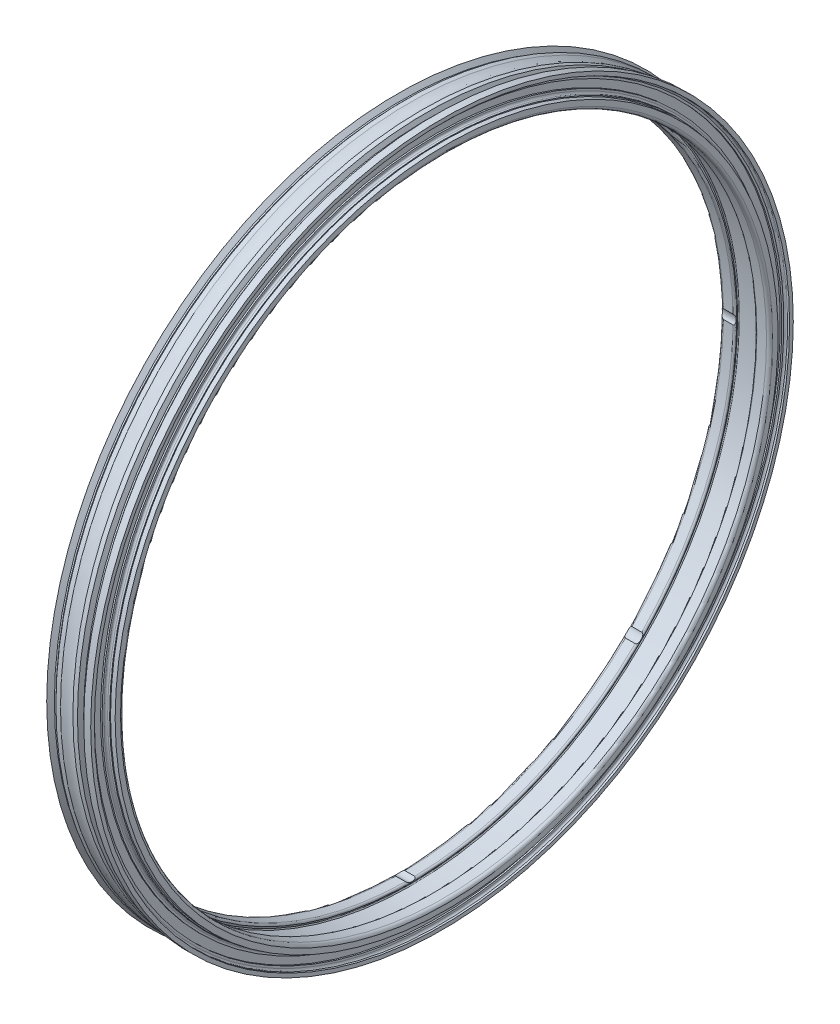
ISO-10303-21;
HEADER;
FILE_DESCRIPTION(('STEP AP214'),'2;1');
FILE_NAME('part.step','',(''),(''),'','','');
FILE_SCHEMA(('AUTOMOTIVE_DESIGN { 1 0 10303 214 1 1 1 1 }'));
ENDSEC;
DATA;
#1=APPLICATION_CONTEXT('core data for automotive mechanical design processes');
#2=APPLICATION_PROTOCOL_DEFINITION('international standard','automotive_design',2000,#1);
#3=PRODUCT_CONTEXT('',#1,'mechanical');
#4=PRODUCT('Part','Part','',(#3));
#5=PRODUCT_RELATED_PRODUCT_CATEGORY('part','',(#4));
#6=PRODUCT_DEFINITION_FORMATION('','',#4);
#7=PRODUCT_DEFINITION_CONTEXT('part definition',#1,'design');
#8=PRODUCT_DEFINITION('design','',#6,#7);
#9=PRODUCT_DEFINITION_SHAPE('','',#8);
#10=(LENGTH_UNIT() NAMED_UNIT(*) SI_UNIT(.MILLI.,.METRE.));
#11=(NAMED_UNIT(*) PLANE_ANGLE_UNIT() SI_UNIT($,.RADIAN.));
#12=(NAMED_UNIT(*) SI_UNIT($,.STERADIAN.) SOLID_ANGLE_UNIT());
#13=UNCERTAINTY_MEASURE_WITH_UNIT(LENGTH_MEASURE(1.E-05),#10,'distance_accuracy_value','');
#14=(GEOMETRIC_REPRESENTATION_CONTEXT(3) GLOBAL_UNCERTAINTY_ASSIGNED_CONTEXT((#13)) GLOBAL_UNIT_ASSIGNED_CONTEXT((#10,
#11,#12)) REPRESENTATION_CONTEXT('',''));
#15=CARTESIAN_POINT('',(0.,0.,0.));
#16=DIRECTION('',(0.,0.,1.));
#17=DIRECTION('',(1.,0.,0.));
#18=AXIS2_PLACEMENT_3D('',#15,#16,#17);
#19=CARTESIAN_POINT('',(19.0000000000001,0.,0.));
#20=DIRECTION('',(-1.,0.,0.));
#21=DIRECTION('',(0.,0.,1.));
#22=AXIS2_PLACEMENT_3D('',#19,#20,#21);
#23=CONICAL_SURFACE('',#22,227.,1.03388558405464);
#24=CARTESIAN_POINT('',(19.,0.,0.));
#25=DIRECTION('',(-1.,0.,0.));
#26=DIRECTION('',(0.,0.,1.));
#27=AXIS2_PLACEMENT_3D('',#24,#25,#26);
#28=CIRCLE('',#27,227.);
#29=CARTESIAN_POINT('',(18.9999999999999,0.,227.));
#30=VERTEX_POINT('',#29);
#31=EDGE_CURVE('E1486',#30,#30,#28,.T.);
#32=ORIENTED_EDGE('',*,*,#31,.F.);
#33=EDGE_LOOP('',(#32));
#34=FACE_BOUND('',#33,.T.);
#35=CARTESIAN_POINT('',(20.5,0.,0.));
#36=DIRECTION('',(-1.,0.,0.));
#37=DIRECTION('',(0.,0.,1.));
#38=AXIS2_PLACEMENT_3D('',#35,#36,#37);
#39=CIRCLE('',#38,224.48);
#40=CARTESIAN_POINT('',(20.4999999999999,0.,224.48));
#41=VERTEX_POINT('',#40);
#42=EDGE_CURVE('E1487',#41,#41,#39,.F.);
#43=ORIENTED_EDGE('',*,*,#42,.F.);
#44=EDGE_LOOP('',(#43));
#45=FACE_BOUND('',#44,.T.);
#46=ADVANCED_FACE('F16',(#34,#45),#23,.T.);
#47=CARTESIAN_POINT('',(35.325,0.,0.));
#48=DIRECTION('',(-1.,0.,0.));
#49=DIRECTION('',(0.,0.,1.));
#50=AXIS2_PLACEMENT_3D('',#47,#48,#49);
#51=CYLINDRICAL_SURFACE('',#50,227.);
#52=ORIENTED_EDGE('',*,*,#31,.T.);
#53=EDGE_LOOP('',(#52));
#54=FACE_BOUND('',#53,.T.);
#55=CARTESIAN_POINT('',(16.0295781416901,0.,0.));
#56=DIRECTION('',(-1.,0.,0.));
#57=DIRECTION('',(0.,1.,0.));
#58=AXIS2_PLACEMENT_3D('',#55,#56,#57);
#59=CIRCLE('',#58,227.);
#60=CARTESIAN_POINT('',(16.0295781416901,227.,0.));
#61=VERTEX_POINT('',#60);
#62=EDGE_CURVE('E1488',#61,#61,#59,.F.);
#63=ORIENTED_EDGE('',*,*,#62,.T.);
#64=EDGE_LOOP('',(#63));
#65=FACE_BOUND('',#64,.T.);
#66=ADVANCED_FACE('F311',(#54,#65),#51,.T.);
#67=CARTESIAN_POINT('',(35.325,0.,0.));
#68=DIRECTION('',(-1.,0.,0.));
#69=DIRECTION('',(0.,0.,1.));
#70=AXIS2_PLACEMENT_3D('',#67,#68,#69);
#71=CYLINDRICAL_SURFACE('',#70,224.48);
#72=ORIENTED_EDGE('',*,*,#42,.T.);
#73=EDGE_LOOP('',(#72));
#74=FACE_BOUND('',#73,.T.);
#75=CARTESIAN_POINT('',(21.4999999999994,0.,0.));
#76=DIRECTION('',(1.,0.,0.));
#77=DIRECTION('',(0.,0.,-1.));
#78=AXIS2_PLACEMENT_3D('',#75,#76,#77);
#79=CIRCLE('',#78,224.48);
#80=CARTESIAN_POINT('',(21.4999999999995,0.,-224.48));
#81=VERTEX_POINT('',#80);
#82=EDGE_CURVE('E297',#81,#81,#79,.T.);
#83=ORIENTED_EDGE('',*,*,#82,.F.);
#84=EDGE_LOOP('',(#83));
#85=FACE_BOUND('',#84,.T.);
#86=ADVANCED_FACE('F307',(#74,#85),#71,.T.);
#87=CARTESIAN_POINT('',(12.,0.,0.));
#88=DIRECTION('',(-1.,0.,0.));
#89=DIRECTION('',(0.,1.,0.));
#90=AXIS2_PLACEMENT_3D('',#87,#88,#89);
#91=TOROIDAL_SURFACE('',#90,237.45,11.2);
#92=ORIENTED_EDGE('',*,*,#62,.F.);
#93=EDGE_LOOP('',(#92));
#94=FACE_BOUND('',#93,.T.);
#95=CARTESIAN_POINT('',(7.970421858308,0.,0.));
#96=DIRECTION('',(-1.,0.,0.));
#97=DIRECTION('',(0.,0.,1.));
#98=AXIS2_PLACEMENT_3D('',#95,#96,#97);
#99=CIRCLE('',#98,227.);
#100=CARTESIAN_POINT('',(7.97042185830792,0.,227.));
#101=VERTEX_POINT('',#100);
#102=EDGE_CURVE('E293',#101,#101,#99,.T.);
#103=ORIENTED_EDGE('',*,*,#102,.F.);
#104=EDGE_LOOP('',(#103));
#105=FACE_BOUND('',#104,.T.);
#106=ADVANCED_FACE('F302',(#94,#105),#91,.F.);
#107=CARTESIAN_POINT('',(24.4999999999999,0.,0.));
#108=DIRECTION('',(1.,0.,0.));
#109=DIRECTION('',(0.,0.,-1.));
#110=AXIS2_PLACEMENT_3D('',#107,#108,#109);
#111=CONICAL_SURFACE('',#110,228.399999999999,0.917571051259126);
#112=CARTESIAN_POINT('',(24.5,0.,0.));
#113=DIRECTION('',(-1.,0.,0.));
#114=DIRECTION('',(0.,0.,1.));
#115=AXIS2_PLACEMENT_3D('',#112,#113,#114);
#116=CIRCLE('',#115,228.4);
#117=CARTESIAN_POINT('',(24.4999999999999,0.,228.4));
#118=VERTEX_POINT('',#117);
#119=EDGE_CURVE('E290',#118,#118,#116,.F.);
#120=ORIENTED_EDGE('',*,*,#119,.F.);
#121=EDGE_LOOP('',(#120));
#122=FACE_BOUND('',#121,.T.);
#123=ORIENTED_EDGE('',*,*,#82,.T.);
#124=EDGE_LOOP('',(#123));
#125=FACE_BOUND('',#124,.T.);
#126=ADVANCED_FACE('F306',(#122,#125),#111,.T.);
#127=CARTESIAN_POINT('',(35.325,0.,0.));
#128=DIRECTION('',(-1.,0.,0.));
#129=DIRECTION('',(0.,0.,1.));
#130=AXIS2_PLACEMENT_3D('',#127,#128,#129);
#131=CYLINDRICAL_SURFACE('',#130,227.);
#132=ORIENTED_EDGE('',*,*,#102,.T.);
#133=EDGE_LOOP('',(#132));
#134=FACE_BOUND('',#133,.T.);
#135=CARTESIAN_POINT('',(4.99999999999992,0.,0.));
#136=DIRECTION('',(1.,0.,0.));
#137=DIRECTION('',(0.,0.,-1.));
#138=AXIS2_PLACEMENT_3D('',#135,#136,#137);
#139=CIRCLE('',#138,227.);
#140=CARTESIAN_POINT('',(5.00000000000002,0.,-227.));
#141=VERTEX_POINT('',#140);
#142=EDGE_CURVE('E286',#141,#141,#139,.F.);
#143=ORIENTED_EDGE('',*,*,#142,.F.);
#144=EDGE_LOOP('',(#143));
#145=FACE_BOUND('',#144,.T.);
#146=ADVANCED_FACE('F1012',(#134,#145),#131,.T.);
#147=CARTESIAN_POINT('',(35.325,0.,0.));
#148=DIRECTION('',(-1.,0.,0.));
#149=DIRECTION('',(0.,0.,1.));
#150=AXIS2_PLACEMENT_3D('',#147,#148,#149);
#151=CYLINDRICAL_SURFACE('',#150,228.4);
#152=ORIENTED_EDGE('',*,*,#119,.T.);
#153=EDGE_LOOP('',(#152));
#154=FACE_BOUND('',#153,.T.);
#155=CARTESIAN_POINT('',(29.0000000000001,0.,0.));
#156=DIRECTION('',(-1.,0.,0.));
#157=DIRECTION('',(0.,0.,1.));
#158=AXIS2_PLACEMENT_3D('',#155,#156,#157);
#159=CIRCLE('',#158,228.4);
#160=CARTESIAN_POINT('',(29.0000000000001,0.,228.4));
#161=VERTEX_POINT('',#160);
#162=EDGE_CURVE('E285',#161,#161,#159,.T.);
#163=ORIENTED_EDGE('',*,*,#162,.T.);
#164=EDGE_LOOP('',(#163));
#165=FACE_BOUND('',#164,.T.);
#166=ADVANCED_FACE('F1004',(#154,#165),#151,.T.);
#167=CARTESIAN_POINT('',(4.99999999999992,0.,0.));
#168=DIRECTION('',(1.,0.,0.));
#169=DIRECTION('',(0.,0.,-1.));
#170=AXIS2_PLACEMENT_3D('',#167,#168,#169);
#171=CONICAL_SURFACE('',#170,227.,0.7853981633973);
#172=CARTESIAN_POINT('',(3.5,0.,0.));
#173=DIRECTION('',(-1.,0.,0.));
#174=DIRECTION('',(0.,0.,1.));
#175=AXIS2_PLACEMENT_3D('',#172,#173,#174);
#176=CIRCLE('',#175,225.5);
#177=CARTESIAN_POINT('',(3.49999999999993,0.,225.5));
#178=VERTEX_POINT('',#177);
#179=EDGE_CURVE('E281',#178,#178,#176,.T.);
#180=ORIENTED_EDGE('',*,*,#179,.F.);
#181=EDGE_LOOP('',(#180));
#182=FACE_BOUND('',#181,.T.);
#183=ORIENTED_EDGE('',*,*,#142,.T.);
#184=EDGE_LOOP('',(#183));
#185=FACE_BOUND('',#184,.T.);
#186=ADVANCED_FACE('F996',(#182,#185),#171,.T.);
#187=CARTESIAN_POINT('',(29.,0.,0.));
#188=DIRECTION('',(-1.,0.,0.));
#189=DIRECTION('',(0.,0.,1.));
#190=AXIS2_PLACEMENT_3D('',#187,#188,#189);
#191=PLANE('',#190);
#192=ORIENTED_EDGE('',*,*,#162,.F.);
#193=EDGE_LOOP('',(#192));
#194=FACE_BOUND('',#193,.T.);
#195=CARTESIAN_POINT('',(29.,0.,0.));
#196=DIRECTION('',(-1.,0.,0.));
#197=DIRECTION('',(0.,0.,1.));
#198=AXIS2_PLACEMENT_3D('',#195,#196,#197);
#199=CIRCLE('',#198,226.);
#200=CARTESIAN_POINT('',(28.9999999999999,0.,226.));
#201=VERTEX_POINT('',#200);
#202=EDGE_CURVE('E280',#201,#201,#199,.T.);
#203=ORIENTED_EDGE('',*,*,#202,.T.);
#204=EDGE_LOOP('',(#203));
#205=FACE_BOUND('',#204,.T.);
#206=ADVANCED_FACE('F988',(#194,#205),#191,.F.);
#207=CARTESIAN_POINT('',(35.325,0.,0.));
#208=DIRECTION('',(-1.,0.,0.));
#209=DIRECTION('',(0.,0.,1.));
#210=AXIS2_PLACEMENT_3D('',#207,#208,#209);
#211=CYLINDRICAL_SURFACE('',#210,225.5);
#212=ORIENTED_EDGE('',*,*,#179,.T.);
#213=EDGE_LOOP('',(#212));
#214=FACE_BOUND('',#213,.T.);
#215=CARTESIAN_POINT('',(2.50000000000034,0.,0.));
#216=DIRECTION('',(-1.,0.,0.));
#217=DIRECTION('',(0.,0.,1.));
#218=AXIS2_PLACEMENT_3D('',#215,#216,#217);
#219=CIRCLE('',#218,225.5);
#220=CARTESIAN_POINT('',(2.50000000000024,0.,225.5));
#221=VERTEX_POINT('',#220);
#222=EDGE_CURVE('E276',#221,#221,#219,.T.);
#223=ORIENTED_EDGE('',*,*,#222,.F.);
#224=EDGE_LOOP('',(#223));
#225=FACE_BOUND('',#224,.T.);
#226=ADVANCED_FACE('F981',(#214,#225),#211,.T.);
#227=CARTESIAN_POINT('',(35.325,0.,0.));
#228=DIRECTION('',(-1.,0.,0.));
#229=DIRECTION('',(0.,0.,1.));
#230=AXIS2_PLACEMENT_3D('',#227,#228,#229);
#231=CYLINDRICAL_SURFACE('',#230,226.);
#232=CARTESIAN_POINT('',(27.7,0.,0.));
#233=DIRECTION('',(-1.,0.,0.));
#234=DIRECTION('',(0.,1.,0.));
#235=AXIS2_PLACEMENT_3D('',#232,#233,#234);
#236=CIRCLE('',#235,226.);
#237=CARTESIAN_POINT('',(27.7,226.,-3.34844844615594E-13));
#238=VERTEX_POINT('',#237);
#239=EDGE_CURVE('E268',#238,#238,#236,.T.);
#240=ORIENTED_EDGE('',*,*,#239,.T.);
#241=EDGE_LOOP('',(#240));
#242=FACE_BOUND('',#241,.T.);
#243=ORIENTED_EDGE('',*,*,#202,.F.);
#244=EDGE_LOOP('',(#243));
#245=FACE_BOUND('',#244,.T.);
#246=ADVANCED_FACE('F974',(#242,#245),#231,.F.);
#247=CARTESIAN_POINT('',(-2.34187669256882E-13,0.,0.));
#248=DIRECTION('',(-1.,0.,0.));
#249=DIRECTION('',(0.,0.,1.));
#250=AXIS2_PLACEMENT_3D('',#247,#248,#249);
#251=CONICAL_SURFACE('',#250,228.,0.785398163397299);
#252=ORIENTED_EDGE('',*,*,#222,.T.);
#253=EDGE_LOOP('',(#252));
#254=FACE_BOUND('',#253,.T.);
#255=CARTESIAN_POINT('',(-2.22044604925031E-13,0.,0.));
#256=DIRECTION('',(-1.,0.,0.));
#257=DIRECTION('',(0.,0.,1.));
#258=AXIS2_PLACEMENT_3D('',#255,#256,#257);
#259=CIRCLE('',#258,228.);
#260=CARTESIAN_POINT('',(-2.97983859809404E-13,0.,228.));
#261=VERTEX_POINT('',#260);
#262=EDGE_CURVE('E234',#261,#261,#259,.F.);
#263=ORIENTED_EDGE('',*,*,#262,.T.);
#264=EDGE_LOOP('',(#263));
#265=FACE_BOUND('',#264,.T.);
#266=ADVANCED_FACE('F254',(#254,#265),#251,.T.);
#267=CARTESIAN_POINT('',(27.7,0.,0.));
#268=DIRECTION('',(-1.,0.,0.));
#269=DIRECTION('',(0.,1.,0.));
#270=AXIS2_PLACEMENT_3D('',#267,#268,#269);
#271=TOROIDAL_SURFACE('',#270,224.8,1.2);
#272=ORIENTED_EDGE('',*,*,#239,.F.);
#273=EDGE_LOOP('',(#272));
#274=FACE_BOUND('',#273,.T.);
#275=CARTESIAN_POINT('',(26.5,0.,0.));
#276=DIRECTION('',(-1.,0.,0.));
#277=DIRECTION('',(0.,1.,0.));
#278=AXIS2_PLACEMENT_3D('',#275,#276,#277);
#279=CIRCLE('',#278,224.8);
#280=CARTESIAN_POINT('',(26.5,224.8,-3.33306715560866E-13));
#281=VERTEX_POINT('',#280);
#282=CARTESIAN_POINT('',(26.5,-224.8,0.));
#283=VERTEX_POINT('',#282);
#284=EDGE_CURVE('E223',#281,#283,#279,.T.);
#285=ORIENTED_EDGE('',*,*,#284,.T.);
#286=CARTESIAN_POINT('',(26.5,0.,0.));
#287=DIRECTION('',(-1.,0.,0.));
#288=DIRECTION('',(0.,-1.,0.));
#289=AXIS2_PLACEMENT_3D('',#286,#287,#288);
#290=CIRCLE('',#289,224.8);
#291=EDGE_CURVE('E220',#283,#281,#290,.T.);
#292=ORIENTED_EDGE('',*,*,#291,.T.);
#293=EDGE_LOOP('',(#285,#292));
#294=FACE_BOUND('',#293,.T.);
#295=ADVANCED_FACE('F233',(#274,#294),#271,.F.);
#296=CARTESIAN_POINT('',(0.,0.,0.));
#297=DIRECTION('',(1.,0.,0.));
#298=DIRECTION('',(0.,0.,-1.));
#299=AXIS2_PLACEMENT_3D('',#296,#297,#298);
#300=PLANE('',#299);
#301=ORIENTED_EDGE('',*,*,#262,.F.);
#302=EDGE_LOOP('',(#301));
#303=FACE_BOUND('',#302,.T.);
#304=CARTESIAN_POINT('',(0.,0.,0.));
#305=DIRECTION('',(1.,0.,0.));
#306=DIRECTION('',(0.,0.999999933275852,0.000365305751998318));
#307=AXIS2_PLACEMENT_3D('',#304,#305,#306);
#308=CIRCLE('',#307,223.232050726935);
#309=CARTESIAN_POINT('',(0.,-223.232035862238,-0.0815479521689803));
#310=VERTEX_POINT('',#309);
#311=CARTESIAN_POINT('',(0.,-223.232050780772,-1.26264377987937E-13));
#312=VERTEX_POINT('',#311);
#313=EDGE_CURVE('E822',#310,#312,#308,.F.);
#314=ORIENTED_EDGE('',*,*,#313,.F.);
#315=CARTESIAN_POINT('',(0.,0.,0.));
#316=DIRECTION('',(-1.,0.,0.));
#317=DIRECTION('',(0.,1.,0.));
#318=AXIS2_PLACEMENT_3D('',#315,#316,#317);
#319=CIRCLE('',#318,223.23205080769);
#320=CARTESIAN_POINT('',(0.,223.232050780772,-2.67802454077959E-13));
#321=VERTEX_POINT('',#320);
#322=EDGE_CURVE('E229',#321,#310,#319,.T.);
#323=ORIENTED_EDGE('',*,*,#322,.F.);
#324=CARTESIAN_POINT('',(0.,0.,0.));
#325=DIRECTION('',(1.,0.,0.));
#326=DIRECTION('',(0.,0.999999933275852,0.000365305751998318));
#327=AXIS2_PLACEMENT_3D('',#324,#325,#326);
#328=CIRCLE('',#327,223.232050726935);
#329=CARTESIAN_POINT('',(0.,223.232035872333,0.0815479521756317));
#330=VERTEX_POINT('',#329);
#331=EDGE_CURVE('E825',#330,#321,#328,.F.);
#332=ORIENTED_EDGE('',*,*,#331,.F.);
#333=CARTESIAN_POINT('',(0.,0.,0.));
#334=DIRECTION('',(-1.,0.,0.));
#335=DIRECTION('',(0.,-1.,0.));
#336=AXIS2_PLACEMENT_3D('',#333,#334,#335);
#337=CIRCLE('',#336,223.23205080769);
#338=EDGE_CURVE('E829',#312,#330,#337,.T.);
#339=ORIENTED_EDGE('',*,*,#338,.F.);
#340=EDGE_LOOP('',(#314,#323,#332,#339));
#341=FACE_BOUND('',#340,.T.);
#342=ADVANCED_FACE('F253',(#303,#341),#300,.F.);
#343=CARTESIAN_POINT('',(26.5,0.,0.));
#344=DIRECTION('',(-1.,0.,0.));
#345=DIRECTION('',(0.,0.,1.));
#346=AXIS2_PLACEMENT_3D('',#343,#344,#345);
#347=PLANE('',#346);
#348=ORIENTED_EDGE('',*,*,#291,.F.);
#349=ORIENTED_EDGE('',*,*,#284,.F.);
#350=EDGE_LOOP('',(#348,#349));
#351=FACE_BOUND('',#350,.T.);
#352=CARTESIAN_POINT('',(26.5000000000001,0.,0.));
#353=DIRECTION('',(-1.,0.,0.));
#354=DIRECTION('',(0.,0.,1.));
#355=AXIS2_PLACEMENT_3D('',#352,#353,#354);
#356=CIRCLE('',#355,223.5);
#357=CARTESIAN_POINT('',(26.5000000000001,0.,223.5));
#358=VERTEX_POINT('',#357);
#359=EDGE_CURVE('E831',#358,#358,#356,.T.);
#360=ORIENTED_EDGE('',*,*,#359,.T.);
#361=EDGE_LOOP('',(#360));
#362=FACE_BOUND('',#361,.T.);
#363=ADVANCED_FACE('F225',(#351,#362),#347,.F.);
#364=CARTESIAN_POINT('',(1.,0.,0.));
#365=DIRECTION('',(1.,0.,0.));
#366=DIRECTION('',(0.,0.999999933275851,0.000365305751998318));
#367=AXIS2_PLACEMENT_3D('',#364,#365,#366);
#368=TOROIDAL_SURFACE('',#367,223.2320508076,1.);
#369=ORIENTED_EDGE('',*,*,#322,.T.);
#370=ORIENTED_EDGE('',*,*,#313,.T.);
#371=ORIENTED_EDGE('',*,*,#338,.T.);
#372=ORIENTED_EDGE('',*,*,#331,.T.);
#373=EDGE_LOOP('',(#369,#370,#371,#372));
#374=FACE_BOUND('',#373,.T.);
#375=CARTESIAN_POINT('',(1.50000000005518,0.,0.));
#376=DIRECTION('',(1.,0.,0.));
#377=DIRECTION('',(0.,0.,-1.));
#378=AXIS2_PLACEMENT_3D('',#375,#376,#377);
#379=CIRCLE('',#378,222.366025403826);
#380=CARTESIAN_POINT('',(1.50000000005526,0.,-222.366025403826));
#381=VERTEX_POINT('',#380);
#382=EDGE_CURVE('E854',#381,#381,#379,.T.);
#383=ORIENTED_EDGE('',*,*,#382,.T.);
#384=EDGE_LOOP('',(#383));
#385=FACE_BOUND('',#384,.T.);
#386=ADVANCED_FACE('F820',(#374,#385),#368,.T.);
#387=CARTESIAN_POINT('',(35.325,0.,0.));
#388=DIRECTION('',(-1.,0.,0.));
#389=DIRECTION('',(0.,0.,1.));
#390=AXIS2_PLACEMENT_3D('',#387,#388,#389);
#391=CYLINDRICAL_SURFACE('',#390,223.5);
#392=ORIENTED_EDGE('',*,*,#359,.F.);
#393=EDGE_LOOP('',(#392));
#394=FACE_BOUND('',#393,.T.);
#395=CARTESIAN_POINT('',(25.5,0.,0.));
#396=DIRECTION('',(-1.,0.,0.));
#397=DIRECTION('',(0.,0.,1.));
#398=AXIS2_PLACEMENT_3D('',#395,#396,#397);
#399=CIRCLE('',#398,223.5);
#400=CARTESIAN_POINT('',(25.4999999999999,0.,223.5));
#401=VERTEX_POINT('',#400);
#402=EDGE_CURVE('E857',#401,#401,#399,.T.);
#403=ORIENTED_EDGE('',*,*,#402,.T.);
#404=EDGE_LOOP('',(#403));
#405=FACE_BOUND('',#404,.T.);
#406=ADVANCED_FACE('F847',(#394,#405),#391,.F.);
#407=CARTESIAN_POINT('',(2.24999999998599,0.,0.));
#408=DIRECTION('',(1.,0.,0.));
#409=DIRECTION('',(0.,0.,-1.));
#410=AXIS2_PLACEMENT_3D('',#407,#408,#409);
#411=CONICAL_SURFACE('',#410,222.799038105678,0.523598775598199);
#412=CARTESIAN_POINT('',(2.24999999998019,0.,0.));
#413=DIRECTION('',(1.,0.,0.));
#414=DIRECTION('',(0.,-0.999999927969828,0.000379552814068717));
#415=AXIS2_PLACEMENT_3D('',#412,#413,#414);
#416=CIRCLE('',#415,222.799038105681);
#417=CARTESIAN_POINT('',(2.24999999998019,-222.799022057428,0.0845640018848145));
#418=VERTEX_POINT('',#417);
#419=EDGE_CURVE('E853',#418,#418,#416,.T.);
#420=ORIENTED_EDGE('',*,*,#419,.T.);
#421=EDGE_LOOP('',(#420));
#422=FACE_BOUND('',#421,.T.);
#423=ORIENTED_EDGE('',*,*,#382,.F.);
#424=EDGE_LOOP('',(#423));
#425=FACE_BOUND('',#424,.T.);
#426=ADVANCED_FACE('F932',(#422,#425),#411,.F.);
#427=CARTESIAN_POINT('',(25.5,0.,0.));
#428=DIRECTION('',(-1.,0.,0.));
#429=DIRECTION('',(0.,0.,1.));
#430=AXIS2_PLACEMENT_3D('',#427,#428,#429);
#431=PLANE('',#430);
#432=ORIENTED_EDGE('',*,*,#402,.F.);
#433=EDGE_LOOP('',(#432));
#434=FACE_BOUND('',#433,.T.);
#435=CARTESIAN_POINT('',(25.5,0.,0.));
#436=DIRECTION('',(-1.,0.,0.));
#437=DIRECTION('',(0.,0.,1.));
#438=AXIS2_PLACEMENT_3D('',#435,#436,#437);
#439=CIRCLE('',#438,218.5);
#440=CARTESIAN_POINT('',(25.4999999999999,0.,218.5));
#441=VERTEX_POINT('',#440);
#442=EDGE_CURVE('E925',#441,#441,#439,.F.);
#443=ORIENTED_EDGE('',*,*,#442,.F.);
#444=EDGE_LOOP('',(#443));
#445=FACE_BOUND('',#444,.T.);
#446=ADVANCED_FACE('F935',(#434,#445),#431,.F.);
#447=CARTESIAN_POINT('',(35.325,0.,0.));
#448=DIRECTION('',(-1.,0.,0.));
#449=DIRECTION('',(0.,0.,1.));
#450=AXIS2_PLACEMENT_3D('',#447,#448,#449);
#451=CYLINDRICAL_SURFACE('',#450,218.5);
#452=ORIENTED_EDGE('',*,*,#442,.T.);
#453=EDGE_LOOP('',(#452));
#454=FACE_BOUND('',#453,.T.);
#455=CARTESIAN_POINT('',(26.5000000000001,0.,0.));
#456=DIRECTION('',(-1.,0.,0.));
#457=DIRECTION('',(0.,0.,1.));
#458=AXIS2_PLACEMENT_3D('',#455,#456,#457);
#459=CIRCLE('',#458,218.5);
#460=CARTESIAN_POINT('',(26.5000000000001,0.,218.5));
#461=VERTEX_POINT('',#460);
#462=EDGE_CURVE('E751',#461,#461,#459,.T.);
#463=ORIENTED_EDGE('',*,*,#462,.T.);
#464=EDGE_LOOP('',(#463));
#465=FACE_BOUND('',#464,.T.);
#466=ADVANCED_FACE('F802',(#454,#465),#451,.T.);
#467=CARTESIAN_POINT('',(2.5,0.,0.));
#468=DIRECTION('',(1.,0.,0.));
#469=DIRECTION('',(0.,-0.999999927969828,0.000379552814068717));
#470=AXIS2_PLACEMENT_3D('',#467,#468,#469);
#471=TOROIDAL_SURFACE('',#470,222.3660254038,0.5);
#472=ORIENTED_EDGE('',*,*,#419,.F.);
#473=EDGE_LOOP('',(#472));
#474=FACE_BOUND('',#473,.T.);
#475=CARTESIAN_POINT('',(3.,0.,0.));
#476=DIRECTION('',(1.,0.,0.));
#477=DIRECTION('',(0.,1.,0.));
#478=AXIS2_PLACEMENT_3D('',#475,#476,#477);
#479=CIRCLE('',#478,222.366025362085);
#480=CARTESIAN_POINT('',(3.,222.366025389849,-3.78906071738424E-13));
#481=VERTEX_POINT('',#480);
#482=CARTESIAN_POINT('',(3.,-222.366009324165,0.0843996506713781));
#483=VERTEX_POINT('',#482);
#484=EDGE_CURVE('E738',#481,#483,#479,.T.);
#485=ORIENTED_EDGE('',*,*,#484,.T.);
#486=DIRECTION('',(0.,-0.000190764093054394,-0.99999998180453));
#487=VECTOR('',#486,1.);
#488=CARTESIAN_POINT('',(3.,-222.366009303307,0.0843996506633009));
#489=LINE('',#488,#487);
#490=CARTESIAN_POINT('',(3.,-222.366025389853,0.));
#491=VERTEX_POINT('',#490);
#492=EDGE_CURVE('E741',#483,#491,#489,.T.);
#493=ORIENTED_EDGE('',*,*,#492,.T.);
#494=CARTESIAN_POINT('',(3.,0.,0.));
#495=DIRECTION('',(1.,0.,0.));
#496=DIRECTION('',(0.,-1.,0.));
#497=AXIS2_PLACEMENT_3D('',#494,#495,#496);
#498=CIRCLE('',#497,222.366025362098);
#499=CARTESIAN_POINT('',(3.,222.3660093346,-0.0843996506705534));
#500=VERTEX_POINT('',#499);
#501=EDGE_CURVE('E728',#491,#500,#498,.T.);
#502=ORIENTED_EDGE('',*,*,#501,.T.);
#503=DIRECTION('',(0.,0.000190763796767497,0.999999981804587));
#504=VECTOR('',#503,1.);
#505=CARTESIAN_POINT('',(3.,222.366009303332,-0.0843996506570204));
#506=LINE('',#505,#504);
#507=EDGE_CURVE('E740',#500,#481,#506,.T.);
#508=ORIENTED_EDGE('',*,*,#507,.T.);
#509=EDGE_LOOP('',(#485,#493,#502,#508));
#510=FACE_BOUND('',#509,.T.);
#511=ADVANCED_FACE('F745',(#474,#510),#471,.F.);
#512=CARTESIAN_POINT('',(26.5,0.,0.));
#513=DIRECTION('',(-1.,0.,0.));
#514=DIRECTION('',(0.,0.,1.));
#515=AXIS2_PLACEMENT_3D('',#512,#513,#514);
#516=PLANE('',#515);
#517=ORIENTED_EDGE('',*,*,#462,.F.);
#518=EDGE_LOOP('',(#517));
#519=FACE_BOUND('',#518,.T.);
#520=CARTESIAN_POINT('',(26.5,0.,0.));
#521=DIRECTION('',(1.,0.,0.));
#522=DIRECTION('',(0.,-1.,0.));
#523=AXIS2_PLACEMENT_3D('',#520,#521,#522);
#524=CIRCLE('',#523,217.3);
#525=CARTESIAN_POINT('',(26.5,217.3,-3.33306715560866E-13));
#526=VERTEX_POINT('',#525);
#527=CARTESIAN_POINT('',(26.5,-217.3,0.));
#528=VERTEX_POINT('',#527);
#529=EDGE_CURVE('E744',#526,#528,#524,.F.);
#530=ORIENTED_EDGE('',*,*,#529,.T.);
#531=CARTESIAN_POINT('',(26.5,0.,0.));
#532=DIRECTION('',(1.,0.,0.));
#533=DIRECTION('',(0.,1.,0.));
#534=AXIS2_PLACEMENT_3D('',#531,#532,#533);
#535=CIRCLE('',#534,217.3);
#536=EDGE_CURVE('E686',#528,#526,#535,.F.);
#537=ORIENTED_EDGE('',*,*,#536,.T.);
#538=EDGE_LOOP('',(#530,#537));
#539=FACE_BOUND('',#538,.T.);
#540=ADVANCED_FACE('F706',(#519,#539),#516,.F.);
#541=CARTESIAN_POINT('',(3.,0.,0.));
#542=DIRECTION('',(1.,0.,0.));
#543=DIRECTION('',(0.,0.,-1.));
#544=AXIS2_PLACEMENT_3D('',#541,#542,#543);
#545=PLANE('',#544);
#546=ORIENTED_EDGE('',*,*,#507,.F.);
#547=ORIENTED_EDGE('',*,*,#501,.F.);
#548=ORIENTED_EDGE('',*,*,#492,.F.);
#549=ORIENTED_EDGE('',*,*,#484,.F.);
#550=EDGE_LOOP('',(#546,#547,#548,#549));
#551=FACE_BOUND('',#550,.T.);
#552=CARTESIAN_POINT('',(2.99999999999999,0.,0.));
#553=DIRECTION('',(1.,0.,0.));
#554=DIRECTION('',(0.,-0.999999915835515,0.000410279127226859));
#555=AXIS2_PLACEMENT_3D('',#552,#553,#554);
#556=CIRCLE('',#555,215.633974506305);
#557=CARTESIAN_POINT('',(3.,-215.633956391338,0.088470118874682));
#558=VERTEX_POINT('',#557);
#559=CARTESIAN_POINT('',(3.,-215.633974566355,0.));
#560=VERTEX_POINT('',#559);
#561=EDGE_CURVE('E757',#558,#560,#556,.T.);
#562=ORIENTED_EDGE('',*,*,#561,.T.);
#563=CARTESIAN_POINT('',(3.,0.,0.));
#564=DIRECTION('',(-1.,0.,0.));
#565=DIRECTION('',(0.,0.999999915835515,-0.000410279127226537));
#566=AXIS2_PLACEMENT_3D('',#563,#564,#565);
#567=CIRCLE('',#566,215.63397459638);
#568=CARTESIAN_POINT('',(3.,215.633956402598,-0.0884701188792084));
#569=VERTEX_POINT('',#568);
#570=EDGE_CURVE('E681',#560,#569,#567,.F.);
#571=ORIENTED_EDGE('',*,*,#570,.T.);
#572=CARTESIAN_POINT('',(2.99999999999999,0.,0.));
#573=DIRECTION('',(1.,0.,0.));
#574=DIRECTION('',(0.,-0.999999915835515,0.000410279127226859));
#575=AXIS2_PLACEMENT_3D('',#572,#573,#574);
#576=CIRCLE('',#575,215.633974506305);
#577=CARTESIAN_POINT('',(3.,215.633974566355,-3.71239858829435E-13));
#578=VERTEX_POINT('',#577);
#579=EDGE_CURVE('E684',#569,#578,#576,.T.);
#580=ORIENTED_EDGE('',*,*,#579,.T.);
#581=CARTESIAN_POINT('',(3.,0.,0.));
#582=DIRECTION('',(-1.,0.,0.));
#583=DIRECTION('',(0.,-0.999999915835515,0.000410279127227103));
#584=AXIS2_PLACEMENT_3D('',#581,#582,#583);
#585=CIRCLE('',#584,215.63397459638);
#586=EDGE_CURVE('E649',#578,#558,#585,.F.);
#587=ORIENTED_EDGE('',*,*,#586,.T.);
#588=EDGE_LOOP('',(#562,#571,#580,#587));
#589=FACE_BOUND('',#588,.T.);
#590=ADVANCED_FACE('F697',(#551,#589),#545,.F.);
#591=CARTESIAN_POINT('',(27.7,0.,0.));
#592=DIRECTION('',(-1.,0.,0.));
#593=DIRECTION('',(0.,1.,0.));
#594=AXIS2_PLACEMENT_3D('',#591,#592,#593);
#595=TOROIDAL_SURFACE('',#594,217.3,1.2);
#596=CARTESIAN_POINT('',(27.7,0.,0.));
#597=DIRECTION('',(-1.,0.,0.));
#598=DIRECTION('',(0.,0.,1.));
#599=AXIS2_PLACEMENT_3D('',#596,#597,#598);
#600=CIRCLE('',#599,216.1);
#601=CARTESIAN_POINT('',(27.6999999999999,0.,216.1));
#602=VERTEX_POINT('',#601);
#603=EDGE_CURVE('E679',#602,#602,#600,.F.);
#604=ORIENTED_EDGE('',*,*,#603,.F.);
#605=EDGE_LOOP('',(#604));
#606=FACE_BOUND('',#605,.T.);
#607=ORIENTED_EDGE('',*,*,#529,.F.);
#608=ORIENTED_EDGE('',*,*,#536,.F.);
#609=EDGE_LOOP('',(#607,#608));
#610=FACE_BOUND('',#609,.T.);
#611=ADVANCED_FACE('F668',(#606,#610),#595,.F.);
#612=CARTESIAN_POINT('',(2.5,0.,0.));
#613=DIRECTION('',(1.,0.,0.));
#614=DIRECTION('',(0.,-0.999999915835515,0.000410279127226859));
#615=AXIS2_PLACEMENT_3D('',#612,#613,#614);
#616=TOROIDAL_SURFACE('',#615,215.6339745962,0.5);
#617=ORIENTED_EDGE('',*,*,#561,.F.);
#618=ORIENTED_EDGE('',*,*,#586,.F.);
#619=ORIENTED_EDGE('',*,*,#579,.F.);
#620=ORIENTED_EDGE('',*,*,#570,.F.);
#621=EDGE_LOOP('',(#617,#618,#619,#620));
#622=FACE_BOUND('',#621,.T.);
#623=CARTESIAN_POINT('',(2.24999999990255,0.,0.));
#624=DIRECTION('',(-1.,0.,0.));
#625=DIRECTION('',(0.,0.,1.));
#626=AXIS2_PLACEMENT_3D('',#623,#624,#625);
#627=CIRCLE('',#626,215.200961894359);
#628=CARTESIAN_POINT('',(2.24999999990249,0.,215.200961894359));
#629=VERTEX_POINT('',#628);
#630=EDGE_CURVE('E678',#629,#629,#627,.T.);
#631=ORIENTED_EDGE('',*,*,#630,.F.);
#632=EDGE_LOOP('',(#631));
#633=FACE_BOUND('',#632,.T.);
#634=ADVANCED_FACE('F656',(#622,#633),#616,.F.);
#635=CARTESIAN_POINT('',(35.325,0.,0.));
#636=DIRECTION('',(-1.,0.,0.));
#637=DIRECTION('',(0.,0.,1.));
#638=AXIS2_PLACEMENT_3D('',#635,#636,#637);
#639=CYLINDRICAL_SURFACE('',#638,216.1);
#640=ORIENTED_EDGE('',*,*,#603,.T.);
#641=EDGE_LOOP('',(#640));
#642=FACE_BOUND('',#641,.T.);
#643=CARTESIAN_POINT('',(29.0000000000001,0.,0.));
#644=DIRECTION('',(-1.,0.,0.));
#645=DIRECTION('',(0.,0.,1.));
#646=AXIS2_PLACEMENT_3D('',#643,#644,#645);
#647=CIRCLE('',#646,216.1);
#648=CARTESIAN_POINT('',(29.0000000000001,0.,216.1));
#649=VERTEX_POINT('',#648);
#650=EDGE_CURVE('E920',#649,#649,#647,.T.);
#651=ORIENTED_EDGE('',*,*,#650,.T.);
#652=EDGE_LOOP('',(#651));
#653=FACE_BOUND('',#652,.T.);
#654=ADVANCED_FACE('F667',(#642,#653),#639,.T.);
#655=CARTESIAN_POINT('',(1.50000000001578,0.,0.));
#656=DIRECTION('',(-1.,0.,0.));
#657=DIRECTION('',(0.,0.,1.));
#658=AXIS2_PLACEMENT_3D('',#655,#656,#657);
#659=CONICAL_SURFACE('',#658,215.633974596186,0.523598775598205);
#660=CARTESIAN_POINT('',(1.50000000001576,0.,0.));
#661=DIRECTION('',(1.,0.,0.));
#662=DIRECTION('',(0.,0.999999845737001,0.000555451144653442));
#663=AXIS2_PLACEMENT_3D('',#660,#661,#662);
#664=CIRCLE('',#663,215.633974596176);
#665=CARTESIAN_POINT('',(1.50000000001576,215.633941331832,0.119774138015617));
#666=VERTEX_POINT('',#665);
#667=EDGE_CURVE('E919',#666,#666,#664,.F.);
#668=ORIENTED_EDGE('',*,*,#667,.F.);
#669=EDGE_LOOP('',(#668));
#670=FACE_BOUND('',#669,.T.);
#671=ORIENTED_EDGE('',*,*,#630,.T.);
#672=EDGE_LOOP('',(#671));
#673=FACE_BOUND('',#672,.T.);
#674=ADVANCED_FACE('F1136',(#670,#673),#659,.T.);
#675=CARTESIAN_POINT('',(29.,0.,0.));
#676=DIRECTION('',(-1.,0.,0.));
#677=DIRECTION('',(0.,0.,1.));
#678=AXIS2_PLACEMENT_3D('',#675,#676,#677);
#679=PLANE('',#678);
#680=ORIENTED_EDGE('',*,*,#650,.F.);
#681=EDGE_LOOP('',(#680));
#682=FACE_BOUND('',#681,.T.);
#683=CARTESIAN_POINT('',(29.,0.,0.));
#684=DIRECTION('',(-1.,0.,0.));
#685=DIRECTION('',(0.,0.,1.));
#686=AXIS2_PLACEMENT_3D('',#683,#684,#685);
#687=CIRCLE('',#686,215.5);
#688=CARTESIAN_POINT('',(28.9999999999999,0.,215.5));
#689=VERTEX_POINT('',#688);
#690=EDGE_CURVE('E914',#689,#689,#687,.F.);
#691=ORIENTED_EDGE('',*,*,#690,.F.);
#692=EDGE_LOOP('',(#691));
#693=FACE_BOUND('',#692,.T.);
#694=ADVANCED_FACE('F1144',(#682,#693),#679,.F.);
#695=CARTESIAN_POINT('',(35.325,0.,0.));
#696=DIRECTION('',(-1.,0.,0.));
#697=DIRECTION('',(0.,0.,1.));
#698=AXIS2_PLACEMENT_3D('',#695,#696,#697);
#699=CYLINDRICAL_SURFACE('',#698,215.5);
#700=ORIENTED_EDGE('',*,*,#690,.T.);
#701=EDGE_LOOP('',(#700));
#702=FACE_BOUND('',#701,.T.);
#703=CARTESIAN_POINT('',(32.0000000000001,0.,0.));
#704=DIRECTION('',(-1.,0.,0.));
#705=DIRECTION('',(0.,0.,1.));
#706=AXIS2_PLACEMENT_3D('',#703,#704,#705);
#707=CIRCLE('',#706,215.5);
#708=CARTESIAN_POINT('',(32.0000000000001,0.,215.5));
#709=VERTEX_POINT('',#708);
#710=EDGE_CURVE('E572',#709,#709,#707,.F.);
#711=ORIENTED_EDGE('',*,*,#710,.F.);
#712=EDGE_LOOP('',(#711));
#713=FACE_BOUND('',#712,.T.);
#714=ADVANCED_FACE('F629',(#702,#713),#699,.T.);
#715=CARTESIAN_POINT('',(1.,0.,0.));
#716=DIRECTION('',(1.,0.,0.));
#717=DIRECTION('',(0.,0.999999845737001,0.000555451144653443));
#718=AXIS2_PLACEMENT_3D('',#715,#716,#717);
#719=TOROIDAL_SURFACE('',#718,214.7679491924,1.);
#720=ORIENTED_EDGE('',*,*,#667,.T.);
#721=EDGE_LOOP('',(#720));
#722=FACE_BOUND('',#721,.T.);
#723=DIRECTION('',(0.,0.000277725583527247,-0.999999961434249));
#724=VECTOR('',#723,1.);
#725=CARTESIAN_POINT('',(0.,-214.7679491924,-1.13231364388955E-13));
#726=LINE('',#725,#724);
#727=CARTESIAN_POINT('',(0.,-214.767949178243,-1.12675710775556E-13));
#728=VERTEX_POINT('',#727);
#729=CARTESIAN_POINT('',(0.,-214.767916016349,-0.11929310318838));
#730=VERTEX_POINT('',#729);
#731=EDGE_CURVE('E560',#728,#730,#726,.T.);
#732=ORIENTED_EDGE('',*,*,#731,.T.);
#733=CARTESIAN_POINT('',(0.,0.,0.));
#734=DIRECTION('',(1.,0.,0.));
#735=DIRECTION('',(0.,-0.999999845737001,-0.00055545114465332));
#736=AXIS2_PLACEMENT_3D('',#733,#734,#735);
#737=CIRCLE('',#736,214.767949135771);
#738=CARTESIAN_POINT('',(0.,214.767949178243,-2.76972997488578E-13));
#739=VERTEX_POINT('',#738);
#740=EDGE_CURVE('E559',#730,#739,#737,.T.);
#741=ORIENTED_EDGE('',*,*,#740,.T.);
#742=DIRECTION('',(0.,-0.000277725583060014,0.99999996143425));
#743=VECTOR('',#742,1.);
#744=CARTESIAN_POINT('',(0.,214.7679491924,-2.95282461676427E-13));
#745=LINE('',#744,#743);
#746=CARTESIAN_POINT('',(0.,214.767916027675,0.119293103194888));
#747=VERTEX_POINT('',#746);
#748=EDGE_CURVE('E561',#739,#747,#745,.T.);
#749=ORIENTED_EDGE('',*,*,#748,.T.);
#750=CARTESIAN_POINT('',(0.,0.,0.));
#751=DIRECTION('',(1.,0.,0.));
#752=DIRECTION('',(0.,0.999999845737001,0.000555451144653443));
#753=AXIS2_PLACEMENT_3D('',#750,#751,#752);
#754=CIRCLE('',#753,214.767949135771);
#755=EDGE_CURVE('E549',#747,#728,#754,.T.);
#756=ORIENTED_EDGE('',*,*,#755,.T.);
#757=EDGE_LOOP('',(#732,#741,#749,#756));
#758=FACE_BOUND('',#757,.T.);
#759=ADVANCED_FACE('F625',(#722,#758),#719,.T.);
#760=CARTESIAN_POINT('',(32.,0.,0.));
#761=DIRECTION('',(1.,0.,0.));
#762=DIRECTION('',(0.,0.,-1.));
#763=AXIS2_PLACEMENT_3D('',#760,#761,#762);
#764=PLANE('',#763);
#765=ORIENTED_EDGE('',*,*,#710,.T.);
#766=EDGE_LOOP('',(#765));
#767=FACE_BOUND('',#766,.T.);
#768=DIRECTION('',(0.,-0.00028546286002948,0.999999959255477));
#769=VECTOR('',#768,1.);
#770=CARTESIAN_POINT('',(32.,211.99999999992,-1.10182045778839E-13));
#771=LINE('',#770,#769);
#772=CARTESIAN_POINT('',(32.,211.999999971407,-1.10392109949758E-13));
#773=VERTEX_POINT('',#772);
#774=CARTESIAN_POINT('',(32.,211.99996540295,0.121036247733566));
#775=VERTEX_POINT('',#774);
#776=EDGE_CURVE('E570',#773,#775,#771,.T.);
#777=ORIENTED_EDGE('',*,*,#776,.F.);
#778=CARTESIAN_POINT('',(32.,0.,0.));
#779=DIRECTION('',(1.,0.,0.));
#780=DIRECTION('',(0.,-0.999999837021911,-0.000570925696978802));
#781=AXIS2_PLACEMENT_3D('',#778,#779,#780);
#782=CIRCLE('',#781,211.999999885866);
#783=CARTESIAN_POINT('',(32.,-211.999965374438,-0.121036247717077));
#784=VERTEX_POINT('',#783);
#785=EDGE_CURVE('E565',#784,#773,#782,.T.);
#786=ORIENTED_EDGE('',*,*,#785,.F.);
#787=DIRECTION('',(0.,0.000286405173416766,-0.999999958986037));
#788=VECTOR('',#787,1.);
#789=CARTESIAN_POINT('',(32.,-211.99999999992,-3.33094012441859E-13));
#790=LINE('',#789,#788);
#791=CARTESIAN_POINT('',(32.,-211.99999998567,-3.12067266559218E-13));
#792=VERTEX_POINT('',#791);
#793=EDGE_CURVE('E575',#784,#792,#790,.F.);
#794=ORIENTED_EDGE('',*,*,#793,.T.);
#795=CARTESIAN_POINT('',(32.,0.,0.));
#796=DIRECTION('',(1.,0.,0.));
#797=DIRECTION('',(0.,0.999999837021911,0.000570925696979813));
#798=AXIS2_PLACEMENT_3D('',#795,#796,#797);
#799=CIRCLE('',#798,211.999999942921);
#800=EDGE_CURVE('E507',#775,#792,#799,.T.);
#801=ORIENTED_EDGE('',*,*,#800,.F.);
#802=EDGE_LOOP('',(#777,#786,#794,#801));
#803=FACE_BOUND('',#802,.T.);
#804=ADVANCED_FACE('F526',(#767,#803),#764,.T.);
#805=CARTESIAN_POINT('',(0.,0.,0.));
#806=DIRECTION('',(1.,0.,0.));
#807=DIRECTION('',(0.,0.,-1.));
#808=AXIS2_PLACEMENT_3D('',#805,#806,#807);
#809=PLANE('',#808);
#810=ORIENTED_EDGE('',*,*,#740,.F.);
#811=ORIENTED_EDGE('',*,*,#731,.F.);
#812=ORIENTED_EDGE('',*,*,#755,.F.);
#813=ORIENTED_EDGE('',*,*,#748,.F.);
#814=EDGE_LOOP('',(#810,#811,#812,#813));
#815=FACE_BOUND('',#814,.T.);
#816=CARTESIAN_POINT('',(0.,0.,0.));
#817=DIRECTION('',(1.,0.,0.));
#818=DIRECTION('',(0.,0.999999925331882,0.000386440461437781));
#819=AXIS2_PLACEMENT_3D('',#816,#817,#818);
#820=CIRCLE('',#819,211.9999999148);
#821=CARTESIAN_POINT('',(0.,-211.999984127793,-0.0819253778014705));
#822=VERTEX_POINT('',#821);
#823=CARTESIAN_POINT('',(0.,-211.99999997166,-1.10173010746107E-13));
#824=VERTEX_POINT('',#823);
#825=EDGE_CURVE('E503',#822,#824,#820,.F.);
#826=ORIENTED_EDGE('',*,*,#825,.F.);
#827=CARTESIAN_POINT('',(0.,0.,0.));
#828=DIRECTION('',(-1.,0.,0.));
#829=DIRECTION('',(0.,1.,0.));
#830=AXIS2_PLACEMENT_3D('',#827,#828,#829);
#831=CIRCLE('',#830,212.00000000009);
#832=CARTESIAN_POINT('',(0.,212.00000000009,-1.40675231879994E-13));
#833=VERTEX_POINT('',#832);
#834=EDGE_CURVE('E512',#833,#822,#831,.T.);
#835=ORIENTED_EDGE('',*,*,#834,.F.);
#836=DIRECTION('',(0.,0.000194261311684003,-0.999999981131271));
#837=VECTOR('',#836,1.);
#838=CARTESIAN_POINT('',(0.,211.999984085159,0.0819253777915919));
#839=LINE('',#838,#837);
#840=CARTESIAN_POINT('',(0.,211.999984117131,0.0819253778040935));
#841=VERTEX_POINT('',#840);
#842=EDGE_CURVE('E145',#841,#833,#839,.T.);
#843=ORIENTED_EDGE('',*,*,#842,.F.);
#844=CARTESIAN_POINT('',(0.,0.,0.));
#845=DIRECTION('',(-1.,0.,0.));
#846=DIRECTION('',(0.,-1.,0.));
#847=AXIS2_PLACEMENT_3D('',#844,#845,#846);
#848=CIRCLE('',#847,212.00000000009);
#849=EDGE_CURVE('E506',#824,#841,#848,.T.);
#850=ORIENTED_EDGE('',*,*,#849,.F.);
#851=EDGE_LOOP('',(#826,#835,#843,#850));
#852=FACE_BOUND('',#851,.T.);
#853=ADVANCED_FACE('F517',(#815,#852),#809,.F.);
#854=CARTESIAN_POINT('',(30.,0.,0.));
#855=DIRECTION('',(1.,0.,0.));
#856=DIRECTION('',(0.,0.999999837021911,0.000570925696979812));
#857=AXIS2_PLACEMENT_3D('',#854,#855,#856);
#858=TOROIDAL_SURFACE('',#857,212.,2.);
#859=CARTESIAN_POINT('',(30.,0.,0.));
#860=DIRECTION('',(1.,0.,0.));
#861=DIRECTION('',(0.,0.,-1.));
#862=AXIS2_PLACEMENT_3D('',#859,#860,#861);
#863=CIRCLE('',#862,210.);
#864=CARTESIAN_POINT('',(30.0000000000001,0.,-210.));
#865=VERTEX_POINT('',#864);
#866=EDGE_CURVE('E19',#865,#865,#863,.F.);
#867=ORIENTED_EDGE('',*,*,#866,.T.);
#868=EDGE_LOOP('',(#867));
#869=FACE_BOUND('',#868,.T.);
#870=ORIENTED_EDGE('',*,*,#800,.T.);
#871=ORIENTED_EDGE('',*,*,#793,.F.);
#872=ORIENTED_EDGE('',*,*,#785,.T.);
#873=ORIENTED_EDGE('',*,*,#776,.T.);
#874=EDGE_LOOP('',(#870,#871,#872,#873));
#875=FACE_BOUND('',#874,.T.);
#876=ADVANCED_FACE('F465',(#869,#875),#858,.T.);
#877=CARTESIAN_POINT('',(2.,0.,0.));
#878=DIRECTION('',(1.,0.,0.));
#879=DIRECTION('',(0.,0.999999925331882,0.000386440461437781));
#880=AXIS2_PLACEMENT_3D('',#877,#878,#879);
#881=TOROIDAL_SURFACE('',#880,212.,2.);
#882=CARTESIAN_POINT('',(2.00000000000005,-209.978155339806,3.02890740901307));
#883=CARTESIAN_POINT('',(1.96199724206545,-209.978145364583,3.0289137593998));
#884=CARTESIAN_POINT('',(1.92400021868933,-209.97925922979,3.02745740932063));
#885=CARTESIAN_POINT('',(1.84837465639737,-209.983659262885,3.02166889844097));
#886=CARTESIAN_POINT('',(1.81074591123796,-209.986944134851,3.01733845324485));
#887=CARTESIAN_POINT('',(1.73645012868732,-209.995578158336,3.00589472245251));
#888=CARTESIAN_POINT('',(1.69977796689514,-210.000911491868,2.99880275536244));
#889=CARTESIAN_POINT('',(1.62740349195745,-210.013501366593,2.98193185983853));
#890=CARTESIAN_POINT('',(1.59170126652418,-210.020758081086,2.97215268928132));
#891=CARTESIAN_POINT('',(1.48658827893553,-210.04513334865,2.93898813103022));
#892=CARTESIAN_POINT('',(1.41895390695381,-210.064883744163,2.91174152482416));
#893=CARTESIAN_POINT('',(1.29002862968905,-210.109708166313,2.84812367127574));
#894=CARTESIAN_POINT('',(1.22874892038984,-210.134791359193,2.81173669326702));
#895=CARTESIAN_POINT('',(1.09619166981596,-210.196393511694,2.71922637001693));
#896=CARTESIAN_POINT('',(1.02732221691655,-210.234099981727,2.6604490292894));
#897=CARTESIAN_POINT('',(0.90152438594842,-210.311803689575,2.53257806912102));
#898=CARTESIAN_POINT('',(0.844614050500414,-210.35180427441,2.46346912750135));
#899=CARTESIAN_POINT('',(0.75630225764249,-210.420061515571,2.33808330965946));
#900=CARTESIAN_POINT('',(0.722237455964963,-210.448441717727,2.2837010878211));
#901=CARTESIAN_POINT('',(0.659179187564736,-210.504239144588,2.1715772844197));
#902=CARTESIAN_POINT('',(0.630187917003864,-210.531655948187,2.11383426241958));
#903=CARTESIAN_POINT('',(0.57669480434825,-210.584993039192,1.99551012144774));
#904=CARTESIAN_POINT('',(0.552201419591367,-210.610910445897,1.93492391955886));
#905=CARTESIAN_POINT('',(0.507223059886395,-210.660786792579,1.8114917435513));
#906=CARTESIAN_POINT('',(0.486739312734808,-210.684745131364,1.74864508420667));
#907=CARTESIAN_POINT('',(0.44020199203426,-210.741460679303,1.59017423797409));
#908=CARTESIAN_POINT('',(0.416264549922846,-210.772850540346,1.49343449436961));
#909=CARTESIAN_POINT('',(0.374744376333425,-210.829950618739,1.2969436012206));
#910=CARTESIAN_POINT('',(0.357165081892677,-210.855657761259,1.19719085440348));
#911=CARTESIAN_POINT('',(0.327300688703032,-210.900957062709,0.995630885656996));
#912=CARTESIAN_POINT('',(0.315011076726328,-210.920554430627,0.893825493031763));
#913=CARTESIAN_POINT('',(0.294914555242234,-210.953414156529,0.688812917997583));
#914=CARTESIAN_POINT('',(0.287105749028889,-210.966679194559,0.585606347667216));
#915=CARTESIAN_POINT('',(0.276014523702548,-210.98577057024,0.388481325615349));
#916=CARTESIAN_POINT('',(0.272364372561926,-210.992197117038,0.294640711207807));
#917=CARTESIAN_POINT('',(0.268086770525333,-210.999747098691,0.106670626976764));
#918=CARTESIAN_POINT('',(0.267459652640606,-211.0008699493,0.0125411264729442));
#919=CARTESIAN_POINT('',(0.269410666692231,-210.997406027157,-0.199782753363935));
#920=CARTESIAN_POINT('',(0.272853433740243,-210.991278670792,-0.317948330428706));
#921=CARTESIAN_POINT('',(0.284750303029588,-210.970689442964,-0.553367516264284));
#922=CARTESIAN_POINT('',(0.293207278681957,-210.956222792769,-0.670620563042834));
#923=CARTESIAN_POINT('',(0.315873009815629,-210.919128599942,-0.903366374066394));
#924=CARTESIAN_POINT('',(0.330086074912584,-210.896494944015,-1.01885775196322));
#925=CARTESIAN_POINT('',(0.365438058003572,-210.843435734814,-1.24692034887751));
#926=CARTESIAN_POINT('',(0.386572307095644,-210.813015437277,-1.35949348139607));
#927=CARTESIAN_POINT('',(0.42741547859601,-210.758440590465,-1.53693305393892));
#928=CARTESIAN_POINT('',(0.444408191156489,-210.736536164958,-1.60312862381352));
#929=CARTESIAN_POINT('',(0.482017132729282,-210.690344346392,-1.7336248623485));
#930=CARTESIAN_POINT('',(0.502632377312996,-210.666057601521,-1.79792604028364));
#931=CARTESIAN_POINT('',(0.547973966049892,-210.615449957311,-1.92411875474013));
#932=CARTESIAN_POINT('',(0.572693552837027,-210.589132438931,-1.98601404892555));
#933=CARTESIAN_POINT('',(0.626824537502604,-210.534878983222,-2.1069574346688));
#934=CARTESIAN_POINT('',(0.656234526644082,-210.50694353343,-2.16600637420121));
#935=CARTESIAN_POINT('',(0.735307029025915,-210.436740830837,-2.3074012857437));
#936=CARTESIAN_POINT('',(0.788022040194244,-210.39385905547,-2.38778695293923));
#937=CARTESIAN_POINT('',(0.906536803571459,-210.308516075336,-2.53853694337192));
#938=CARTESIAN_POINT('',(0.972316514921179,-210.266054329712,-2.60891633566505));
#939=CARTESIAN_POINT('',(1.10121981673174,-210.194571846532,-2.7219453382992));
#940=CARTESIAN_POINT('',(1.16151736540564,-210.164696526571,-2.76725678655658));
#941=CARTESIAN_POINT('',(1.2901668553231,-210.109600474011,-2.84843632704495));
#942=CARTESIAN_POINT('',(1.35851890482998,-210.084379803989,-2.88430429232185));
#943=CARTESIAN_POINT('',(1.50283446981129,-210.04066527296,-2.94524483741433));
#944=CARTESIAN_POINT('',(1.57886283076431,-210.022236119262,-2.97021397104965));
#945=CARTESIAN_POINT('',(1.69618663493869,-210.001407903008,-2.99814312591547));
#946=CARTESIAN_POINT('',(1.73581687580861,-209.995602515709,-3.00586365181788));
#947=CARTESIAN_POINT('',(1.81584018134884,-209.986404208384,-3.01805273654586));
#948=CARTESIAN_POINT('',(1.85623258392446,-209.983009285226,-3.0225239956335));
#949=CARTESIAN_POINT('',(1.91395997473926,-209.979967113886,-3.02652659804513));
#950=CARTESIAN_POINT('',(1.93116136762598,-209.979287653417,-3.02741975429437));
#951=CARTESIAN_POINT('',(1.96557409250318,-209.978382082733,-3.02860966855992));
#952=CARTESIAN_POINT('',(1.98278538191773,-209.978155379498,-3.02890720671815));
#953=CARTESIAN_POINT('',(2.,-209.978155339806,-3.02890740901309));
#954=B_SPLINE_CURVE_WITH_KNOTS('',3,(#882,#883,#884,#885,#886,#887,#888,#889,#890,#891,#892,
#893,#894,#895,#896,#897,#898,#899,#900,#901,#902,#903,#904,#905,#906,#907,#908,#909,#910,#911,
#912,#913,#914,#915,#916,#917,#918,#919,#920,#921,#922,#923,#924,#925,#926,#927,#928,#929,#930,
#931,#932,#933,#934,#935,#936,#937,#938,#939,#940,#941,#942,#943,#944,#945,#946,#947,#948,#949,
#950,#951,#952,#953),.UNSPECIFIED.,.F.,.F.,(4,2,2,2,2,2,2,2,2,2,2,2,2,2,2,2,2,2,2,2,2,2,2,2,2,2,
2,2,2,2,2,2,2,2,2,4),(0.,0.113954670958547,0.227841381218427,0.340865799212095,
0.453900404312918,0.679314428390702,0.905119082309,1.19774785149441,1.49081498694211,
1.70104162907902,1.9113590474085,2.12206796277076,2.33284129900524,2.64582802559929,
2.95898369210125,3.2718716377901,3.58462704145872,3.86682193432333,4.14904791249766,
4.50376319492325,4.85868194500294,5.2138669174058,5.56881278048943,5.78398009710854,
5.9990890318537,6.21384726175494,6.42854111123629,6.74324094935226,7.0574617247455,
7.29990072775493,7.54234298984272,7.78703884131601,7.90924133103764,8.03134214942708,
8.08304307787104,8.13467624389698),.UNSPECIFIED.);
#955=CARTESIAN_POINT('',(2.00000000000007,-209.978155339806,3.02890740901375));
#956=VERTEX_POINT('',#955);
#957=CARTESIAN_POINT('',(2.,-209.978155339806,-3.02890740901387));
#958=VERTEX_POINT('',#957);
#959=EDGE_CURVE('E452',#956,#958,#954,.T.);
#960=ORIENTED_EDGE('',*,*,#959,.T.);
#961=CARTESIAN_POINT('',(2.,0.,0.));
#962=DIRECTION('',(1.,0.,0.));
#963=DIRECTION('',(0.,0.,-1.));
#964=AXIS2_PLACEMENT_3D('',#961,#962,#963);
#965=CIRCLE('',#964,210.);
#966=CARTESIAN_POINT('',(2.00000000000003,-150.61873851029,-146.335216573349));
#967=VERTEX_POINT('',#966);
#968=EDGE_CURVE('E487',#958,#967,#965,.T.);
#969=ORIENTED_EDGE('',*,*,#968,.T.);
#970=CARTESIAN_POINT('',(2.,-150.618738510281,-146.335216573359));
#971=CARTESIAN_POINT('',(1.96199756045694,-150.61873594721,-146.335205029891));
#972=CARTESIAN_POINT('',(1.92400085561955,-150.618493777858,-146.337022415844));
#973=CARTESIAN_POINT('',(1.84837592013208,-150.617511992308,-146.344226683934));
#974=CARTESIAN_POINT('',(1.81074748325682,-150.616772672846,-146.349611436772));
#975=CARTESIAN_POINT('',(1.73645167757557,-150.614785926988,-146.363808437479));
#976=CARTESIAN_POINT('',(1.69977919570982,-150.613542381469,-146.372594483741));
#977=CARTESIAN_POINT('',(1.62740409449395,-150.61051522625,-146.393426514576));
#978=CARTESIAN_POINT('',(1.59170156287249,-150.608731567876,-146.405472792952));
#979=CARTESIAN_POINT('',(1.48658750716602,-150.60251653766,-146.446160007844));
#980=CARTESIAN_POINT('',(1.41895241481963,-150.597215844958,-146.479392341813));
#981=CARTESIAN_POINT('',(1.29002727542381,-150.583926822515,-146.556072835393));
#982=CARTESIAN_POINT('',(1.22874828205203,-150.575933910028,-146.59953837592));
#983=CARTESIAN_POINT('',(1.09619477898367,-150.554079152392,-146.708509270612));
#984=CARTESIAN_POINT('',(1.02732794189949,-150.539180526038,-146.776730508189));
#985=CARTESIAN_POINT('',(0.901529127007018,-150.503707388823,-146.922093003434));
#986=CARTESIAN_POINT('',(0.844616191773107,-150.48312394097,-146.999248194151));
#987=CARTESIAN_POINT('',(0.756295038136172,-150.442723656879,-147.136189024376));
#988=CARTESIAN_POINT('',(0.722224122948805,-150.424333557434,-147.194722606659));
#989=CARTESIAN_POINT('',(0.659155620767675,-150.38449588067,-147.313484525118));
#990=CARTESIAN_POINT('',(0.630160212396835,-150.363046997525,-147.373713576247));
#991=CARTESIAN_POINT('',(0.576670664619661,-150.317091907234,-147.495096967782));
#992=CARTESIAN_POINT('',(0.552183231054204,-150.292581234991,-147.556252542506));
#993=CARTESIAN_POINT('',(0.50721512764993,-150.24057831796,-147.678776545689));
#994=CARTESIAN_POINT('',(0.486735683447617,-150.213085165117,-147.740145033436));
#995=CARTESIAN_POINT('',(0.440226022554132,-150.141176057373,-147.892214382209));
#996=CARTESIAN_POINT('',(0.416305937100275,-150.095009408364,-147.982737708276));
#997=CARTESIAN_POINT('',(0.374812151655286,-149.996544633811,-148.161895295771));
#998=CARTESIAN_POINT('',(0.357241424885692,-149.944243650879,-148.250528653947));
#999=CARTESIAN_POINT('',(0.327360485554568,-149.833781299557,-148.425079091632));
#1000=CARTESIAN_POINT('',(0.315054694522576,-149.775615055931,-148.51099383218));
#1001=CARTESIAN_POINT('',(0.294931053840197,-149.653787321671,-148.679352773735));
#1002=CARTESIAN_POINT('',(0.287112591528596,-149.590126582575,-148.761797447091));
#1003=CARTESIAN_POINT('',(0.275245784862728,-149.455448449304,-148.92535927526));
#1004=CARTESIAN_POINT('',(0.271330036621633,-149.384257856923,-149.006343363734));
#1005=CARTESIAN_POINT('',(0.267440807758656,-149.23673352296,-149.163593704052));
#1006=CARTESIAN_POINT('',(0.267467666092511,-149.160399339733,-149.239859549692));
#1007=CARTESIAN_POINT('',(0.27146666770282,-149.003016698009,-149.387244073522));
#1008=CARTESIAN_POINT('',(0.275438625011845,-148.921968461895,-149.458362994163));
#1009=CARTESIAN_POINT('',(0.287614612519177,-148.755641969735,-149.595067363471));
#1010=CARTESIAN_POINT('',(0.295818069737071,-148.670364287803,-149.660653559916));
#1011=CARTESIAN_POINT('',(0.315809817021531,-148.50627796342,-149.778657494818));
#1012=CARTESIAN_POINT('',(0.327071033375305,-148.427868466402,-149.8317199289));
#1013=CARTESIAN_POINT('',(0.353968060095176,-148.268687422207,-149.933011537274));
#1014=CARTESIAN_POINT('',(0.369604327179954,-148.187915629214,-149.981240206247));
#1015=CARTESIAN_POINT('',(0.406032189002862,-148.024787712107,-150.072555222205));
#1016=CARTESIAN_POINT('',(0.426816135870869,-147.942434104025,-150.115649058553));
#1017=CARTESIAN_POINT('',(0.474552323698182,-147.776953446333,-150.196534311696));
#1018=CARTESIAN_POINT('',(0.501501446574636,-147.693826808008,-150.234328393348));
#1019=CARTESIAN_POINT('',(0.571048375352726,-147.505558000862,-150.31390982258));
#1020=CARTESIAN_POINT('',(0.615906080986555,-147.400518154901,-150.35402979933));
#1021=CARTESIAN_POINT('',(0.720314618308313,-147.194702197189,-150.42516667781));
#1022=CARTESIAN_POINT('',(0.779844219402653,-147.093920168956,-150.45619659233));
#1023=CARTESIAN_POINT('',(0.900004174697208,-146.924842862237,-150.503011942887));
#1024=CARTESIAN_POINT('',(0.957018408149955,-146.8545150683,-150.520667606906));
#1025=CARTESIAN_POINT('',(1.08178014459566,-146.72282820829,-150.551064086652));
#1026=CARTESIAN_POINT('',(1.1495142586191,-146.66145813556,-150.563810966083));
#1027=CARTESIAN_POINT('',(1.28174326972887,-146.561828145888,-150.582938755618));
#1028=CARTESIAN_POINT('',(1.34448462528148,-146.52139275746,-150.590063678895));
#1029=CARTESIAN_POINT('',(1.47585859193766,-146.451225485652,-150.60176363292));
#1030=CARTESIAN_POINT('',(1.54448154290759,-146.421476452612,-150.606342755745));
#1031=CARTESIAN_POINT('',(1.67700132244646,-146.377490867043,-150.612871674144));
#1032=CARTESIAN_POINT('',(1.74038496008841,-146.361759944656,-150.615082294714));
#1033=CARTESIAN_POINT('',(1.83686484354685,-146.345898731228,-150.61728225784));
#1034=CARTESIAN_POINT('',(1.86934792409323,-146.341900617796,-150.617829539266));
#1035=CARTESIAN_POINT('',(1.93454929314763,-146.336557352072,-150.618557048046));
#1036=CARTESIAN_POINT('',(1.96726767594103,-146.335213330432,-150.618737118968));
#1037=CARTESIAN_POINT('',(1.99999999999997,-146.335216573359,-150.61873851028));
#1038=B_SPLINE_CURVE_WITH_KNOTS('',3,(#970,#971,#972,#973,#974,#975,#976,#977,#978,#979,#980,
#981,#982,#983,#984,#985,#986,#987,#988,#989,#990,#991,#992,#993,#994,#995,#996,#997,#998,#999,
#1000,#1001,#1002,#1003,#1004,#1005,#1006,#1007,#1008,#1009,#1010,#1011,#1012,#1013,#1014,#1015,
#1016,#1017,#1018,#1019,#1020,#1021,#1022,#1023,#1024,#1025,#1026,#1027,#1028,#1029,#1030,#1031,
#1032,#1033,#1034,#1035,#1036,#1037),.UNSPECIFIED.,.F.,.F.,(4,2,2,2,2,2,2,2,2,2,2,2,2,2,2,2,2,2,
2,2,2,2,2,2,2,2,2,2,2,2,2,2,2,4),(0.,0.113953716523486,0.227839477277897,0.340864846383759,
0.453900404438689,0.679316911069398,0.905119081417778,1.19773570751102,1.49081499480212,
1.70108274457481,1.9114405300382,2.12210874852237,2.33284128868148,2.64555763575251,
2.95842022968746,3.27154505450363,3.58462711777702,3.90801662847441,4.23143394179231,
4.55483601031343,4.87819429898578,5.16399310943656,5.44982176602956,5.73522828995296,
6.02049078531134,6.38260647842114,6.74420122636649,7.01995599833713,7.29536903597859,
7.51939615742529,7.7430621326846,7.93820684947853,8.03630699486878,8.13444892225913),.UNSPECIFIED.);
#1039=CARTESIAN_POINT('',(1.99999999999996,-146.335216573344,-150.618738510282));
#1040=VERTEX_POINT('',#1039);
#1041=EDGE_CURVE('E491',#967,#1040,#1038,.T.);
#1042=ORIENTED_EDGE('',*,*,#1041,.T.);
#1043=CARTESIAN_POINT('',(1.99999999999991,0.,0.));
#1044=DIRECTION('',(1.,0.,0.));
#1045=DIRECTION('',(0.,0.,-1.));
#1046=AXIS2_PLACEMENT_3D('',#1043,#1044,#1045);
#1047=CIRCLE('',#1046,210.);
#1048=CARTESIAN_POINT('',(1.99999999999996,-3.02890740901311,-209.978155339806));
#1049=VERTEX_POINT('',#1048);
#1050=EDGE_CURVE('E492',#1040,#1049,#1047,.T.);
#1051=ORIENTED_EDGE('',*,*,#1050,.T.);
#1052=CARTESIAN_POINT('',(1.99999999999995,-3.02890740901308,-209.978155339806));
#1053=CARTESIAN_POINT('',(1.96199756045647,-3.0289137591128,-209.978145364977));
#1054=CARTESIAN_POINT('',(1.92400085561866,-3.02745743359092,-209.979259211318));
#1055=CARTESIAN_POINT('',(1.84837592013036,-3.02166901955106,-209.983659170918));
#1056=CARTESIAN_POINT('',(1.81074748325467,-3.01733864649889,-209.98694398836));
#1057=CARTESIAN_POINT('',(1.73645167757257,-3.00589500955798,-209.995577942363));
#1058=CARTESIAN_POINT('',(1.69977919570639,-2.99880301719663,-210.000911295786));
#1059=CARTESIAN_POINT('',(1.62740409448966,-2.98193202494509,-210.013501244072));
#1060=CARTESIAN_POINT('',(1.59170156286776,-2.97215278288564,-210.020758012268));
#1061=CARTESIAN_POINT('',(1.48658750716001,-2.93898788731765,-210.045133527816));
#1062=CARTESIAN_POINT('',(1.41895241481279,-2.91174092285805,-210.064884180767));
#1063=CARTESIAN_POINT('',(1.2900272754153,-2.84812286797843,-210.109708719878));
#1064=CARTESIAN_POINT('',(1.22874828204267,-2.81173624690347,-210.134791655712));
#1065=CARTESIAN_POINT('',(1.09619477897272,-2.71922854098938,-210.196392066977));
#1066=CARTESIAN_POINT('',(1.02732794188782,-2.66045392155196,-210.234096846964));
#1067=CARTESIAN_POINT('',(0.901529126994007,-2.53258381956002,-210.311800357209));
#1068=CARTESIAN_POINT('',(0.844616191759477,-2.46347216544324,-210.351802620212));
#1069=CARTESIAN_POINT('',(0.756295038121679,-2.33807306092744,-210.420067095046));
#1070=CARTESIAN_POINT('',(0.722224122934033,-2.28367980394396,-210.448452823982));
#1071=CARTESIAN_POINT('',(0.659155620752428,-2.1715329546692,-210.504260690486));
#1072=CARTESIAN_POINT('',(0.630160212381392,-2.11377793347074,-210.531682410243));
#1073=CARTESIAN_POINT('',(0.576670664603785,-1.99545175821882,-210.585018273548));
#1074=CARTESIAN_POINT('',(0.552183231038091,-1.93487657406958,-210.610930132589));
#1075=CARTESIAN_POINT('',(0.50721512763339,-1.81146740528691,-210.660796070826));
#1076=CARTESIAN_POINT('',(0.486735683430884,-1.74863273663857,-210.684749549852));
#1077=CARTESIAN_POINT('',(0.440226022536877,-1.59025605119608,-210.741431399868));
#1078=CARTESIAN_POINT('',(0.416305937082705,-1.49360164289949,-210.772796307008));
#1079=CARTESIAN_POINT('',(0.374812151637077,-1.29729298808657,-210.829854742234));
#1080=CARTESIAN_POINT('',(0.357241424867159,-1.19763735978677,-210.855545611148));
#1081=CARTESIAN_POINT('',(0.327360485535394,-0.996102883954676,-210.90086273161));
#1082=CARTESIAN_POINT('',(0.315054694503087,-0.894222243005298,-210.920483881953));
#1083=CARTESIAN_POINT('',(0.294931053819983,-0.689029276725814,-210.953386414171));
#1084=CARTESIAN_POINT('',(0.287112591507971,-0.585717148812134,-210.966668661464));
#1085=CARTESIAN_POINT('',(0.275245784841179,-0.374829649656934,-210.987092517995));
#1086=CARTESIAN_POINT('',(0.271330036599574,-0.26722590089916,-210.994017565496));
#1087=CARTESIAN_POINT('',(0.267440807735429,-0.0517176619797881,-211.000894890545));
#1088=CARTESIAN_POINT('',(0.267467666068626,0.0561868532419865,-211.000846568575));
#1089=CARTESIAN_POINT('',(0.271466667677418,0.271689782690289,-210.993776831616));
#1090=CARTESIAN_POINT('',(0.275438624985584,0.379288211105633,-210.986755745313));
#1091=CARTESIAN_POINT('',(0.287614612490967,0.59356338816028,-210.965809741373));
#1092=CARTESIAN_POINT('',(0.29581806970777,0.700240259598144,-210.951885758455));
#1093=CARTESIAN_POINT('',(0.315809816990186,0.899708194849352,-210.919300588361));
#1094=CARTESIAN_POINT('',(0.327071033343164,0.992672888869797,-210.901377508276));
#1095=CARTESIAN_POINT('',(0.35396806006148,1.17685486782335,-210.860443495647));
#1096=CARTESIAN_POINT('',(0.369604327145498,1.26807196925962,-210.837432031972));
#1097=CARTESIAN_POINT('',(0.406032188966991,1.44799029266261,-210.786652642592));
#1098=CARTESIAN_POINT('',(0.426816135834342,1.5366950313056,-210.75889179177));
#1099=CARTESIAN_POINT('',(0.474552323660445,1.71090203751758,-210.699073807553));
#1100=CARTESIAN_POINT('',(0.501501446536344,1.79640589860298,-210.66701884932));
#1101=CARTESIAN_POINT('',(0.571048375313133,1.98580461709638,-210.590165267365));
#1102=CARTESIAN_POINT('',(0.615906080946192,2.08844811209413,-210.54425998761));
#1103=CARTESIAN_POINT('',(0.720314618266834,2.28428334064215,-210.449027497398));
#1104=CARTESIAN_POINT('',(0.779844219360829,2.37748845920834,-210.399705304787));
#1105=CARTESIAN_POINT('',(0.90000417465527,2.53014762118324,-210.313253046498));
#1106=CARTESIAN_POINT('',(0.957018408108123,2.59236132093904,-210.276008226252));
#1107=CARTESIAN_POINT('',(1.08178014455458,2.70697154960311,-210.204385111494));
#1108=CARTESIAN_POINT('',(1.14951425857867,2.75938014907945,-210.170003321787));
#1109=CARTESIAN_POINT('',(1.28174326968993,2.84335458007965,-210.113079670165));
#1110=CARTESIAN_POINT('',(1.34448462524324,2.87698479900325,-210.089525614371));
#1111=CARTESIAN_POINT('',(1.47585859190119,2.93487366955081,-210.048182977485));
#1112=CARTESIAN_POINT('',(1.54448154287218,2.95914734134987,-210.030385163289));
#1113=CARTESIAN_POINT('',(1.67700132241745,2.99486648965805,-210.003899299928));
#1114=CARTESIAN_POINT('',(1.74038496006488,3.00755307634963,-209.994339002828));
#1115=CARTESIAN_POINT('',(1.8368648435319,3.02032425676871,-209.984679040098));
#1116=CARTESIAN_POINT('',(1.86934792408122,3.02353833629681,-209.982238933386));
#1117=CARTESIAN_POINT('',(1.93454929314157,3.02783102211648,-209.97897510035));
#1118=CARTESIAN_POINT('',(1.96726767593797,3.02890871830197,-209.978152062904));
#1119=CARTESIAN_POINT('',(1.99999999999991,3.0289074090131,-209.978155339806));
#1120=B_SPLINE_CURVE_WITH_KNOTS('',3,(#1052,#1053,#1054,#1055,#1056,#1057,#1058,#1059,#1060,
#1061,#1062,#1063,#1064,#1065,#1066,#1067,#1068,#1069,#1070,#1071,#1072,#1073,#1074,#1075,#1076,
#1077,#1078,#1079,#1080,#1081,#1082,#1083,#1084,#1085,#1086,#1087,#1088,#1089,#1090,#1091,#1092,
#1093,#1094,#1095,#1096,#1097,#1098,#1099,#1100,#1101,#1102,#1103,#1104,#1105,#1106,#1107,#1108,
#1109,#1110,#1111,#1112,#1113,#1114,#1115,#1116,#1117,#1118,#1119),.UNSPECIFIED.,.F.,.F.,(4,2,2,
2,2,2,2,2,2,2,2,2,2,2,2,2,2,2,2,2,2,2,2,2,2,2,2,2,2,2,2,2,2,4),(0.,0.113953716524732,
0.227839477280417,0.340864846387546,0.453900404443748,0.67931691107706,0.905119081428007,
1.19773570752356,1.49081499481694,1.70108274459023,1.91144053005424,2.12210874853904,
2.33284128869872,2.64555763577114,2.95842022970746,3.27154505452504,3.58462711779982,
3.90801662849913,4.23143394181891,4.55483601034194,4.87819429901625,5.16399310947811,
5.4498217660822,5.73522829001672,6.02049078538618,6.38260647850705,6.74420122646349,
7.01995599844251,7.29536903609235,7.51939615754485,7.74306213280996,7.93820684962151,
8.03630699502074,8.13444892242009),.UNSPECIFIED.);
#1121=CARTESIAN_POINT('',(1.99999999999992,3.02890740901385,-209.978155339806));
#1122=VERTEX_POINT('',#1121);
#1123=EDGE_CURVE('E496',#1049,#1122,#1120,.T.);
#1124=ORIENTED_EDGE('',*,*,#1123,.T.);
#1125=CARTESIAN_POINT('',(1.99999999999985,0.,0.));
#1126=DIRECTION('',(1.,0.,0.));
#1127=DIRECTION('',(0.,0.,-1.));
#1128=AXIS2_PLACEMENT_3D('',#1125,#1126,#1127);
#1129=CIRCLE('',#1128,210.);
#1130=CARTESIAN_POINT('',(1.99999999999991,146.33521657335,-150.618738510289));
#1131=VERTEX_POINT('',#1130);
#1132=EDGE_CURVE('E497',#1122,#1131,#1129,.T.);
#1133=ORIENTED_EDGE('',*,*,#1132,.T.);
#1134=CARTESIAN_POINT('',(1.99999999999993,146.335216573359,-150.61873851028));
#1135=CARTESIAN_POINT('',(1.96199756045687,146.335205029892,-150.61873594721));
#1136=CARTESIAN_POINT('',(1.92400085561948,146.337022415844,-150.618493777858));
#1137=CARTESIAN_POINT('',(1.84837592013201,146.344226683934,-150.617511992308));
#1138=CARTESIAN_POINT('',(1.81074748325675,146.349611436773,-150.616772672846));
#1139=CARTESIAN_POINT('',(1.73645167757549,146.363808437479,-150.614785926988));
#1140=CARTESIAN_POINT('',(1.69977919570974,146.372594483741,-150.613542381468));
#1141=CARTESIAN_POINT('',(1.62740409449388,146.393426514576,-150.61051522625));
#1142=CARTESIAN_POINT('',(1.59170156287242,146.405472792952,-150.608731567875));
#1143=CARTESIAN_POINT('',(1.48658750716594,146.446160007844,-150.60251653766));
#1144=CARTESIAN_POINT('',(1.41895241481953,146.479392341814,-150.597215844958));
#1145=CARTESIAN_POINT('',(1.29002727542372,146.556072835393,-150.583926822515));
#1146=CARTESIAN_POINT('',(1.22874828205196,146.59953837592,-150.575933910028));
#1147=CARTESIAN_POINT('',(1.09619477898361,146.708509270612,-150.554079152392));
#1148=CARTESIAN_POINT('',(1.02732794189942,146.77673050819,-150.539180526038));
#1149=CARTESIAN_POINT('',(0.901529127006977,146.922093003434,-150.503707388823));
#1150=CARTESIAN_POINT('',(0.844616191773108,146.999248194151,-150.483123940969));
#1151=CARTESIAN_POINT('',(0.756295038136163,147.136189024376,-150.442723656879));
#1152=CARTESIAN_POINT('',(0.722224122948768,147.19472260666,-150.424333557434));
#1153=CARTESIAN_POINT('',(0.659155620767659,147.313484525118,-150.38449588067));
#1154=CARTESIAN_POINT('',(0.63016021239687,147.373713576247,-150.363046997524));
#1155=CARTESIAN_POINT('',(0.576670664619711,147.495096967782,-150.317091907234));
#1156=CARTESIAN_POINT('',(0.552183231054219,147.556252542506,-150.292581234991));
#1157=CARTESIAN_POINT('',(0.507215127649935,147.678776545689,-150.24057831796));
#1158=CARTESIAN_POINT('',(0.486735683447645,147.740145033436,-150.213085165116));
#1159=CARTESIAN_POINT('',(0.44022602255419,147.89221438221,-150.141176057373));
#1160=CARTESIAN_POINT('',(0.41630593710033,147.982737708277,-150.095009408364));
#1161=CARTESIAN_POINT('',(0.374812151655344,148.161895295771,-149.996544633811));
#1162=CARTESIAN_POINT('',(0.357241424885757,148.250528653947,-149.944243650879));
#1163=CARTESIAN_POINT('',(0.327360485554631,148.425079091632,-149.833781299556));
#1164=CARTESIAN_POINT('',(0.315054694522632,148.51099383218,-149.775615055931));
#1165=CARTESIAN_POINT('',(0.294931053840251,148.679352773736,-149.653787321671));
#1166=CARTESIAN_POINT('',(0.287112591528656,148.761797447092,-149.590126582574));
#1167=CARTESIAN_POINT('',(0.275245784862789,148.92535927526,-149.455448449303));
#1168=CARTESIAN_POINT('',(0.27133003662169,149.006343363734,-149.384257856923));
#1169=CARTESIAN_POINT('',(0.267440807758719,149.163593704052,-149.236733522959));
#1170=CARTESIAN_POINT('',(0.267467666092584,149.239859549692,-149.160399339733));
#1171=CARTESIAN_POINT('',(0.271466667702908,149.387244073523,-149.003016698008));
#1172=CARTESIAN_POINT('',(0.275438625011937,149.458362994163,-148.921968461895));
#1173=CARTESIAN_POINT('',(0.287614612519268,149.595067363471,-148.755641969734));
#1174=CARTESIAN_POINT('',(0.295818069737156,149.660653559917,-148.670364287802));
#1175=CARTESIAN_POINT('',(0.315809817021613,149.778657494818,-148.50627796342));
#1176=CARTESIAN_POINT('',(0.327071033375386,149.8317199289,-148.427868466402));
#1177=CARTESIAN_POINT('',(0.353968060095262,149.933011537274,-148.268687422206));
#1178=CARTESIAN_POINT('',(0.369604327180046,149.981240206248,-148.187915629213));
#1179=CARTESIAN_POINT('',(0.406032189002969,150.072555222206,-148.024787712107));
#1180=CARTESIAN_POINT('',(0.426816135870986,150.115649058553,-147.942434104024));
#1181=CARTESIAN_POINT('',(0.474552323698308,150.196534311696,-147.776953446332));
#1182=CARTESIAN_POINT('',(0.501501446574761,150.234328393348,-147.693826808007));
#1183=CARTESIAN_POINT('',(0.571048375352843,150.31390982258,-147.505558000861));
#1184=CARTESIAN_POINT('',(0.615906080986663,150.35402979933,-147.400518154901));
#1185=CARTESIAN_POINT('',(0.720314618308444,150.42516667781,-147.194702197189));
#1186=CARTESIAN_POINT('',(0.779844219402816,150.456196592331,-147.093920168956));
#1187=CARTESIAN_POINT('',(0.900004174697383,150.503011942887,-146.924842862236));
#1188=CARTESIAN_POINT('',(0.957018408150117,150.520667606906,-146.854515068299));
#1189=CARTESIAN_POINT('',(1.08178014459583,150.551064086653,-146.72282820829));
#1190=CARTESIAN_POINT('',(1.1495142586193,150.563810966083,-146.66145813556));
#1191=CARTESIAN_POINT('',(1.28174326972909,150.582938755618,-146.561828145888));
#1192=CARTESIAN_POINT('',(1.34448462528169,150.590063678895,-146.52139275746));
#1193=CARTESIAN_POINT('',(1.47585859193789,150.60176363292,-146.451225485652));
#1194=CARTESIAN_POINT('',(1.54448154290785,150.606342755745,-146.421476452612));
#1195=CARTESIAN_POINT('',(1.67700132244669,150.612871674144,-146.377490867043));
#1196=CARTESIAN_POINT('',(1.74038496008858,150.615082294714,-146.361759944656));
#1197=CARTESIAN_POINT('',(1.83686484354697,150.61728225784,-146.345898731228));
#1198=CARTESIAN_POINT('',(1.86934792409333,150.617829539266,-146.341900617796));
#1199=CARTESIAN_POINT('',(1.93454929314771,150.618557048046,-146.336557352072));
#1200=CARTESIAN_POINT('',(1.96726767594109,150.618737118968,-146.335213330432));
#1201=CARTESIAN_POINT('',(2.00000000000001,150.61873851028,-146.335216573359));
#1202=B_SPLINE_CURVE_WITH_KNOTS('',3,(#1134,#1135,#1136,#1137,#1138,#1139,#1140,#1141,#1142,
#1143,#1144,#1145,#1146,#1147,#1148,#1149,#1150,#1151,#1152,#1153,#1154,#1155,#1156,#1157,#1158,
#1159,#1160,#1161,#1162,#1163,#1164,#1165,#1166,#1167,#1168,#1169,#1170,#1171,#1172,#1173,#1174,
#1175,#1176,#1177,#1178,#1179,#1180,#1181,#1182,#1183,#1184,#1185,#1186,#1187,#1188,#1189,#1190,
#1191,#1192,#1193,#1194,#1195,#1196,#1197,#1198,#1199,#1200,#1201),.UNSPECIFIED.,.F.,.F.,(4,2,2,
2,2,2,2,2,2,2,2,2,2,2,2,2,2,2,2,2,2,2,2,2,2,2,2,2,2,2,2,2,2,4),(0.,0.113953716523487,
0.227839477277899,0.340864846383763,0.453900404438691,0.679316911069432,0.90511908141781,
1.19773570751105,1.49081499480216,1.7010827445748,1.91144053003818,2.12210874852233,
2.33284128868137,2.64555763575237,2.95842022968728,3.27154505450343,3.58462711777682,
3.90801662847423,4.23143394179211,4.55483601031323,4.87819429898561,5.16399310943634,
5.4498217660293,5.73522828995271,6.02049078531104,6.38260647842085,6.74420122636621,
7.01995599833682,7.29536903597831,7.51939615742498,7.74306213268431,7.93820684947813,
8.03630699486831,8.13444892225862),.UNSPECIFIED.);
#1203=CARTESIAN_POINT('',(1.99999999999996,150.618738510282,-146.335216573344));
#1204=VERTEX_POINT('',#1203);
#1205=EDGE_CURVE('E130',#1131,#1204,#1202,.T.);
#1206=ORIENTED_EDGE('',*,*,#1205,.T.);
#1207=CARTESIAN_POINT('',(1.99999999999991,0.,0.));
#1208=DIRECTION('',(1.,0.,0.));
#1209=DIRECTION('',(0.,0.,-1.));
#1210=AXIS2_PLACEMENT_3D('',#1207,#1208,#1209);
#1211=CIRCLE('',#1210,210.);
#1212=CARTESIAN_POINT('',(1.99999999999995,209.978155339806,-3.0289074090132));
#1213=VERTEX_POINT('',#1212);
#1214=EDGE_CURVE('E137',#1204,#1213,#1211,.T.);
#1215=ORIENTED_EDGE('',*,*,#1214,.T.);
#1216=CARTESIAN_POINT('',(1.99999999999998,209.978155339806,-3.02890740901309));
#1217=CARTESIAN_POINT('',(1.96199724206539,209.978145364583,-3.02891375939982));
#1218=CARTESIAN_POINT('',(1.92400021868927,209.97925922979,-3.02745740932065));
#1219=CARTESIAN_POINT('',(1.84837465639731,209.983659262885,-3.02166889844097));
#1220=CARTESIAN_POINT('',(1.8107459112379,209.986944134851,-3.01733845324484));
#1221=CARTESIAN_POINT('',(1.73645012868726,209.995578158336,-3.00589472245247));
#1222=CARTESIAN_POINT('',(1.69977796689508,210.000911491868,-2.99880275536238));
#1223=CARTESIAN_POINT('',(1.6274034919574,210.013501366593,-2.9819318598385));
#1224=CARTESIAN_POINT('',(1.59170126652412,210.020758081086,-2.97215268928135));
#1225=CARTESIAN_POINT('',(1.48658827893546,210.04513334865,-2.93898813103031));
#1226=CARTESIAN_POINT('',(1.41895390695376,210.064883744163,-2.91174152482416));
#1227=CARTESIAN_POINT('',(1.29002862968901,210.109708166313,-2.84812367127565));
#1228=CARTESIAN_POINT('',(1.22874892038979,210.134791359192,-2.81173669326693));
#1229=CARTESIAN_POINT('',(1.09619166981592,210.196393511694,-2.71922637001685));
#1230=CARTESIAN_POINT('',(1.02732221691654,210.234099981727,-2.66044902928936));
#1231=CARTESIAN_POINT('',(0.901524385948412,210.311803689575,-2.53257806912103));
#1232=CARTESIAN_POINT('',(0.844614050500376,210.35180427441,-2.46346912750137));
#1233=CARTESIAN_POINT('',(0.756302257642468,210.420061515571,-2.33808330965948));
#1234=CARTESIAN_POINT('',(0.722237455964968,210.448441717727,-2.28370108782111));
#1235=CARTESIAN_POINT('',(0.659179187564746,210.504239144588,-2.17157728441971));
#1236=CARTESIAN_POINT('',(0.630187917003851,210.531655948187,-2.11383426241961));
#1237=CARTESIAN_POINT('',(0.576694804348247,210.584993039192,-1.99551012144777));
#1238=CARTESIAN_POINT('',(0.552201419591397,210.610910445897,-1.93492391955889));
#1239=CARTESIAN_POINT('',(0.507223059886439,210.660786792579,-1.81149174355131));
#1240=CARTESIAN_POINT('',(0.486739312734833,210.684745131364,-1.74864508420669));
#1241=CARTESIAN_POINT('',(0.44020199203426,210.741460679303,-1.59017423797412));
#1242=CARTESIAN_POINT('',(0.41626454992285,210.772850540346,-1.49343449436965));
#1243=CARTESIAN_POINT('',(0.374744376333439,210.829950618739,-1.29694360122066));
#1244=CARTESIAN_POINT('',(0.357165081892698,210.855657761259,-1.19719085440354));
#1245=CARTESIAN_POINT('',(0.327300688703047,210.900957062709,-0.995630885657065));
#1246=CARTESIAN_POINT('',(0.315011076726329,210.920554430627,-0.893825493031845));
#1247=CARTESIAN_POINT('',(0.294914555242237,210.953414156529,-0.688812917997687));
#1248=CARTESIAN_POINT('',(0.287105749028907,210.966679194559,-0.585606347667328));
#1249=CARTESIAN_POINT('',(0.276014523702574,210.98577057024,-0.388481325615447));
#1250=CARTESIAN_POINT('',(0.272364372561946,210.992197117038,-0.294640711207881));
#1251=CARTESIAN_POINT('',(0.268086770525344,210.999747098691,-0.106670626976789));
#1252=CARTESIAN_POINT('',(0.267459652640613,211.0008699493,-0.0125411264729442));
#1253=CARTESIAN_POINT('',(0.269410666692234,210.997406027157,0.199782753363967));
#1254=CARTESIAN_POINT('',(0.272853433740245,210.991278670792,0.317948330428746));
#1255=CARTESIAN_POINT('',(0.284750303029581,210.970689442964,0.553367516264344));
#1256=CARTESIAN_POINT('',(0.293207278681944,210.956222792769,0.670620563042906));
#1257=CARTESIAN_POINT('',(0.315873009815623,210.919128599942,0.903366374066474));
#1258=CARTESIAN_POINT('',(0.330086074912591,210.896494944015,1.0188577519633));
#1259=CARTESIAN_POINT('',(0.365438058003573,210.843435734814,1.24692034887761));
#1260=CARTESIAN_POINT('',(0.386572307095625,210.813015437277,1.35949348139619));
#1261=CARTESIAN_POINT('',(0.427415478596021,210.758440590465,1.53693305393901));
#1262=CARTESIAN_POINT('',(0.444408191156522,210.736536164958,1.60312862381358));
#1263=CARTESIAN_POINT('',(0.482017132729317,210.690344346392,1.73362486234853));
#1264=CARTESIAN_POINT('',(0.50263237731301,210.666057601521,1.79792604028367));
#1265=CARTESIAN_POINT('',(0.547973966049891,210.615449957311,1.92411875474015));
#1266=CARTESIAN_POINT('',(0.572693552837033,210.589132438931,1.98601404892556));
#1267=CARTESIAN_POINT('',(0.626824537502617,210.534878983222,2.10695743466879));
#1268=CARTESIAN_POINT('',(0.656234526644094,210.50694353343,2.1660063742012));
#1269=CARTESIAN_POINT('',(0.735307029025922,210.436740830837,2.30740128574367));
#1270=CARTESIAN_POINT('',(0.788022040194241,210.39385905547,2.3877869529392));
#1271=CARTESIAN_POINT('',(0.906536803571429,210.308516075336,2.53853694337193));
#1272=CARTESIAN_POINT('',(0.972316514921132,210.266054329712,2.60891633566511));
#1273=CARTESIAN_POINT('',(1.1012198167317,210.194571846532,2.72194533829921));
#1274=CARTESIAN_POINT('',(1.16151736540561,210.164696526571,2.76725678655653));
#1275=CARTESIAN_POINT('',(1.29016685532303,210.109600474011,2.84843632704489));
#1276=CARTESIAN_POINT('',(1.35851890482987,210.084379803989,2.88430429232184));
#1277=CARTESIAN_POINT('',(1.50283446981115,210.04066527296,2.94524483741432));
#1278=CARTESIAN_POINT('',(1.57886283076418,210.022236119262,2.97021397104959));
#1279=CARTESIAN_POINT('',(1.69618663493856,210.001407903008,2.99814312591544));
#1280=CARTESIAN_POINT('',(1.73581687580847,209.995602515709,3.00586365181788));
#1281=CARTESIAN_POINT('',(1.81584018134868,209.986404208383,3.01805273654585));
#1282=CARTESIAN_POINT('',(1.8562325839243,209.983009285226,3.02252399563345));
#1283=CARTESIAN_POINT('',(1.91395997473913,209.979967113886,3.02652659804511));
#1284=CARTESIAN_POINT('',(1.93116136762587,209.979287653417,3.02741975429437));
#1285=CARTESIAN_POINT('',(1.96557409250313,209.978382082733,3.02860966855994));
#1286=CARTESIAN_POINT('',(1.98278538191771,209.978155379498,3.02890720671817));
#1287=CARTESIAN_POINT('',(2.,209.978155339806,3.02890740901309));
#1288=B_SPLINE_CURVE_WITH_KNOTS('',3,(#1216,#1217,#1218,#1219,#1220,#1221,#1222,#1223,#1224,
#1225,#1226,#1227,#1228,#1229,#1230,#1231,#1232,#1233,#1234,#1235,#1236,#1237,#1238,#1239,#1240,
#1241,#1242,#1243,#1244,#1245,#1246,#1247,#1248,#1249,#1250,#1251,#1252,#1253,#1254,#1255,#1256,
#1257,#1258,#1259,#1260,#1261,#1262,#1263,#1264,#1265,#1266,#1267,#1268,#1269,#1270,#1271,#1272,
#1273,#1274,#1275,#1276,#1277,#1278,#1279,#1280,#1281,#1282,#1283,#1284,#1285,#1286,#1287),
.UNSPECIFIED.,.F.,.F.,(4,2,2,2,2,2,2,2,2,2,2,2,2,2,2,2,2,2,2,2,2,2,2,2,2,2,2,2,2,2,2,2,2,2,2,4),
(0.,0.113954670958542,0.227841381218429,0.340865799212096,0.453900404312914,0.679314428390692,
0.905119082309,1.19774785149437,1.49081498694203,1.70104162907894,1.91135904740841,
2.12206796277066,2.33284129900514,2.64582802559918,2.95898369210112,3.27187163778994,
3.58462704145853,3.86682193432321,4.14904791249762,4.50376319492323,4.85868194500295,
5.21386691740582,5.56881278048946,5.78398009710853,5.99908903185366,6.21384726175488,
6.42854111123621,6.74324094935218,7.05746172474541,7.29990072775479,7.54234298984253,
7.78703884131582,7.90924133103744,8.03134214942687,8.08304307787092,8.13467624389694),.UNSPECIFIED.);
#1289=CARTESIAN_POINT('',(2.,209.978155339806,3.02890740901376));
#1290=VERTEX_POINT('',#1289);
#1291=EDGE_CURVE('E1421',#1213,#1290,#1288,.T.);
#1292=ORIENTED_EDGE('',*,*,#1291,.T.);
#1293=CARTESIAN_POINT('',(2.,0.,0.));
#1294=DIRECTION('',(1.,0.,0.));
#1295=DIRECTION('',(0.,0.,-1.));
#1296=AXIS2_PLACEMENT_3D('',#1293,#1294,#1295);
#1297=CIRCLE('',#1296,210.);
#1298=CARTESIAN_POINT('',(1.99999999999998,150.61873851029,146.335216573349));
#1299=VERTEX_POINT('',#1298);
#1300=EDGE_CURVE('E474',#1290,#1299,#1297,.T.);
#1301=ORIENTED_EDGE('',*,*,#1300,.T.);
#1302=CARTESIAN_POINT('',(2.,150.618738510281,146.335216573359));
#1303=CARTESIAN_POINT('',(1.96199756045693,150.61873594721,146.335205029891));
#1304=CARTESIAN_POINT('',(1.92400085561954,150.618493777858,146.337022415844));
#1305=CARTESIAN_POINT('',(1.84837592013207,150.617511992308,146.344226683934));
#1306=CARTESIAN_POINT('',(1.81074748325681,150.616772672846,146.349611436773));
#1307=CARTESIAN_POINT('',(1.73645167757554,150.614785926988,146.363808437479));
#1308=CARTESIAN_POINT('',(1.69977919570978,150.613542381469,146.372594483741));
#1309=CARTESIAN_POINT('',(1.6274040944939,150.61051522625,146.393426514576));
#1310=CARTESIAN_POINT('',(1.59170156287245,150.608731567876,146.405472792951));
#1311=CARTESIAN_POINT('',(1.48658750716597,150.602516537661,146.446160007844));
#1312=CARTESIAN_POINT('',(1.41895241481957,150.597215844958,146.479392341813));
#1313=CARTESIAN_POINT('',(1.29002727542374,150.583926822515,146.556072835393));
#1314=CARTESIAN_POINT('',(1.22874828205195,150.575933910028,146.59953837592));
#1315=CARTESIAN_POINT('',(1.09619477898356,150.554079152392,146.708509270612));
#1316=CARTESIAN_POINT('',(1.02732794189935,150.539180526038,146.776730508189));
#1317=CARTESIAN_POINT('',(0.901529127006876,150.503707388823,146.922093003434));
#1318=CARTESIAN_POINT('',(0.844616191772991,150.48312394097,146.999248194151));
#1319=CARTESIAN_POINT('',(0.75629503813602,150.442723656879,147.136189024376));
#1320=CARTESIAN_POINT('',(0.722224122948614,150.424333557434,147.194722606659));
#1321=CARTESIAN_POINT('',(0.659155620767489,150.38449588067,147.313484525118));
#1322=CARTESIAN_POINT('',(0.630160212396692,150.363046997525,147.373713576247));
#1323=CARTESIAN_POINT('',(0.576670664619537,150.317091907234,147.495096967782));
#1324=CARTESIAN_POINT('',(0.552183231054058,150.292581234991,147.556252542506));
#1325=CARTESIAN_POINT('',(0.507215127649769,150.24057831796,147.678776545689));
#1326=CARTESIAN_POINT('',(0.486735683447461,150.213085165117,147.740145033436));
#1327=CARTESIAN_POINT('',(0.440226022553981,150.141176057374,147.892214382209));
#1328=CARTESIAN_POINT('',(0.416305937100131,150.095009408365,147.982737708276));
#1329=CARTESIAN_POINT('',(0.37481215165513,149.996544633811,148.16189529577));
#1330=CARTESIAN_POINT('',(0.357241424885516,149.94424365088,148.250528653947));
#1331=CARTESIAN_POINT('',(0.327360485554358,149.833781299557,148.425079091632));
#1332=CARTESIAN_POINT('',(0.315054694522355,149.775615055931,148.51099383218));
#1333=CARTESIAN_POINT('',(0.294931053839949,149.653787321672,148.679352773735));
#1334=CARTESIAN_POINT('',(0.287112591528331,149.590126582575,148.761797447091));
#1335=CARTESIAN_POINT('',(0.275245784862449,149.455448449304,148.92535927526));
#1336=CARTESIAN_POINT('',(0.271330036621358,149.384257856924,149.006343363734));
#1337=CARTESIAN_POINT('',(0.267440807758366,149.23673352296,149.163593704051));
#1338=CARTESIAN_POINT('',(0.267467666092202,149.160399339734,149.239859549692));
#1339=CARTESIAN_POINT('',(0.271466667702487,149.003016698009,149.387244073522));
#1340=CARTESIAN_POINT('',(0.275438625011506,148.921968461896,149.458362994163));
#1341=CARTESIAN_POINT('',(0.287614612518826,148.755641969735,149.595067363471));
#1342=CARTESIAN_POINT('',(0.295818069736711,148.670364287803,149.660653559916));
#1343=CARTESIAN_POINT('',(0.315809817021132,148.506277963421,149.778657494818));
#1344=CARTESIAN_POINT('',(0.327071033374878,148.427868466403,149.8317199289));
#1345=CARTESIAN_POINT('',(0.353968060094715,148.268687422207,149.933011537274));
#1346=CARTESIAN_POINT('',(0.369604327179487,148.187915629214,149.981240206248));
#1347=CARTESIAN_POINT('',(0.406032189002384,148.024787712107,150.072555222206));
#1348=CARTESIAN_POINT('',(0.426816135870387,147.942434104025,150.115649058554));
#1349=CARTESIAN_POINT('',(0.47455232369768,147.776953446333,150.196534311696));
#1350=CARTESIAN_POINT('',(0.501501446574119,147.693826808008,150.234328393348));
#1351=CARTESIAN_POINT('',(0.571048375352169,147.505558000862,150.313909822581));
#1352=CARTESIAN_POINT('',(0.615906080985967,147.400518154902,150.35402979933));
#1353=CARTESIAN_POINT('',(0.720314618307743,147.194702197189,150.42516667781));
#1354=CARTESIAN_POINT('',(0.779844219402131,147.093920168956,150.456196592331));
#1355=CARTESIAN_POINT('',(0.900004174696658,146.924842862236,150.503011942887));
#1356=CARTESIAN_POINT('',(0.957018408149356,146.854515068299,150.520667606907));
#1357=CARTESIAN_POINT('',(1.08178014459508,146.72282820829,150.551064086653));
#1358=CARTESIAN_POINT('',(1.14951425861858,146.66145813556,150.563810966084));
#1359=CARTESIAN_POINT('',(1.28174326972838,146.561828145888,150.582938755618));
#1360=CARTESIAN_POINT('',(1.34448462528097,146.52139275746,150.590063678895));
#1361=CARTESIAN_POINT('',(1.47585859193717,146.451225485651,150.601763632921));
#1362=CARTESIAN_POINT('',(1.54448154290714,146.421476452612,150.606342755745));
#1363=CARTESIAN_POINT('',(1.67700132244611,146.377490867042,150.612871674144));
#1364=CARTESIAN_POINT('',(1.74038496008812,146.361759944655,150.615082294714));
#1365=CARTESIAN_POINT('',(1.83686484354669,146.345898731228,150.61728225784));
#1366=CARTESIAN_POINT('',(1.86934792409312,146.341900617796,150.617829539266));
#1367=CARTESIAN_POINT('',(1.93454929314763,146.336557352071,150.618557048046));
#1368=CARTESIAN_POINT('',(1.96726767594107,146.335213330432,150.618737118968));
#1369=CARTESIAN_POINT('',(2.00000000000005,146.335216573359,150.618738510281));
#1370=B_SPLINE_CURVE_WITH_KNOTS('',3,(#1302,#1303,#1304,#1305,#1306,#1307,#1308,#1309,#1310,
#1311,#1312,#1313,#1314,#1315,#1316,#1317,#1318,#1319,#1320,#1321,#1322,#1323,#1324,#1325,#1326,
#1327,#1328,#1329,#1330,#1331,#1332,#1333,#1334,#1335,#1336,#1337,#1338,#1339,#1340,#1341,#1342,
#1343,#1344,#1345,#1346,#1347,#1348,#1349,#1350,#1351,#1352,#1353,#1354,#1355,#1356,#1357,#1358,
#1359,#1360,#1361,#1362,#1363,#1364,#1365,#1366,#1367,#1368,#1369),.UNSPECIFIED.,.F.,.F.,(4,2,2,
2,2,2,2,2,2,2,2,2,2,2,2,2,2,2,2,2,2,2,2,2,2,2,2,2,2,2,2,2,2,4),(0.,0.113953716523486,
0.227839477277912,0.34086484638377,0.453900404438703,0.67931691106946,0.905119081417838,
1.19773570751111,1.49081499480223,1.70108274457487,1.91144053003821,2.12210874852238,
2.33284128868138,2.64555763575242,2.95842022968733,3.27154505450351,3.58462711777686,
3.90801662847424,4.23143394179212,4.55483601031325,4.87819429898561,5.16399310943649,
5.4498217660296,5.73522828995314,6.02049078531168,6.38260647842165,6.74420122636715,
7.01995599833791,7.29536903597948,7.51939615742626,7.74306213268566,7.93820684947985,
8.03630699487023,8.13444892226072),.UNSPECIFIED.);
#1371=CARTESIAN_POINT('',(2.00000000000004,146.335216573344,150.618738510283));
#1372=VERTEX_POINT('',#1371);
#1373=EDGE_CURVE('E1436',#1299,#1372,#1370,.T.);
#1374=ORIENTED_EDGE('',*,*,#1373,.T.);
#1375=CARTESIAN_POINT('',(2.00000000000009,0.,0.));
#1376=DIRECTION('',(1.,0.,0.));
#1377=DIRECTION('',(0.,0.,-1.));
#1378=AXIS2_PLACEMENT_3D('',#1375,#1376,#1377);
#1379=CIRCLE('',#1378,210.);
#1380=CARTESIAN_POINT('',(2.00000000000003,3.02890740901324,209.978155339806));
#1381=VERTEX_POINT('',#1380);
#1382=EDGE_CURVE('E476',#1372,#1381,#1379,.T.);
#1383=ORIENTED_EDGE('',*,*,#1382,.T.);
#1384=CARTESIAN_POINT('',(2.00000000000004,3.02890740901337,209.978155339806));
#1385=CARTESIAN_POINT('',(1.96199724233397,3.02891375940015,209.978145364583));
#1386=CARTESIAN_POINT('',(1.92400021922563,3.02745740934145,209.979259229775));
#1387=CARTESIAN_POINT('',(1.84837465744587,3.0216688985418,209.983659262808));
#1388=CARTESIAN_POINT('',(1.81074591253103,3.017338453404,209.98694413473));
#1389=CARTESIAN_POINT('',(1.73645012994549,3.00589472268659,209.99557815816));
#1390=CARTESIAN_POINT('',(1.69977796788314,2.99880275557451,210.000911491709));
#1391=CARTESIAN_POINT('',(1.62740349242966,2.98193185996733,210.013501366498));
#1392=CARTESIAN_POINT('',(1.59170126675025,2.97215268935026,210.020758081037));
#1393=CARTESIAN_POINT('',(1.48658830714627,2.9389881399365,210.045133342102));
#1394=CARTESIAN_POINT('',(1.41895396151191,2.91174154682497,210.064883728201));
#1395=CARTESIAN_POINT('',(1.29002867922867,2.84812370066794,210.109708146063));
#1396=CARTESIAN_POINT('',(1.22874894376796,2.81173670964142,210.134791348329));
#1397=CARTESIAN_POINT('',(1.09619148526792,2.71922624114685,210.196393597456));
#1398=CARTESIAN_POINT('',(1.0273218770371,2.66044873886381,210.234100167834));
#1399=CARTESIAN_POINT('',(0.901524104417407,2.53257772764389,210.311803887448));
#1400=CARTESIAN_POINT('',(0.844613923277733,2.46346894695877,210.351804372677));
#1401=CARTESIAN_POINT('',(0.756302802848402,2.33808408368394,210.420061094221));
#1402=CARTESIAN_POINT('',(0.722238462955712,2.283702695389,210.448440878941));
#1403=CARTESIAN_POINT('',(0.659180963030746,2.17158062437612,210.50423752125));
#1404=CARTESIAN_POINT('',(0.630190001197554,2.11383849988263,210.531653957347));
#1405=CARTESIAN_POINT('',(0.576696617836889,1.99551450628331,210.584991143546));
#1406=CARTESIAN_POINT('',(0.552202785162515,1.9349274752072,210.610908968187));
#1407=CARTESIAN_POINT('',(0.507223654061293,1.81149356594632,210.660786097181));
#1408=CARTESIAN_POINT('',(0.48673958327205,1.74864600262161,210.684744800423));
#1409=CARTESIAN_POINT('',(0.440200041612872,1.5901676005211,210.741463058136));
#1410=CARTESIAN_POINT('',(0.416261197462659,1.49342096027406,210.772854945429));
#1411=CARTESIAN_POINT('',(0.374738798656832,1.29691487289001,210.829958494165));
#1412=CARTESIAN_POINT('',(0.357158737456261,1.19715380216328,210.855667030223));
#1413=CARTESIAN_POINT('',(0.327295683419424,0.995591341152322,210.900965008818));
#1414=CARTESIAN_POINT('',(0.315007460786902,0.893792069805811,210.920560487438));
#1415=CARTESIAN_POINT('',(0.294912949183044,0.688793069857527,210.953416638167));
#1416=CARTESIAN_POINT('',(0.287104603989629,0.585594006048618,210.966680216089));
#1417=CARTESIAN_POINT('',(0.276774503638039,0.401982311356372,210.984463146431));
#1418=CARTESIAN_POINT('',(0.273453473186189,0.32173685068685,210.990286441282));
#1419=CARTESIAN_POINT('',(0.269041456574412,0.1609970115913,210.998055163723));
#1420=CARTESIAN_POINT('',(0.267950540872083,0.0805026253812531,211.000000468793));
#1421=CARTESIAN_POINT('',(0.267947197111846,-0.11912156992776,210.999999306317));
#1422=CARTESIAN_POINT('',(0.270330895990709,-0.238261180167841,210.995738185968));
#1423=CARTESIAN_POINT('',(0.280076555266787,-0.47579918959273,210.978735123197));
#1424=CARTESIAN_POINT('',(0.287441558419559,-0.594197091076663,210.965987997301));
#1425=CARTESIAN_POINT('',(0.307813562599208,-0.829449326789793,210.932154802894));
#1426=CARTESIAN_POINT('',(0.320826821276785,-0.946301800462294,210.911059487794));
#1427=CARTESIAN_POINT('',(0.35359742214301,-1.17727448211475,210.860860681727));
#1428=CARTESIAN_POINT('',(0.373350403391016,-1.29139640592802,210.831762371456));
#1429=CARTESIAN_POINT('',(0.41213523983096,-1.47317623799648,210.77860103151));
#1430=CARTESIAN_POINT('',(0.428604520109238,-1.5420555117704,210.756807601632));
#1431=CARTESIAN_POINT('',(0.465252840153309,-1.67791465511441,210.710599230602));
#1432=CARTESIAN_POINT('',(0.485430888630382,-1.74489502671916,210.686184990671));
#1433=CARTESIAN_POINT('',(0.53001605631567,-1.87641168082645,210.63508840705));
#1434=CARTESIAN_POINT('',(0.55441572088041,-1.94095203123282,210.608410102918));
#1435=CARTESIAN_POINT('',(0.608071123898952,-2.0671373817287,210.553206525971));
#1436=CARTESIAN_POINT('',(0.637325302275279,-2.12878330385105,210.52468184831));
#1437=CARTESIAN_POINT('',(0.715526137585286,-2.27506406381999,210.453456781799));
#1438=CARTESIAN_POINT('',(0.767461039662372,-2.35781345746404,210.410064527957));
#1439=CARTESIAN_POINT('',(0.884641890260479,-2.51333341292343,210.323315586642));
#1440=CARTESIAN_POINT('',(0.949867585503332,-2.58611887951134,210.279958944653));
#1441=CARTESIAN_POINT('',(1.07798995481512,-2.70322734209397,210.206684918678));
#1442=CARTESIAN_POINT('',(1.13795254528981,-2.75024282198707,210.175974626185));
#1443=CARTESIAN_POINT('',(1.26621768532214,-2.83480093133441,210.119041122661));
#1444=CARTESIAN_POINT('',(1.33451998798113,-2.87234384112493,210.092817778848));
#1445=CARTESIAN_POINT('',(1.47913346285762,-2.93655593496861,210.047003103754));
#1446=CARTESIAN_POINT('',(1.55551561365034,-2.96311659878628,210.027478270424));
#1447=CARTESIAN_POINT('',(1.67367126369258,-2.9932643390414,210.005061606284));
#1448=CARTESIAN_POINT('',(1.71363058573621,-3.00169606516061,209.998736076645));
#1449=CARTESIAN_POINT('',(1.79440547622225,-3.01523942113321,209.988534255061));
#1450=CARTESIAN_POINT('',(1.83522032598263,-3.02035373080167,209.984655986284));
#1451=CARTESIAN_POINT('',(1.89680986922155,-3.02548124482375,209.980762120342));
#1452=CARTESIAN_POINT('',(1.91743023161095,-3.02676643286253,209.979784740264));
#1453=CARTESIAN_POINT('',(1.95869902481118,-3.02847890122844,209.978481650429));
#1454=CARTESIAN_POINT('',(1.97934737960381,-3.02890734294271,209.978155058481));
#1455=CARTESIAN_POINT('',(2.00000000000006,-3.02890740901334,209.978155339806));
#1456=B_SPLINE_CURVE_WITH_KNOTS('',3,(#1384,#1385,#1386,#1387,#1388,#1389,#1390,#1391,#1392,
#1393,#1394,#1395,#1396,#1397,#1398,#1399,#1400,#1401,#1402,#1403,#1404,#1405,#1406,#1407,#1408,
#1409,#1410,#1411,#1412,#1413,#1414,#1415,#1416,#1417,#1418,#1419,#1420,#1421,#1422,#1423,#1424,
#1425,#1426,#1427,#1428,#1429,#1430,#1431,#1432,#1433,#1434,#1435,#1436,#1437,#1438,#1439,#1440,
#1441,#1442,#1443,#1444,#1445,#1446,#1447,#1448,#1449,#1450,#1451,#1452,#1453,#1454,#1455),
.UNSPECIFIED.,.F.,.F.,(4,2,2,2,2,2,2,2,2,2,2,2,2,2,2,2,2,2,2,2,2,2,2,2,2,2,2,2,2,2,2,2,2,2,2,4),
(0.,0.113954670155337,0.22784137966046,0.340865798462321,0.45390040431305,0.679314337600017,
0.90511908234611,1.19774857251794,1.49081498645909,1.70103852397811,1.91135292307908,
2.12206490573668,2.33284129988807,2.64584999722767,2.95903039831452,3.27190057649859,
3.58462703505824,3.82608051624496,4.0675416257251,4.42483713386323,4.78235108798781,
5.14026214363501,5.49794205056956,5.72009782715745,5.94219431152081,6.1639025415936,
6.38553965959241,6.70516254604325,7.0243019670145,7.26981690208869,7.51532457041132,
7.76320334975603,7.88700660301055,8.01070972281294,8.07273625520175,8.13467864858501),.UNSPECIFIED.);
#1457=CARTESIAN_POINT('',(2.00000000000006,-3.02890740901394,209.978155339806));
#1458=VERTEX_POINT('',#1457);
#1459=EDGE_CURVE('E447',#1381,#1458,#1456,.T.);
#1460=ORIENTED_EDGE('',*,*,#1459,.T.);
#1461=CARTESIAN_POINT('',(2.00000000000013,0.,0.));
#1462=DIRECTION('',(1.,0.,0.));
#1463=DIRECTION('',(0.,0.,-1.));
#1464=AXIS2_PLACEMENT_3D('',#1461,#1462,#1463);
#1465=CIRCLE('',#1464,210.);
#1466=CARTESIAN_POINT('',(2.00000000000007,-146.335216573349,150.61873851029));
#1467=VERTEX_POINT('',#1466);
#1468=EDGE_CURVE('E445',#1458,#1467,#1465,.T.);
#1469=ORIENTED_EDGE('',*,*,#1468,.T.);
#1470=CARTESIAN_POINT('',(2.00000000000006,-146.335216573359,150.618738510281));
#1471=CARTESIAN_POINT('',(1.96199756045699,-146.335205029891,150.61873594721));
#1472=CARTESIAN_POINT('',(1.92400085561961,-146.337022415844,150.618493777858));
#1473=CARTESIAN_POINT('',(1.84837592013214,-146.344226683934,150.617511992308));
#1474=CARTESIAN_POINT('',(1.81074748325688,-146.349611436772,150.616772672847));
#1475=CARTESIAN_POINT('',(1.73645167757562,-146.363808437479,150.614785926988));
#1476=CARTESIAN_POINT('',(1.69977919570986,-146.372594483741,150.613542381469));
#1477=CARTESIAN_POINT('',(1.62740409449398,-146.393426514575,150.61051522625));
#1478=CARTESIAN_POINT('',(1.59170156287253,-146.405472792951,150.608731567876));
#1479=CARTESIAN_POINT('',(1.48658750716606,-146.446160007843,150.602516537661));
#1480=CARTESIAN_POINT('',(1.41895241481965,-146.479392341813,150.597215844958));
#1481=CARTESIAN_POINT('',(1.29002727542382,-146.556072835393,150.583926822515));
#1482=CARTESIAN_POINT('',(1.22874828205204,-146.599538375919,150.575933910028));
#1483=CARTESIAN_POINT('',(1.09619477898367,-146.708509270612,150.554079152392));
#1484=CARTESIAN_POINT('',(1.02732794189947,-146.776730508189,150.539180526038));
#1485=CARTESIAN_POINT('',(0.901529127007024,-146.922093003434,150.503707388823));
#1486=CARTESIAN_POINT('',(0.844616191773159,-146.99924819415,150.48312394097));
#1487=CARTESIAN_POINT('',(0.756295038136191,-147.136189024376,150.442723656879));
#1488=CARTESIAN_POINT('',(0.722224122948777,-147.194722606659,150.424333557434));
#1489=CARTESIAN_POINT('',(0.659155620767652,-147.313484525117,150.38449588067));
#1490=CARTESIAN_POINT('',(0.630160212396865,-147.373713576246,150.363046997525));
#1491=CARTESIAN_POINT('',(0.576670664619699,-147.495096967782,150.317091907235));
#1492=CARTESIAN_POINT('',(0.552183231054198,-147.556252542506,150.292581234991));
#1493=CARTESIAN_POINT('',(0.507215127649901,-147.678776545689,150.24057831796));
#1494=CARTESIAN_POINT('',(0.486735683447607,-147.740145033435,150.213085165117));
#1495=CARTESIAN_POINT('',(0.440226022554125,-147.892214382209,150.141176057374));
#1496=CARTESIAN_POINT('',(0.416305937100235,-147.982737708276,150.095009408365));
#1497=CARTESIAN_POINT('',(0.374812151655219,-148.16189529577,149.996544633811));
#1498=CARTESIAN_POINT('',(0.357241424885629,-148.250528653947,149.94424365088));
#1499=CARTESIAN_POINT('',(0.327360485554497,-148.425079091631,149.833781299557));
#1500=CARTESIAN_POINT('',(0.315054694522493,-148.510993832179,149.775615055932));
#1501=CARTESIAN_POINT('',(0.294931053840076,-148.679352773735,149.653787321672));
#1502=CARTESIAN_POINT('',(0.287112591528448,-148.761797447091,149.590126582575));
#1503=CARTESIAN_POINT('',(0.275245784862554,-148.925359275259,149.455448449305));
#1504=CARTESIAN_POINT('',(0.271330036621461,-149.006343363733,149.384257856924));
#1505=CARTESIAN_POINT('',(0.267440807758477,-149.163593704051,149.236733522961));
#1506=CARTESIAN_POINT('',(0.267467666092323,-149.239859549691,149.160399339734));
#1507=CARTESIAN_POINT('',(0.271466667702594,-149.387244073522,149.00301669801));
#1508=CARTESIAN_POINT('',(0.275438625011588,-149.458362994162,148.921968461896));
#1509=CARTESIAN_POINT('',(0.287614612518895,-149.59506736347,148.755641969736));
#1510=CARTESIAN_POINT('',(0.295818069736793,-149.660653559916,148.670364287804));
#1511=CARTESIAN_POINT('',(0.315809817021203,-149.778657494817,148.506277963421));
#1512=CARTESIAN_POINT('',(0.327071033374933,-149.831719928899,148.427868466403));
#1513=CARTESIAN_POINT('',(0.353968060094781,-149.933011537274,148.268687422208));
#1514=CARTESIAN_POINT('',(0.369604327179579,-149.981240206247,148.187915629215));
#1515=CARTESIAN_POINT('',(0.406032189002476,-150.072555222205,148.024787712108));
#1516=CARTESIAN_POINT('',(0.426816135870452,-150.115649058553,147.942434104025));
#1517=CARTESIAN_POINT('',(0.474552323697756,-150.196534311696,147.776953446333));
#1518=CARTESIAN_POINT('',(0.50150144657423,-150.234328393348,147.693826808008));
#1519=CARTESIAN_POINT('',(0.571048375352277,-150.31390982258,147.505558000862));
#1520=CARTESIAN_POINT('',(0.615906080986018,-150.35402979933,147.400518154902));
#1521=CARTESIAN_POINT('',(0.720314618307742,-150.42516667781,147.19470219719));
#1522=CARTESIAN_POINT('',(0.779844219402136,-150.456196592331,147.093920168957));
#1523=CARTESIAN_POINT('',(0.900004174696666,-150.503011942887,146.924842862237));
#1524=CARTESIAN_POINT('',(0.957018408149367,-150.520667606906,146.8545150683));
#1525=CARTESIAN_POINT('',(1.08178014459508,-150.551064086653,146.72282820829));
#1526=CARTESIAN_POINT('',(1.14951425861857,-150.563810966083,146.66145813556));
#1527=CARTESIAN_POINT('',(1.28174326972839,-150.582938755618,146.561828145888));
#1528=CARTESIAN_POINT('',(1.34448462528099,-150.590063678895,146.52139275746));
#1529=CARTESIAN_POINT('',(1.47585859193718,-150.601763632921,146.451225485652));
#1530=CARTESIAN_POINT('',(1.54448154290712,-150.606342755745,146.421476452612));
#1531=CARTESIAN_POINT('',(1.67700132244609,-150.612871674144,146.377490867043));
#1532=CARTESIAN_POINT('',(1.74038496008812,-150.615082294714,146.361759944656));
#1533=CARTESIAN_POINT('',(1.83686484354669,-150.61728225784,146.345898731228));
#1534=CARTESIAN_POINT('',(1.86934792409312,-150.617829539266,146.341900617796));
#1535=CARTESIAN_POINT('',(1.93454929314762,-150.618557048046,146.336557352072));
#1536=CARTESIAN_POINT('',(1.96726767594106,-150.618737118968,146.335213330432));
#1537=CARTESIAN_POINT('',(2.00000000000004,-150.618738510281,146.335216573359));
#1538=B_SPLINE_CURVE_WITH_KNOTS('',3,(#1470,#1471,#1472,#1473,#1474,#1475,#1476,#1477,#1478,
#1479,#1480,#1481,#1482,#1483,#1484,#1485,#1486,#1487,#1488,#1489,#1490,#1491,#1492,#1493,#1494,
#1495,#1496,#1497,#1498,#1499,#1500,#1501,#1502,#1503,#1504,#1505,#1506,#1507,#1508,#1509,#1510,
#1511,#1512,#1513,#1514,#1515,#1516,#1517,#1518,#1519,#1520,#1521,#1522,#1523,#1524,#1525,#1526,
#1527,#1528,#1529,#1530,#1531,#1532,#1533,#1534,#1535,#1536,#1537),.UNSPECIFIED.,.F.,.F.,(4,2,2,
2,2,2,2,2,2,2,2,2,2,2,2,2,2,2,2,2,2,2,2,2,2,2,2,2,2,2,2,2,2,4),(0.,0.113953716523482,
0.227839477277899,0.340864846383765,0.45390040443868,0.679316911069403,0.905119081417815,
1.19773570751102,1.49081499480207,1.70108274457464,1.91144053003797,2.12210874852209,
2.33284128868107,2.64555763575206,2.95842022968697,3.27154505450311,3.58462711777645,
3.9080166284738,4.23143394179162,4.55483601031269,4.87819429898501,5.16399310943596,
5.44982176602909,5.73522828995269,6.02049078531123,6.38260647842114,6.74420122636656,
7.0199559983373,7.29536903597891,7.5193961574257,7.7430621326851,7.93820684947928,
8.03630699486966,8.13444892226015),.UNSPECIFIED.);
#1539=CARTESIAN_POINT('',(2.00000000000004,-150.618738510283,146.335216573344));
#1540=VERTEX_POINT('',#1539);
#1541=EDGE_CURVE('E437',#1467,#1540,#1538,.T.);
#1542=ORIENTED_EDGE('',*,*,#1541,.T.);
#1543=CARTESIAN_POINT('',(2.00000000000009,0.,0.));
#1544=DIRECTION('',(1.,0.,0.));
#1545=DIRECTION('',(0.,0.,-1.));
#1546=AXIS2_PLACEMENT_3D('',#1543,#1544,#1545);
#1547=CIRCLE('',#1546,210.);
#1548=EDGE_CURVE('E483',#1540,#956,#1547,.T.);
#1549=ORIENTED_EDGE('',*,*,#1548,.T.);
#1550=EDGE_LOOP('',(#960,#969,#1042,#1051,#1124,#1133,#1206,#1215,#1292,#1301,#1374,#1383,#1460,
#1469,#1542,#1549));
#1551=FACE_BOUND('',#1550,.T.);
#1552=ORIENTED_EDGE('',*,*,#834,.T.);
#1553=ORIENTED_EDGE('',*,*,#825,.T.);
#1554=ORIENTED_EDGE('',*,*,#849,.T.);
#1555=ORIENTED_EDGE('',*,*,#842,.T.);
#1556=EDGE_LOOP('',(#1552,#1553,#1554,#1555));
#1557=FACE_BOUND('',#1556,.T.);
#1558=ADVANCED_FACE('F461',(#1551,#1557),#881,.T.);
#1559=CARTESIAN_POINT('',(-1.6,0.,0.));
#1560=DIRECTION('',(1.,0.,0.));
#1561=DIRECTION('',(0.,0.,-1.));
#1562=AXIS2_PLACEMENT_3D('',#1559,#1560,#1561);
#1563=CYLINDRICAL_SURFACE('',#1562,210.);
#1564=ORIENTED_EDGE('',*,*,#866,.F.);
#1565=EDGE_LOOP('',(#1564));
#1566=FACE_BOUND('',#1565,.T.);
#1567=CARTESIAN_POINT('',(23.73205080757,0.,0.));
#1568=DIRECTION('',(1.,0.,0.));
#1569=DIRECTION('',(0.,0.999999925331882,0.00038644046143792));
#1570=AXIS2_PLACEMENT_3D('',#1567,#1568,#1569);
#1571=CIRCLE('',#1570,210.);
#1572=CARTESIAN_POINT('',(23.73205080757,209.999984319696,0.0811524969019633));
#1573=VERTEX_POINT('',#1572);
#1574=EDGE_CURVE('E1417',#1573,#1573,#1571,.T.);
#1575=ORIENTED_EDGE('',*,*,#1574,.F.);
#1576=EDGE_LOOP('',(#1575));
#1577=FACE_BOUND('',#1576,.T.);
#1578=ADVANCED_FACE('F1190',(#1566,#1577),#1563,.F.);
#1579=CARTESIAN_POINT('',(-1.6,0.,0.));
#1580=DIRECTION('',(1.,0.,0.));
#1581=DIRECTION('',(0.,0.,-1.));
#1582=AXIS2_PLACEMENT_3D('',#1579,#1580,#1581);
#1583=CYLINDRICAL_SURFACE('',#1582,210.);
#1584=ORIENTED_EDGE('',*,*,#1214,.F.);
#1585=DIRECTION('',(-1.,0.,0.));
#1586=VECTOR('',#1585,1.);
#1587=CARTESIAN_POINT('',(0.,150.618738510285,-146.335216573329));
#1588=LINE('',#1587,#1586);
#1589=CARTESIAN_POINT('',(8.267949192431,150.618738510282,-146.335216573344));
#1590=VERTEX_POINT('',#1589);
#1591=EDGE_CURVE('E1465',#1204,#1590,#1588,.F.);
#1592=ORIENTED_EDGE('',*,*,#1591,.T.);
#1593=CARTESIAN_POINT('',(8.267949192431,0.,0.));
#1594=DIRECTION('',(1.,0.,0.));
#1595=DIRECTION('',(0.,0.999999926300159,0.000383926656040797));
#1596=AXIS2_PLACEMENT_3D('',#1593,#1594,#1595);
#1597=CIRCLE('',#1596,210.);
#1598=CARTESIAN_POINT('',(8.267949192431,209.978155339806,-3.02890740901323));
#1599=VERTEX_POINT('',#1598);
#1600=EDGE_CURVE('E1420',#1599,#1590,#1597,.F.);
#1601=ORIENTED_EDGE('',*,*,#1600,.F.);
#1602=DIRECTION('',(-1.,0.,0.));
#1603=VECTOR('',#1602,1.);
#1604=CARTESIAN_POINT('',(0.,209.978155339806,-3.02890740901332));
#1605=LINE('',#1604,#1603);
#1606=EDGE_CURVE('E1424',#1599,#1213,#1605,.T.);
#1607=ORIENTED_EDGE('',*,*,#1606,.T.);
#1608=EDGE_LOOP('',(#1584,#1592,#1601,#1607));
#1609=FACE_BOUND('',#1608,.T.);
#1610=ADVANCED_FACE('F1198',(#1609),#1583,.F.);
#1611=CARTESIAN_POINT('',(0.,145.6639969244,-145.6639969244));
#1612=DIRECTION('',(-1.,0.,0.));
#1613=DIRECTION('',(0.,0.,1.));
#1614=AXIS2_PLACEMENT_3D('',#1611,#1612,#1613);
#1615=CYLINDRICAL_SURFACE('',#1614,5.);
#1616=DIRECTION('',(1.,0.,0.));
#1617=VECTOR('',#1616,1.);
#1618=CARTESIAN_POINT('',(-1.59999999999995,146.335216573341,-150.618738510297));
#1619=LINE('',#1618,#1617);
#1620=CARTESIAN_POINT('',(8.26794919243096,146.33521657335,-150.618738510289));
#1621=VERTEX_POINT('',#1620);
#1622=EDGE_CURVE('E500',#1131,#1621,#1619,.T.);
#1623=ORIENTED_EDGE('',*,*,#1622,.T.);
#1624=CARTESIAN_POINT('',(8.26794919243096,150.61873851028,-146.335216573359));
#1625=CARTESIAN_POINT('',(8.28771846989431,150.61873811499,-146.33521219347));
#1626=CARTESIAN_POINT('',(8.30747431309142,150.618606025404,-146.336195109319));
#1627=CARTESIAN_POINT('',(8.34677417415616,150.618077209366,-146.340084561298));
#1628=CARTESIAN_POINT('',(8.36631837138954,150.617680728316,-146.342989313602));
#1629=CARTESIAN_POINT('',(8.42398551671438,150.616104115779,-146.354428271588));
#1630=CARTESIAN_POINT('',(8.46158492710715,150.614536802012,-146.365689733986));
#1631=CARTESIAN_POINT('',(8.53400350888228,150.610363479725,-146.394520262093));
#1632=CARTESIAN_POINT('',(8.56883128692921,150.607760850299,-146.412068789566));
#1633=CARTESIAN_POINT('',(8.63533675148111,150.601502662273,-146.4523201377));
#1634=CARTESIAN_POINT('',(8.66700607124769,150.597844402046,-146.475036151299));
#1635=CARTESIAN_POINT('',(8.73984979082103,150.587656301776,-146.53511974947));
#1636=CARTESIAN_POINT('',(8.77921476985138,150.580568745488,-146.574575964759));
#1637=CARTESIAN_POINT('',(8.85119239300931,150.564221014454,-146.658809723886));
#1638=CARTESIAN_POINT('',(8.88379154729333,150.554956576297,-146.703597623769));
#1639=CARTESIAN_POINT('',(8.93710051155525,150.536349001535,-146.787225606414));
#1640=CARTESIAN_POINT('',(8.9588857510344,150.527386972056,-146.8254801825));
#1641=CARTESIAN_POINT('',(8.99906718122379,150.508112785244,-146.903415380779));
#1642=CARTESIAN_POINT('',(9.01746123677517,150.497799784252,-146.943096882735));
#1643=CARTESIAN_POINT('',(9.06825296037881,150.464846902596,-147.063547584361));
#1644=CARTESIAN_POINT('',(9.09621473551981,150.440209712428,-147.145646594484));
#1645=CARTESIAN_POINT('',(9.14166893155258,150.387765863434,-147.304906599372));
#1646=CARTESIAN_POINT('',(9.15974645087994,150.360291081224,-147.38202142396));
#1647=CARTESIAN_POINT('',(9.19014547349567,150.30113519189,-147.535824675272));
#1648=CARTESIAN_POINT('',(9.20246205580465,150.26945051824,-147.612512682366));
#1649=CARTESIAN_POINT('',(9.22283082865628,150.202005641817,-147.764814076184));
#1650=CARTESIAN_POINT('',(9.23087428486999,150.166237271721,-147.840424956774));
#1651=CARTESIAN_POINT('',(9.24384559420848,150.090829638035,-147.989974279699));
#1652=CARTESIAN_POINT('',(9.24877252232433,150.05118922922,-148.06391221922));
#1653=CARTESIAN_POINT('',(9.25891378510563,149.941882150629,-148.256000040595));
#1654=CARTESIAN_POINT('',(9.26233283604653,149.869102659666,-148.372484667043));
#1655=CARTESIAN_POINT('',(9.26650087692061,149.714163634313,-148.599131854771));
#1656=CARTESIAN_POINT('',(9.26724848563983,149.631999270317,-148.709291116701));
#1657=CARTESIAN_POINT('',(9.26797149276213,149.458768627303,-148.922617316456));
#1658=CARTESIAN_POINT('',(9.26794589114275,149.367690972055,-149.025775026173));
#1659=CARTESIAN_POINT('',(9.26795136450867,149.177373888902,-149.224204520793));
#1660=CARTESIAN_POINT('',(9.2679824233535,149.078136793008,-149.319478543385));
#1661=CARTESIAN_POINT('',(9.26782917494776,148.870779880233,-149.502738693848));
#1662=CARTESIAN_POINT('',(9.26764200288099,148.762559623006,-149.590611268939));
#1663=CARTESIAN_POINT('',(9.26561641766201,148.539101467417,-149.757064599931));
#1664=CARTESIAN_POINT('',(9.26377692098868,148.42385901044,-149.835639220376));
#1665=CARTESIAN_POINT('',(9.2558847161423,148.187831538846,-149.982498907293));
#1666=CARTESIAN_POINT('',(9.24985248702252,148.067076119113,-150.050832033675));
#1667=CARTESIAN_POINT('',(9.23475549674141,147.882503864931,-150.145403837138));
#1668=CARTESIAN_POINT('',(9.22872029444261,147.820443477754,-150.175591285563));
#1669=CARTESIAN_POINT('',(9.21398170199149,147.695396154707,-150.233258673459));
#1670=CARTESIAN_POINT('',(9.205279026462,147.632409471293,-150.260739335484));
#1671=CARTESIAN_POINT('',(9.18314663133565,147.497944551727,-150.316153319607));
#1672=CARTESIAN_POINT('',(9.16926317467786,147.426385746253,-150.343716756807));
#1673=CARTESIAN_POINT('',(9.13579671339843,147.283181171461,-150.395173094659));
#1674=CARTESIAN_POINT('',(9.11621003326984,147.211535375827,-150.419063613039));
#1675=CARTESIAN_POINT('',(9.06948182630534,147.06889845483,-150.463149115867));
#1676=CARTESIAN_POINT('',(9.04228676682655,146.997915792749,-150.483316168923));
#1677=CARTESIAN_POINT('',(8.97826532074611,146.859269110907,-150.51955198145));
#1678=CARTESIAN_POINT('',(8.94145679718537,146.791599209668,-150.5356282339));
#1679=CARTESIAN_POINT('',(8.87198083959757,146.687442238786,-150.558305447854));
#1680=CARTESIAN_POINT('',(8.8429718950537,146.648807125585,-150.566195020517));
#1681=CARTESIAN_POINT('',(8.77975837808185,146.575642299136,-150.580325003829));
#1682=CARTESIAN_POINT('',(8.74555721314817,146.541109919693,-150.58656648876));
#1683=CARTESIAN_POINT('',(8.67751613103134,146.482945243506,-150.596547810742));
#1684=CARTESIAN_POINT('',(8.64445210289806,146.458452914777,-150.600526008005));
#1685=CARTESIAN_POINT('',(8.57472114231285,146.415139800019,-150.607302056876));
#1686=CARTESIAN_POINT('',(8.53806464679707,146.396303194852,-150.61010320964));
#1687=CARTESIAN_POINT('',(8.481708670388,146.373628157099,-150.613388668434));
#1688=CARTESIAN_POINT('',(8.46309637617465,146.367082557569,-150.614320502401));
#1689=CARTESIAN_POINT('',(8.425333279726,146.355735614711,-150.615918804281));
#1690=CARTESIAN_POINT('',(8.40618258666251,146.350933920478,-150.616585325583));
#1691=CARTESIAN_POINT('',(8.367298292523,146.343148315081,-150.617659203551));
#1692=CARTESIAN_POINT('',(8.34756068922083,146.340183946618,-150.618063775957));
#1693=CARTESIAN_POINT('',(8.30786680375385,146.336212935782,-150.618603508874));
#1694=CARTESIAN_POINT('',(8.28791032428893,146.335208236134,-150.618738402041));
#1695=CARTESIAN_POINT('',(8.26794919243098,146.335216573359,-150.61873851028));
#1696=B_SPLINE_CURVE_WITH_KNOTS('',3,(#1624,#1625,#1626,#1627,#1628,#1629,#1630,#1631,#1632,
#1633,#1634,#1635,#1636,#1637,#1638,#1639,#1640,#1641,#1642,#1643,#1644,#1645,#1646,#1647,#1648,
#1649,#1650,#1651,#1652,#1653,#1654,#1655,#1656,#1657,#1658,#1659,#1660,#1661,#1662,#1663,#1664,
#1665,#1666,#1667,#1668,#1669,#1670,#1671,#1672,#1673,#1674,#1675,#1676,#1677,#1678,#1679,#1680,
#1681,#1682,#1683,#1684,#1685,#1686,#1687,#1688,#1689,#1690,#1691,#1692,#1693,#1694,#1695),
.UNSPECIFIED.,.F.,.F.,(4,2,2,2,2,2,2,2,2,2,2,2,2,2,2,2,2,2,2,2,2,2,2,2,2,2,2,2,2,2,2,2,2,2,2,4),
(0.,0.0592576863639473,0.118460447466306,0.235563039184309,0.352286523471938,0.469311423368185,
0.636926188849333,0.804872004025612,0.93946065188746,1.07413375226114,1.34374816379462,
1.59492843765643,1.84632287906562,2.09822921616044,2.35021028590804,2.76182432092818,
3.17365114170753,3.58601061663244,3.99825264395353,4.41596786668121,4.83395720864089,
5.24991913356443,5.4576599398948,5.66534514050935,5.89889637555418,6.13259845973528,
6.36798811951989,6.6029434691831,6.74943894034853,6.89583868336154,7.01940114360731,
7.14261470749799,7.20179846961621,7.26097031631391,7.32076120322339,7.38061133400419),.UNSPECIFIED.);
#1697=EDGE_CURVE('E396',#1590,#1621,#1696,.T.);
#1698=ORIENTED_EDGE('',*,*,#1697,.F.);
#1699=ORIENTED_EDGE('',*,*,#1591,.F.);
#1700=ORIENTED_EDGE('',*,*,#1205,.F.);
#1701=EDGE_LOOP('',(#1623,#1698,#1699,#1700));
#1702=FACE_BOUND('',#1701,.T.);
#1703=ADVANCED_FACE('F1206',(#1702),#1615,.F.);
#1704=CARTESIAN_POINT('',(-1.6,0.,0.));
#1705=DIRECTION('',(1.,0.,0.));
#1706=DIRECTION('',(0.,0.,-1.));
#1707=AXIS2_PLACEMENT_3D('',#1704,#1705,#1706);
#1708=CYLINDRICAL_SURFACE('',#1707,210.);
#1709=CARTESIAN_POINT('',(8.26794919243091,0.,0.));
#1710=DIRECTION('',(1.,0.,0.));
#1711=DIRECTION('',(0.,0.999999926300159,0.000383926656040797));
#1712=AXIS2_PLACEMENT_3D('',#1709,#1710,#1711);
#1713=CIRCLE('',#1712,210.);
#1714=CARTESIAN_POINT('',(8.26794919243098,3.02890740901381,-209.978155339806));
#1715=VERTEX_POINT('',#1714);
#1716=EDGE_CURVE('E1483',#1621,#1715,#1713,.F.);
#1717=ORIENTED_EDGE('',*,*,#1716,.F.);
#1718=ORIENTED_EDGE('',*,*,#1622,.F.);
#1719=ORIENTED_EDGE('',*,*,#1132,.F.);
#1720=DIRECTION('',(-1.,0.,0.));
#1721=VECTOR('',#1720,1.);
#1722=CARTESIAN_POINT('',(0.,3.02890740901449,-209.978155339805));
#1723=LINE('',#1722,#1721);
#1724=EDGE_CURVE('E1461',#1122,#1715,#1723,.F.);
#1725=ORIENTED_EDGE('',*,*,#1724,.T.);
#1726=EDGE_LOOP('',(#1717,#1718,#1719,#1725));
#1727=FACE_BOUND('',#1726,.T.);
#1728=ADVANCED_FACE('F1214',(#1727),#1708,.F.);
#1729=CARTESIAN_POINT('',(0.,0.,-206.));
#1730=DIRECTION('',(-1.,0.,0.));
#1731=DIRECTION('',(0.,0.,1.));
#1732=AXIS2_PLACEMENT_3D('',#1729,#1730,#1731);
#1733=CYLINDRICAL_SURFACE('',#1732,5.);
#1734=DIRECTION('',(1.,0.,0.));
#1735=VECTOR('',#1734,1.);
#1736=CARTESIAN_POINT('',(-1.59999999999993,-3.02890740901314,-209.978155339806));
#1737=LINE('',#1736,#1735);
#1738=CARTESIAN_POINT('',(8.26794919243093,-3.02890740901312,-209.978155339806));
#1739=VERTEX_POINT('',#1738);
#1740=EDGE_CURVE('E495',#1049,#1739,#1737,.T.);
#1741=ORIENTED_EDGE('',*,*,#1740,.T.);
#1742=CARTESIAN_POINT('',(8.26794919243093,3.02890740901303,-209.978155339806));
#1743=CARTESIAN_POINT('',(8.28771846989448,3.02891022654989,-209.978151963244));
#1744=CARTESIAN_POINT('',(8.30747431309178,3.02812179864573,-209.978753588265));
#1745=CARTESIAN_POINT('',(8.3467741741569,3.02499761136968,-209.981129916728));
#1746=CARTESIAN_POINT('',(8.36631837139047,3.02266328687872,-209.98290353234));
#1747=CARTESIAN_POINT('',(8.42398551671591,3.01345988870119,-209.989877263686));
#1748=CARTESIAN_POINT('',(8.46158492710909,3.00438857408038,-209.996732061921));
#1749=CARTESIAN_POINT('',(8.53400350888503,2.98105132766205,-210.014167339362));
#1750=CARTESIAN_POINT('',(8.56883128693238,2.96680230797,-210.024735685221));
#1751=CARTESIAN_POINT('',(8.63533675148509,2.93391509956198,-210.048772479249));
#1752=CARTESIAN_POINT('',(8.66700607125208,2.91526567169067,-210.062248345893));
#1753=CARTESIAN_POINT('',(8.73984979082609,2.86557607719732,-210.09752979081));
#1754=CARTESIAN_POINT('',(8.77921476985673,2.83266466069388,-210.120417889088));
#1755=CARTESIAN_POINT('',(8.85119239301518,2.7615428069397,-210.168420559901));
#1756=CARTESIAN_POINT('',(8.88379154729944,2.72332203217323,-210.193539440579));
#1757=CARTESIAN_POINT('',(8.93710051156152,2.65103057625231,-210.23951581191));
#1758=CARTESIAN_POINT('',(8.95888575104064,2.61764339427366,-210.260228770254));
#1759=CARTESIAN_POINT('',(8.99906718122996,2.54890597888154,-210.301708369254));
#1760=CARTESIAN_POINT('',(9.01746123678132,2.51355452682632,-210.32247503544));
#1761=CARTESIAN_POINT('',(9.06825296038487,2.40508181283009,-210.384345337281));
#1762=CARTESIAN_POINT('',(9.09621473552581,2.32960792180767,-210.424976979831));
#1763=CARTESIAN_POINT('',(9.14166893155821,2.17991069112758,-210.500507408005));
#1764=CARTESIAN_POINT('',(9.15974645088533,2.10595467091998,-210.53560821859));
#1765=CARTESIAN_POINT('',(9.19014547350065,1.95536981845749,-210.602534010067));
#1766=CARTESIAN_POINT('',(9.20246205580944,1.87873876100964,-210.634356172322));
#1767=CARTESIAN_POINT('',(9.22283082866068,1.72335468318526,-210.694358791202));
#1768=CARTESIAN_POINT('',(9.23087428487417,1.6445976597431,-210.722531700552));
#1769=CARTESIAN_POINT('',(9.24384559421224,1.4855290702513,-210.774957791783));
#1770=CARTESIAN_POINT('',(9.24877252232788,1.40521704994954,-210.799209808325));
#1771=CARTESIAN_POINT('',(9.25891378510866,1.19209867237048,-210.857744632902));
#1772=CARTESIAN_POINT('',(9.26233283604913,1.058268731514,-210.888648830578));
#1773=CARTESIAN_POINT('',(9.26650087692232,0.788446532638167,-210.939354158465));
#1774=CARTESIAN_POINT('',(9.26724848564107,0.652453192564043,-210.959149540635));
#1775=CARTESIAN_POINT('',(9.26797149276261,0.379116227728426,-210.987501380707));
#1776=CARTESIAN_POINT('',(9.26794589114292,0.241771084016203,-210.996043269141));
#1777=CARTESIAN_POINT('',(9.26795136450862,-0.0331142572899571,-211.001779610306));
#1778=CARTESIAN_POINT('',(9.26798242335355,-0.170654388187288,-210.998977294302));
#1779=CARTESIAN_POINT('',(9.26782917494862,-0.446862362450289,-210.981938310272));
#1780=CARTESIAN_POINT('',(9.26764200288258,-0.585520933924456,-210.967550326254));
#1781=CARTESIAN_POINT('',(9.26561641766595,-0.861229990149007,-210.927241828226));
#1782=CARTESIAN_POINT('',(9.26377692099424,-0.998279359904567,-210.901313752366));
#1783=CARTESIAN_POINT('',(9.25588471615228,-1.26902146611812,-210.838262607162));
#1784=CARTESIAN_POINT('',(9.24985248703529,-1.40272725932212,-210.80119444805));
#1785=CARTESIAN_POINT('',(9.2347554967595,-1.60011191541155,-210.73755451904));
#1786=CARTESIAN_POINT('',(9.22872029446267,-1.66534098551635,-210.715016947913));
#1787=CARTESIAN_POINT('',(9.21398170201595,-1.79453979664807,-210.667372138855));
#1788=CARTESIAN_POINT('',(9.2052790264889,-1.85850987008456,-210.642265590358));
#1789=CARTESIAN_POINT('',(9.1831466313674,-1.99277453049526,-210.586368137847));
#1790=CARTESIAN_POINT('',(9.16926317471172,-2.06286454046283,-210.555258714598));
#1791=CARTESIAN_POINT('',(9.13579671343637,-2.20051059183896,-210.490382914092));
#1792=CARTESIAN_POINT('',(9.11621003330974,-2.26806496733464,-210.456614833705));
#1793=CARTESIAN_POINT('',(9.06948182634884,-2.40009765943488,-210.386928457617));
#1794=CARTESIAN_POINT('',(9.04228676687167,-2.46455024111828,-210.350996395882));
#1795=CARTESIAN_POINT('',(8.9782653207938,-2.58821083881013,-210.278580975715));
#1796=CARTESIAN_POINT('',(8.94145679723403,-2.6474283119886,-210.242098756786));
#1797=CARTESIAN_POINT('',(8.87198083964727,-2.73711362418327,-210.184483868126));
#1798=CARTESIAN_POINT('',(8.84297189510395,-2.77001154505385,-210.162743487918));
#1799=CARTESIAN_POINT('',(8.77975837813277,-2.8317382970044,-210.120999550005));
#1800=CARTESIAN_POINT('',(8.74555721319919,-2.86056977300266,-210.100994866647));
#1801=CARTESIAN_POINT('',(8.67751613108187,-2.90875627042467,-210.066924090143));
#1802=CARTESIAN_POINT('',(8.64445210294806,-2.92888797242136,-210.052418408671));
#1803=CARTESIAN_POINT('',(8.57472114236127,-2.96430635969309,-210.026582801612));
#1804=CARTESIAN_POINT('',(8.53806464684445,-2.97960656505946,-210.015244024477));
#1805=CARTESIAN_POINT('',(8.48170867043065,-2.99796340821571,-210.001533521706));
#1806=CARTESIAN_POINT('',(8.46309637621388,-3.00325075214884,-209.997563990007));
#1807=CARTESIAN_POINT('',(8.42533327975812,-3.01240442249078,-209.990670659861));
#1808=CARTESIAN_POINT('',(8.40618258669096,-3.01627103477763,-209.987746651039));
#1809=CARTESIAN_POINT('',(8.3672982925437,-3.02253563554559,-209.983000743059));
#1810=CARTESIAN_POINT('',(8.34756068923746,-3.02491783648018,-209.981190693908));
#1811=CARTESIAN_POINT('',(8.30786680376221,-3.02810741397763,-209.978764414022));
#1812=CARTESIAN_POINT('',(8.28791032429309,-3.02891322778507,-209.978149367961));
#1813=CARTESIAN_POINT('',(8.26794919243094,-3.0289074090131,-209.978155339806));
#1814=B_SPLINE_CURVE_WITH_KNOTS('',3,(#1742,#1743,#1744,#1745,#1746,#1747,#1748,#1749,#1750,
#1751,#1752,#1753,#1754,#1755,#1756,#1757,#1758,#1759,#1760,#1761,#1762,#1763,#1764,#1765,#1766,
#1767,#1768,#1769,#1770,#1771,#1772,#1773,#1774,#1775,#1776,#1777,#1778,#1779,#1780,#1781,#1782,
#1783,#1784,#1785,#1786,#1787,#1788,#1789,#1790,#1791,#1792,#1793,#1794,#1795,#1796,#1797,#1798,
#1799,#1800,#1801,#1802,#1803,#1804,#1805,#1806,#1807,#1808,#1809,#1810,#1811,#1812,#1813),
.UNSPECIFIED.,.F.,.F.,(4,2,2,2,2,2,2,2,2,2,2,2,2,2,2,2,2,2,2,2,2,2,2,2,2,2,2,2,2,2,2,2,2,2,2,4),
(0.,0.0592576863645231,0.118460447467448,0.235563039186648,0.352286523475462,0.46931142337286,
0.636926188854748,0.804872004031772,0.93946065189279,1.07413375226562,1.34374816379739,
1.59492843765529,1.84632287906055,2.0982292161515,2.35021028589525,2.76182432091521,
3.17365114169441,3.58601061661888,3.99825264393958,4.41596786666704,4.83395720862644,
5.2499191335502,5.45765993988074,5.66534514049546,5.89889637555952,6.13259845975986,
6.36798811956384,6.60294346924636,6.74943894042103,6.89583868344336,7.01940114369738,
7.14261470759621,7.20179846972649,7.26097031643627,7.32076120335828,7.38061133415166),.UNSPECIFIED.);
#1815=EDGE_CURVE('E389',#1715,#1739,#1814,.T.);
#1816=ORIENTED_EDGE('',*,*,#1815,.F.);
#1817=ORIENTED_EDGE('',*,*,#1724,.F.);
#1818=ORIENTED_EDGE('',*,*,#1123,.F.);
#1819=EDGE_LOOP('',(#1741,#1816,#1817,#1818));
#1820=FACE_BOUND('',#1819,.T.);
#1821=ADVANCED_FACE('F1221',(#1820),#1733,.F.);
#1822=CARTESIAN_POINT('',(-1.6,0.,0.));
#1823=DIRECTION('',(1.,0.,0.));
#1824=DIRECTION('',(0.,0.,-1.));
#1825=AXIS2_PLACEMENT_3D('',#1822,#1823,#1824);
#1826=CYLINDRICAL_SURFACE('',#1825,210.);
#1827=CARTESIAN_POINT('',(8.26794919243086,0.,0.));
#1828=DIRECTION('',(1.,0.,0.));
#1829=DIRECTION('',(0.,0.999999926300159,0.000383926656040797));
#1830=AXIS2_PLACEMENT_3D('',#1827,#1828,#1829);
#1831=CIRCLE('',#1830,210.);
#1832=CARTESIAN_POINT('',(8.26794919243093,-146.335216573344,-150.618738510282));
#1833=VERTEX_POINT('',#1832);
#1834=EDGE_CURVE('E1506',#1739,#1833,#1831,.F.);
#1835=ORIENTED_EDGE('',*,*,#1834,.F.);
#1836=ORIENTED_EDGE('',*,*,#1740,.F.);
#1837=ORIENTED_EDGE('',*,*,#1050,.F.);
#1838=DIRECTION('',(-1.,0.,0.));
#1839=VECTOR('',#1838,1.);
#1840=CARTESIAN_POINT('',(0.,-146.335216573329,-150.618738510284));
#1841=LINE('',#1840,#1839);
#1842=EDGE_CURVE('E1456',#1040,#1833,#1841,.F.);
#1843=ORIENTED_EDGE('',*,*,#1842,.T.);
#1844=EDGE_LOOP('',(#1835,#1836,#1837,#1843));
#1845=FACE_BOUND('',#1844,.T.);
#1846=ADVANCED_FACE('F1230',(#1845),#1826,.F.);
#1847=CARTESIAN_POINT('',(0.,-145.6639969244,-145.6639969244));
#1848=DIRECTION('',(-1.,0.,0.));
#1849=DIRECTION('',(0.,0.,1.));
#1850=AXIS2_PLACEMENT_3D('',#1847,#1848,#1849);
#1851=CYLINDRICAL_SURFACE('',#1850,5.);
#1852=DIRECTION('',(1.,0.,0.));
#1853=VECTOR('',#1852,1.);
#1854=CARTESIAN_POINT('',(-1.59999999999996,-150.6187385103,-146.335216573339));
#1855=LINE('',#1854,#1853);
#1856=CARTESIAN_POINT('',(8.26794919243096,-150.61873851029,-146.335216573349));
#1857=VERTEX_POINT('',#1856);
#1858=EDGE_CURVE('E490',#967,#1857,#1855,.T.);
#1859=ORIENTED_EDGE('',*,*,#1858,.T.);
#1860=CARTESIAN_POINT('',(8.26794919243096,-146.335216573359,-150.61873851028));
#1861=CARTESIAN_POINT('',(8.28771846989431,-146.33521219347,-150.61873811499));
#1862=CARTESIAN_POINT('',(8.30747431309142,-146.336195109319,-150.618606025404));
#1863=CARTESIAN_POINT('',(8.34677417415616,-146.340084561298,-150.618077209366));
#1864=CARTESIAN_POINT('',(8.36631837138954,-146.342989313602,-150.617680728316));
#1865=CARTESIAN_POINT('',(8.42398551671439,-146.354428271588,-150.616104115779));
#1866=CARTESIAN_POINT('',(8.46158492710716,-146.365689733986,-150.614536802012));
#1867=CARTESIAN_POINT('',(8.53400350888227,-146.394520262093,-150.610363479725));
#1868=CARTESIAN_POINT('',(8.56883128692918,-146.412068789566,-150.607760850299));
#1869=CARTESIAN_POINT('',(8.63533675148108,-146.4523201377,-150.601502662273));
#1870=CARTESIAN_POINT('',(8.6670060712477,-146.475036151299,-150.597844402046));
#1871=CARTESIAN_POINT('',(8.73984979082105,-146.53511974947,-150.587656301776));
#1872=CARTESIAN_POINT('',(8.77921476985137,-146.574575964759,-150.580568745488));
#1873=CARTESIAN_POINT('',(8.85119239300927,-146.658809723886,-150.564221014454));
#1874=CARTESIAN_POINT('',(8.8837915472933,-146.703597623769,-150.554956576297));
#1875=CARTESIAN_POINT('',(8.93710051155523,-146.787225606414,-150.536349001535));
#1876=CARTESIAN_POINT('',(8.95888575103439,-146.8254801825,-150.527386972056));
#1877=CARTESIAN_POINT('',(8.99906718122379,-146.903415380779,-150.508112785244));
#1878=CARTESIAN_POINT('',(9.01746123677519,-146.943096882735,-150.497799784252));
#1879=CARTESIAN_POINT('',(9.06825296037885,-147.063547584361,-150.464846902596));
#1880=CARTESIAN_POINT('',(9.09621473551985,-147.145646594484,-150.440209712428));
#1881=CARTESIAN_POINT('',(9.14166893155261,-147.304906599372,-150.387765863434));
#1882=CARTESIAN_POINT('',(9.15974645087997,-147.38202142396,-150.360291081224));
#1883=CARTESIAN_POINT('',(9.19014547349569,-147.535824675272,-150.30113519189));
#1884=CARTESIAN_POINT('',(9.20246205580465,-147.612512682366,-150.26945051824));
#1885=CARTESIAN_POINT('',(9.22283082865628,-147.764814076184,-150.202005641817));
#1886=CARTESIAN_POINT('',(9.23087428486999,-147.840424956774,-150.166237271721));
#1887=CARTESIAN_POINT('',(9.24384559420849,-147.989974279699,-150.090829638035));
#1888=CARTESIAN_POINT('',(9.24877252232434,-148.06391221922,-150.051189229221));
#1889=CARTESIAN_POINT('',(9.25891378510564,-148.256000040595,-149.941882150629));
#1890=CARTESIAN_POINT('',(9.26233283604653,-148.372484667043,-149.869102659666));
#1891=CARTESIAN_POINT('',(9.26650087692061,-148.599131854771,-149.714163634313));
#1892=CARTESIAN_POINT('',(9.26724848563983,-148.709291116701,-149.631999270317));
#1893=CARTESIAN_POINT('',(9.26797149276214,-148.922617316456,-149.458768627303));
#1894=CARTESIAN_POINT('',(9.26794589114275,-149.025775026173,-149.367690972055));
#1895=CARTESIAN_POINT('',(9.26795136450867,-149.224204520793,-149.177373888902));
#1896=CARTESIAN_POINT('',(9.2679824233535,-149.319478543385,-149.078136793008));
#1897=CARTESIAN_POINT('',(9.26782917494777,-149.502738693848,-148.870779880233));
#1898=CARTESIAN_POINT('',(9.267642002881,-149.590611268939,-148.762559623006));
#1899=CARTESIAN_POINT('',(9.26561641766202,-149.757064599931,-148.539101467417));
#1900=CARTESIAN_POINT('',(9.2637769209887,-149.835639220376,-148.42385901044));
#1901=CARTESIAN_POINT('',(9.25588471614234,-149.982498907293,-148.187831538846));
#1902=CARTESIAN_POINT('',(9.24985248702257,-150.050832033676,-148.067076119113));
#1903=CARTESIAN_POINT('',(9.23475549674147,-150.145403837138,-147.882503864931));
#1904=CARTESIAN_POINT('',(9.22872029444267,-150.175591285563,-147.820443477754));
#1905=CARTESIAN_POINT('',(9.21398170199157,-150.233258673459,-147.695396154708));
#1906=CARTESIAN_POINT('',(9.2052790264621,-150.260739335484,-147.632409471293));
#1907=CARTESIAN_POINT('',(9.18314663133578,-150.316153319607,-147.497944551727));
#1908=CARTESIAN_POINT('',(9.16926317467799,-150.343716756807,-147.426385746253));
#1909=CARTESIAN_POINT('',(9.13579671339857,-150.395173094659,-147.283181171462));
#1910=CARTESIAN_POINT('',(9.11621003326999,-150.419063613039,-147.211535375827));
#1911=CARTESIAN_POINT('',(9.06948182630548,-150.463149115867,-147.06889845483));
#1912=CARTESIAN_POINT('',(9.04228676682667,-150.483316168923,-146.997915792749));
#1913=CARTESIAN_POINT('',(8.97826532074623,-150.51955198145,-146.859269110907));
#1914=CARTESIAN_POINT('',(8.94145679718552,-150.5356282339,-146.791599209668));
#1915=CARTESIAN_POINT('',(8.87198083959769,-150.558305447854,-146.687442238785));
#1916=CARTESIAN_POINT('',(8.8429718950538,-150.566195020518,-146.648807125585));
#1917=CARTESIAN_POINT('',(8.77975837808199,-150.580325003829,-146.575642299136));
#1918=CARTESIAN_POINT('',(8.74555721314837,-150.586566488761,-146.541109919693));
#1919=CARTESIAN_POINT('',(8.67751613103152,-150.596547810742,-146.482945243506));
#1920=CARTESIAN_POINT('',(8.64445210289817,-150.600526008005,-146.458452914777));
#1921=CARTESIAN_POINT('',(8.57472114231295,-150.607302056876,-146.415139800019));
#1922=CARTESIAN_POINT('',(8.53806464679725,-150.610103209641,-146.396303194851));
#1923=CARTESIAN_POINT('',(8.48170867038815,-150.613388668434,-146.373628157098));
#1924=CARTESIAN_POINT('',(8.46309637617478,-150.614320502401,-146.367082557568));
#1925=CARTESIAN_POINT('',(8.42533327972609,-150.615918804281,-146.35573561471));
#1926=CARTESIAN_POINT('',(8.4061825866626,-150.616585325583,-146.350933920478));
#1927=CARTESIAN_POINT('',(8.36729829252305,-150.617659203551,-146.343148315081));
#1928=CARTESIAN_POINT('',(8.34756068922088,-150.618063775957,-146.340183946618));
#1929=CARTESIAN_POINT('',(8.30786680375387,-150.618603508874,-146.336212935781));
#1930=CARTESIAN_POINT('',(8.28791032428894,-150.618738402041,-146.335208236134));
#1931=CARTESIAN_POINT('',(8.26794919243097,-150.61873851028,-146.335216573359));
#1932=B_SPLINE_CURVE_WITH_KNOTS('',3,(#1860,#1861,#1862,#1863,#1864,#1865,#1866,#1867,#1868,
#1869,#1870,#1871,#1872,#1873,#1874,#1875,#1876,#1877,#1878,#1879,#1880,#1881,#1882,#1883,#1884,
#1885,#1886,#1887,#1888,#1889,#1890,#1891,#1892,#1893,#1894,#1895,#1896,#1897,#1898,#1899,#1900,
#1901,#1902,#1903,#1904,#1905,#1906,#1907,#1908,#1909,#1910,#1911,#1912,#1913,#1914,#1915,#1916,
#1917,#1918,#1919,#1920,#1921,#1922,#1923,#1924,#1925,#1926,#1927,#1928,#1929,#1930,#1931),
.UNSPECIFIED.,.F.,.F.,(4,2,2,2,2,2,2,2,2,2,2,2,2,2,2,2,2,2,2,2,2,2,2,2,2,2,2,2,2,2,2,2,2,2,2,4),
(0.,0.059257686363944,0.1184604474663,0.235563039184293,0.352286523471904,0.469311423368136,
0.636926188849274,0.804872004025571,0.939460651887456,1.07413375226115,1.34374816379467,
1.59492843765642,1.84632287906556,2.09822921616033,2.35021028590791,2.76182432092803,
3.17365114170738,3.58601061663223,3.99825264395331,4.41596786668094,4.83395720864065,
5.24991913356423,5.45765993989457,5.66534514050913,5.89889637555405,6.13259845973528,
6.36798811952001,6.60294346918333,6.74943894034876,6.89583868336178,7.01940114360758,
7.14261470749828,7.20179846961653,7.26097031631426,7.3207612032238,7.38061133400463),.UNSPECIFIED.);
#1933=EDGE_CURVE('E382',#1833,#1857,#1932,.T.);
#1934=ORIENTED_EDGE('',*,*,#1933,.F.);
#1935=ORIENTED_EDGE('',*,*,#1842,.F.);
#1936=ORIENTED_EDGE('',*,*,#1041,.F.);
#1937=EDGE_LOOP('',(#1859,#1934,#1935,#1936));
#1938=FACE_BOUND('',#1937,.T.);
#1939=ADVANCED_FACE('F1238',(#1938),#1851,.F.);
#1940=CARTESIAN_POINT('',(-1.6,0.,0.));
#1941=DIRECTION('',(1.,0.,0.));
#1942=DIRECTION('',(0.,0.,-1.));
#1943=AXIS2_PLACEMENT_3D('',#1940,#1941,#1942);
#1944=CYLINDRICAL_SURFACE('',#1943,210.);
#1945=CARTESIAN_POINT('',(8.26794919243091,0.,0.));
#1946=DIRECTION('',(1.,0.,0.));
#1947=DIRECTION('',(0.,0.999999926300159,0.000383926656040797));
#1948=AXIS2_PLACEMENT_3D('',#1945,#1946,#1947);
#1949=CIRCLE('',#1948,210.);
#1950=CARTESIAN_POINT('',(8.26794919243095,-209.978155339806,-3.02890740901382));
#1951=VERTEX_POINT('',#1950);
#1952=EDGE_CURVE('E1509',#1857,#1951,#1949,.F.);
#1953=ORIENTED_EDGE('',*,*,#1952,.F.);
#1954=ORIENTED_EDGE('',*,*,#1858,.F.);
#1955=ORIENTED_EDGE('',*,*,#968,.F.);
#1956=DIRECTION('',(-1.,0.,0.));
#1957=VECTOR('',#1956,1.);
#1958=CARTESIAN_POINT('',(0.,-209.978155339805,-3.02890740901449));
#1959=LINE('',#1958,#1957);
#1960=EDGE_CURVE('E1448',#958,#1951,#1959,.F.);
#1961=ORIENTED_EDGE('',*,*,#1960,.T.);
#1962=EDGE_LOOP('',(#1953,#1954,#1955,#1961));
#1963=FACE_BOUND('',#1962,.T.);
#1964=ADVANCED_FACE('F1247',(#1963),#1944,.F.);
#1965=CARTESIAN_POINT('',(0.,-206.,0.));
#1966=DIRECTION('',(-1.,0.,0.));
#1967=DIRECTION('',(0.,0.,1.));
#1968=AXIS2_PLACEMENT_3D('',#1965,#1966,#1967);
#1969=CYLINDRICAL_SURFACE('',#1968,5.00000000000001);
#1970=DIRECTION('',(1.,0.,0.));
#1971=VECTOR('',#1970,1.);
#1972=CARTESIAN_POINT('',(-1.60000000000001,-209.978155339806,3.02890740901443));
#1973=LINE('',#1972,#1971);
#1974=CARTESIAN_POINT('',(8.267949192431,-209.978155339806,3.02890740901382));
#1975=VERTEX_POINT('',#1974);
#1976=EDGE_CURVE('E486',#956,#1975,#1973,.T.);
#1977=ORIENTED_EDGE('',*,*,#1976,.T.);
#1978=CARTESIAN_POINT('',(8.267949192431,-209.978155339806,-3.02890740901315));
#1979=CARTESIAN_POINT('',(8.28771862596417,-209.978151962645,-3.02891022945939));
#1980=CARTESIAN_POINT('',(8.30747462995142,-209.978753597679,-3.02812178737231));
#1981=CARTESIAN_POINT('',(8.34677480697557,-209.981129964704,-3.02499754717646));
#1982=CARTESIAN_POINT('',(8.36631915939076,-209.982903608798,-3.02266318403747));
#1983=CARTESIAN_POINT('',(8.42398612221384,-209.989877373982,-3.01345974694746));
#1984=CARTESIAN_POINT('',(8.46158519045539,-209.996732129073,-3.00438850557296));
#1985=CARTESIAN_POINT('',(8.53400325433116,-210.01416727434,-2.98105139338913));
#1986=CARTESIAN_POINT('',(8.56883085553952,-210.024735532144,-2.96680243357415));
#1987=CARTESIAN_POINT('',(8.63533613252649,-210.048772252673,-2.93391549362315));
#1988=CARTESIAN_POINT('',(8.66700538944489,-210.06224817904,-2.91526620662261));
#1989=CARTESIAN_POINT('',(8.7398514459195,-210.097530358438,-2.86557484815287));
#1990=CARTESIAN_POINT('',(8.77921949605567,-210.120419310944,-2.83266070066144));
#1991=CARTESIAN_POINT('',(8.85119107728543,-210.168421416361,-2.7615433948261));
#1992=CARTESIAN_POINT('',(8.88378142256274,-210.193538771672,-2.72333016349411));
#1993=CARTESIAN_POINT('',(8.96079869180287,-210.259941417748,-2.61890281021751));
#1994=CARTESIAN_POINT('',(9.00055058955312,-210.301862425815,-2.54967406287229));
#1995=CARTESIAN_POINT('',(9.0682756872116,-210.384386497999,-2.40502874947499));
#1996=CARTESIAN_POINT('',(9.09621985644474,-210.424986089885,-2.32959747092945));
#1997=CARTESIAN_POINT('',(9.14166896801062,-210.500506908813,-2.17990459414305));
#1998=CARTESIAN_POINT('',(9.15975567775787,-210.535626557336,-2.10591377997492));
#1999=CARTESIAN_POINT('',(9.19016446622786,-210.602577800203,-1.95527091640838));
#2000=CARTESIAN_POINT('',(9.20248148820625,-210.634406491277,-1.87861659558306));
#2001=CARTESIAN_POINT('',(9.22284372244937,-210.69440371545,-1.72323017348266));
#2002=CARTESIAN_POINT('',(9.23088287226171,-210.722567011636,-1.6444952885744));
#2003=CARTESIAN_POINT('',(9.24384987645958,-210.774974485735,-1.48547364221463));
#2004=CARTESIAN_POINT('',(9.24877694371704,-210.799217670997,-1.40518649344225));
#2005=CARTESIAN_POINT('',(9.25742916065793,-210.849197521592,-1.22322010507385));
#2006=CARTESIAN_POINT('',(9.26054803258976,-210.873798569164,-1.12119984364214));
#2007=CARTESIAN_POINT('',(9.26484300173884,-210.916541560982,-0.915768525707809));
#2008=CARTESIAN_POINT('',(9.26601875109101,-210.934682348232,-0.812357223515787));
#2009=CARTESIAN_POINT('',(9.26745197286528,-210.964425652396,-0.604562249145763));
#2010=CARTESIAN_POINT('',(9.26770918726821,-210.976026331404,-0.500178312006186));
#2011=CARTESIAN_POINT('',(9.26795514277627,-210.992635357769,-0.290886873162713));
#2012=CARTESIAN_POINT('',(9.26794386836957,-210.997643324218,-0.185979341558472));
#2013=CARTESIAN_POINT('',(9.26795582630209,-211.001615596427,0.0592417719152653));
#2014=CARTESIAN_POINT('',(9.26799192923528,-210.997983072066,0.199605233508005));
#2015=CARTESIAN_POINT('',(9.26777937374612,-210.978924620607,0.479594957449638));
#2016=CARTESIAN_POINT('',(9.26753056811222,-210.963492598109,0.619220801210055));
#2017=CARTESIAN_POINT('',(9.2651851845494,-210.92100057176,0.896297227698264));
#2018=CARTESIAN_POINT('',(9.26309354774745,-210.893971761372,1.03375262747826));
#2019=CARTESIAN_POINT('',(9.25435768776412,-210.828525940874,1.305699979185));
#2020=CARTESIAN_POINT('',(9.24771796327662,-210.790120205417,1.44019472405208));
#2021=CARTESIAN_POINT('',(9.22937861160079,-210.716837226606,1.66139245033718));
#2022=CARTESIAN_POINT('',(9.2200569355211,-210.684943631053,1.749284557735));
#2023=CARTESIAN_POINT('',(9.19575297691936,-210.616461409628,1.9227535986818));
#2024=CARTESIAN_POINT('',(9.18075618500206,-210.579860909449,2.00832399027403));
#2025=CARTESIAN_POINT('',(9.14987361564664,-210.516942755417,2.14490530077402));
#2026=CARTESIAN_POINT('',(9.13636301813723,-210.491821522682,2.19700495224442));
#2027=CARTESIAN_POINT('',(9.10548255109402,-210.440255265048,2.29943855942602));
#2028=CARTESIAN_POINT('',(9.0881105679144,-210.413809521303,2.34977153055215));
#2029=CARTESIAN_POINT('',(9.04878689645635,-210.360173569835,2.44785504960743));
#2030=CARTESIAN_POINT('',(9.02685917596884,-210.332987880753,2.49561752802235));
#2031=CARTESIAN_POINT('',(8.97744939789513,-210.278436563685,2.58801985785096));
#2032=CARTESIAN_POINT('',(8.94997638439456,-210.251071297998,2.63266463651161));
#2033=CARTESIAN_POINT('',(8.89518685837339,-210.203084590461,2.70843705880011));
#2034=CARTESIAN_POINT('',(8.86915540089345,-210.182299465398,2.74038288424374));
#2035=CARTESIAN_POINT('',(8.8125881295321,-210.141955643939,2.80098670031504));
#2036=CARTESIAN_POINT('',(8.78205037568,-210.122397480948,2.82964326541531));
#2037=CARTESIAN_POINT('',(8.71584385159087,-210.085330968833,2.88290378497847));
#2038=CARTESIAN_POINT('',(8.68012685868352,-210.067845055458,2.9074643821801));
#2039=CARTESIAN_POINT('',(8.60388732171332,-210.036499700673,2.95082854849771));
#2040=CARTESIAN_POINT('',(8.56337256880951,-210.022634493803,2.96964127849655));
#2041=CARTESIAN_POINT('',(8.48897866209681,-210.002799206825,2.99629829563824));
#2042=CARTESIAN_POINT('',(8.45595221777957,-209.995723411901,3.00570648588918));
#2043=CARTESIAN_POINT('',(8.38841770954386,-209.984984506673,3.01993050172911));
#2044=CARTESIAN_POINT('',(8.35391343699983,-209.981313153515,3.02475742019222));
#2045=CARTESIAN_POINT('',(8.31067151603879,-209.979048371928,3.02773411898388));
#2046=CARTESIAN_POINT('',(8.30213277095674,-209.978713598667,3.02817403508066));
#2047=CARTESIAN_POINT('',(8.2850467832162,-209.978267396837,3.02876029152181));
#2048=CARTESIAN_POINT('',(8.27649955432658,-209.978155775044,3.02890688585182));
#2049=CARTESIAN_POINT('',(8.267949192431,-209.978155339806,3.0289074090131));
#2050=B_SPLINE_CURVE_WITH_KNOTS('',3,(#1978,#1979,#1980,#1981,#1982,#1983,#1984,#1985,#1986,
#1987,#1988,#1989,#1990,#1991,#1992,#1993,#1994,#1995,#1996,#1997,#1998,#1999,#2000,#2001,#2002,
#2003,#2004,#2005,#2006,#2007,#2008,#2009,#2010,#2011,#2012,#2013,#2014,#2015,#2016,#2017,#2018,
#2019,#2020,#2021,#2022,#2023,#2024,#2025,#2026,#2027,#2028,#2029,#2030,#2031,#2032,#2033,#2034,
#2035,#2036,#2037,#2038,#2039,#2040,#2041,#2042,#2043,#2044,#2045,#2046,#2047,#2048,#2049),
.UNSPECIFIED.,.F.,.F.,(4,2,2,2,2,2,2,2,2,2,2,2,2,2,2,2,2,2,2,2,2,2,2,2,2,2,2,2,2,2,2,2,2,2,2,4),
(0.,0.0592581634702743,0.118461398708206,0.235563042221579,0.352285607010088,0.469311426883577,
0.636930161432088,0.804872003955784,1.0738521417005,1.34348980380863,1.5947468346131,
1.84622366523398,2.09805593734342,2.34995187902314,2.66467439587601,2.97945324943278,
3.29432051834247,3.60920597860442,4.02991908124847,4.45084966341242,4.87065504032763,
5.29004576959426,5.57169934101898,5.85407792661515,6.03213687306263,6.21029352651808,
6.38753561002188,6.56449092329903,6.70266776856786,6.84090427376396,6.98052211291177,
7.11991625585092,7.22467323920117,7.32917591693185,7.35484099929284,7.38048384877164),.UNSPECIFIED.);
#2051=EDGE_CURVE('E422',#1951,#1975,#2050,.T.);
#2052=ORIENTED_EDGE('',*,*,#2051,.F.);
#2053=ORIENTED_EDGE('',*,*,#1960,.F.);
#2054=ORIENTED_EDGE('',*,*,#959,.F.);
#2055=EDGE_LOOP('',(#1977,#2052,#2053,#2054));
#2056=FACE_BOUND('',#2055,.T.);
#2057=ADVANCED_FACE('F1255',(#2056),#1969,.F.);
#2058=CARTESIAN_POINT('',(-1.6,0.,0.));
#2059=DIRECTION('',(1.,0.,0.));
#2060=DIRECTION('',(0.,0.,-1.));
#2061=AXIS2_PLACEMENT_3D('',#2058,#2059,#2060);
#2062=CYLINDRICAL_SURFACE('',#2061,210.);
#2063=CARTESIAN_POINT('',(8.267949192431,0.,0.));
#2064=DIRECTION('',(1.,0.,0.));
#2065=DIRECTION('',(0.,0.999999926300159,0.000383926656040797));
#2066=AXIS2_PLACEMENT_3D('',#2063,#2064,#2065);
#2067=CIRCLE('',#2066,210.);
#2068=CARTESIAN_POINT('',(8.267949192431,-150.618738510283,146.335216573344));
#2069=VERTEX_POINT('',#2068);
#2070=EDGE_CURVE('E421',#1975,#2069,#2067,.F.);
#2071=ORIENTED_EDGE('',*,*,#2070,.F.);
#2072=ORIENTED_EDGE('',*,*,#1976,.F.);
#2073=ORIENTED_EDGE('',*,*,#1548,.F.);
#2074=DIRECTION('',(-1.,0.,0.));
#2075=VECTOR('',#2074,1.);
#2076=CARTESIAN_POINT('',(0.,-150.618738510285,146.335216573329));
#2077=LINE('',#2076,#2075);
#2078=EDGE_CURVE('E446',#1540,#2069,#2077,.F.);
#2079=ORIENTED_EDGE('',*,*,#2078,.T.);
#2080=EDGE_LOOP('',(#2071,#2072,#2073,#2079));
#2081=FACE_BOUND('',#2080,.T.);
#2082=ADVANCED_FACE('F433',(#2081),#2062,.F.);
#2083=CARTESIAN_POINT('',(0.,-145.6639969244,145.6639969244));
#2084=DIRECTION('',(-1.,0.,0.));
#2085=DIRECTION('',(0.,0.,1.));
#2086=AXIS2_PLACEMENT_3D('',#2083,#2084,#2085);
#2087=CYLINDRICAL_SURFACE('',#2086,5.);
#2088=DIRECTION('',(1.,0.,0.));
#2089=VECTOR('',#2088,1.);
#2090=CARTESIAN_POINT('',(-1.60000000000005,-146.335216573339,150.6187385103));
#2091=LINE('',#2090,#2089);
#2092=CARTESIAN_POINT('',(8.26794919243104,-146.335216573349,150.61873851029));
#2093=VERTEX_POINT('',#2092);
#2094=EDGE_CURVE('E482',#1467,#2093,#2091,.T.);
#2095=ORIENTED_EDGE('',*,*,#2094,.T.);
#2096=CARTESIAN_POINT('',(8.26794919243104,-150.618738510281,146.335216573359));
#2097=CARTESIAN_POINT('',(8.28771846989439,-150.61873811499,146.33521219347));
#2098=CARTESIAN_POINT('',(8.3074743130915,-150.618606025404,146.336195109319));
#2099=CARTESIAN_POINT('',(8.34677417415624,-150.618077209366,146.340084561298));
#2100=CARTESIAN_POINT('',(8.36631837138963,-150.617680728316,146.342989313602));
#2101=CARTESIAN_POINT('',(8.42398551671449,-150.616104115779,146.354428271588));
#2102=CARTESIAN_POINT('',(8.46158492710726,-150.614536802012,146.365689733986));
#2103=CARTESIAN_POINT('',(8.53400350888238,-150.610363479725,146.394520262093));
#2104=CARTESIAN_POINT('',(8.56883128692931,-150.607760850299,146.412068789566));
#2105=CARTESIAN_POINT('',(8.63533675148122,-150.601502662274,146.4523201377));
#2106=CARTESIAN_POINT('',(8.66700607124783,-150.597844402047,146.475036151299));
#2107=CARTESIAN_POINT('',(8.73984979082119,-150.587656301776,146.53511974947));
#2108=CARTESIAN_POINT('',(8.7792147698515,-150.580568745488,146.574575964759));
#2109=CARTESIAN_POINT('',(8.85119239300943,-150.564221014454,146.658809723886));
#2110=CARTESIAN_POINT('',(8.88379154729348,-150.554956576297,146.703597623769));
#2111=CARTESIAN_POINT('',(8.93710051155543,-150.536349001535,146.787225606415));
#2112=CARTESIAN_POINT('',(8.95888575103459,-150.527386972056,146.8254801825));
#2113=CARTESIAN_POINT('',(8.99906718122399,-150.508112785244,146.90341538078));
#2114=CARTESIAN_POINT('',(9.01746123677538,-150.497799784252,146.943096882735));
#2115=CARTESIAN_POINT('',(9.06825296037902,-150.464846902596,147.063547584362));
#2116=CARTESIAN_POINT('',(9.09621473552,-150.440209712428,147.145646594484));
#2117=CARTESIAN_POINT('',(9.14166893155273,-150.387765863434,147.304906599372));
#2118=CARTESIAN_POINT('',(9.15974645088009,-150.360291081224,147.382021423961));
#2119=CARTESIAN_POINT('',(9.19014547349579,-150.30113519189,147.535824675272));
#2120=CARTESIAN_POINT('',(9.20246205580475,-150.26945051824,147.612512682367));
#2121=CARTESIAN_POINT('',(9.22283082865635,-150.202005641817,147.764814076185));
#2122=CARTESIAN_POINT('',(9.23087428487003,-150.166237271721,147.840424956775));
#2123=CARTESIAN_POINT('',(9.2438455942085,-150.090829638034,147.9899742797));
#2124=CARTESIAN_POINT('',(9.24877252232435,-150.05118922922,148.063912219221));
#2125=CARTESIAN_POINT('',(9.25891378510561,-149.941882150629,148.256000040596));
#2126=CARTESIAN_POINT('',(9.26233283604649,-149.869102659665,148.372484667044));
#2127=CARTESIAN_POINT('',(9.26650087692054,-149.714163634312,148.599131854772));
#2128=CARTESIAN_POINT('',(9.26724848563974,-149.631999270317,148.709291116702));
#2129=CARTESIAN_POINT('',(9.26797149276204,-149.458768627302,148.922617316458));
#2130=CARTESIAN_POINT('',(9.26794589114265,-149.367690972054,149.025775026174));
#2131=CARTESIAN_POINT('',(9.26795136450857,-149.177373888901,149.224204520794));
#2132=CARTESIAN_POINT('',(9.2679824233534,-149.078136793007,149.319478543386));
#2133=CARTESIAN_POINT('',(9.26782917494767,-148.870779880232,149.502738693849));
#2134=CARTESIAN_POINT('',(9.26764200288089,-148.762559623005,149.59061126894));
#2135=CARTESIAN_POINT('',(9.26561641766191,-148.539101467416,149.757064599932));
#2136=CARTESIAN_POINT('',(9.26377692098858,-148.423859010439,149.835639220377));
#2137=CARTESIAN_POINT('',(9.25588471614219,-148.187831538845,149.982498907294));
#2138=CARTESIAN_POINT('',(9.24985248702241,-148.067076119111,150.050832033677));
#2139=CARTESIAN_POINT('',(9.23475549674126,-147.88250386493,150.145403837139));
#2140=CARTESIAN_POINT('',(9.22872029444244,-147.820443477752,150.175591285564));
#2141=CARTESIAN_POINT('',(9.2139817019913,-147.695396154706,150.23325867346));
#2142=CARTESIAN_POINT('',(9.20527902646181,-147.632409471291,150.260739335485));
#2143=CARTESIAN_POINT('',(9.18314663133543,-147.497944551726,150.316153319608));
#2144=CARTESIAN_POINT('',(9.1692631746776,-147.426385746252,150.343716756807));
#2145=CARTESIAN_POINT('',(9.13579671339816,-147.28318117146,150.39517309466));
#2146=CARTESIAN_POINT('',(9.11621003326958,-147.211535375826,150.41906361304));
#2147=CARTESIAN_POINT('',(9.06948182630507,-147.068898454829,150.463149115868));
#2148=CARTESIAN_POINT('',(9.04228676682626,-146.997915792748,150.483316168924));
#2149=CARTESIAN_POINT('',(8.97826532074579,-146.859269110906,150.51955198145));
#2150=CARTESIAN_POINT('',(8.94145679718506,-146.791599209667,150.5356282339));
#2151=CARTESIAN_POINT('',(8.87198083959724,-146.687442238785,150.558305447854));
#2152=CARTESIAN_POINT('',(8.84297189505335,-146.648807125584,150.566195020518));
#2153=CARTESIAN_POINT('',(8.77975837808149,-146.575642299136,150.580325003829));
#2154=CARTESIAN_POINT('',(8.74555721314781,-146.541109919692,150.586566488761));
#2155=CARTESIAN_POINT('',(8.67751613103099,-146.482945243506,150.596547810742));
#2156=CARTESIAN_POINT('',(8.64445210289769,-146.458452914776,150.600526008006));
#2157=CARTESIAN_POINT('',(8.57472114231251,-146.415139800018,150.607302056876));
#2158=CARTESIAN_POINT('',(8.53806464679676,-146.396303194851,150.610103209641));
#2159=CARTESIAN_POINT('',(8.4817086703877,-146.373628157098,150.613388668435));
#2160=CARTESIAN_POINT('',(8.46309637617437,-146.367082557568,150.614320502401));
#2161=CARTESIAN_POINT('',(8.42533327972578,-146.35573561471,150.615918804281));
#2162=CARTESIAN_POINT('',(8.40618258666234,-146.350933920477,150.616585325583));
#2163=CARTESIAN_POINT('',(8.36729829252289,-146.34314831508,150.617659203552));
#2164=CARTESIAN_POINT('',(8.34756068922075,-146.340183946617,150.618063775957));
#2165=CARTESIAN_POINT('',(8.30786680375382,-146.336212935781,150.618603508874));
#2166=CARTESIAN_POINT('',(8.28791032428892,-146.335208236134,150.618738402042));
#2167=CARTESIAN_POINT('',(8.26794919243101,-146.335216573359,150.618738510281));
#2168=B_SPLINE_CURVE_WITH_KNOTS('',3,(#2096,#2097,#2098,#2099,#2100,#2101,#2102,#2103,#2104,
#2105,#2106,#2107,#2108,#2109,#2110,#2111,#2112,#2113,#2114,#2115,#2116,#2117,#2118,#2119,#2120,
#2121,#2122,#2123,#2124,#2125,#2126,#2127,#2128,#2129,#2130,#2131,#2132,#2133,#2134,#2135,#2136,
#2137,#2138,#2139,#2140,#2141,#2142,#2143,#2144,#2145,#2146,#2147,#2148,#2149,#2150,#2151,#2152,
#2153,#2154,#2155,#2156,#2157,#2158,#2159,#2160,#2161,#2162,#2163,#2164,#2165,#2166,#2167),
.UNSPECIFIED.,.F.,.F.,(4,2,2,2,2,2,2,2,2,2,2,2,2,2,2,2,2,2,2,2,2,2,2,2,2,2,2,2,2,2,2,2,2,2,2,4),
(0.,0.0592576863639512,0.118460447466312,0.235563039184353,0.352286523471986,0.4693114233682,
0.636926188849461,0.804872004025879,0.939460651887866,1.07413375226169,1.3437481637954,
1.59492843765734,1.84632287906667,2.09822921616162,2.35021028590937,2.7618243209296,
3.1736511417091,3.58601061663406,3.99825264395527,4.41596786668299,4.83395720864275,
5.24991913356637,5.45765993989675,5.66534514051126,5.89889637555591,6.13259845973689,
6.36798811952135,6.60294346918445,6.74943894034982,6.89583868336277,7.01940114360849,
7.14261470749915,7.20179846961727,7.26097031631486,7.32076120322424,7.38061133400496),.UNSPECIFIED.);
#2169=EDGE_CURVE('E415',#2069,#2093,#2168,.T.);
#2170=ORIENTED_EDGE('',*,*,#2169,.F.);
#2171=ORIENTED_EDGE('',*,*,#2078,.F.);
#2172=ORIENTED_EDGE('',*,*,#1541,.F.);
#2173=EDGE_LOOP('',(#2095,#2170,#2171,#2172));
#2174=FACE_BOUND('',#2173,.T.);
#2175=ADVANCED_FACE('F427',(#2174),#2087,.F.);
#2176=CARTESIAN_POINT('',(-1.6,0.,0.));
#2177=DIRECTION('',(1.,0.,0.));
#2178=DIRECTION('',(0.,0.,-1.));
#2179=AXIS2_PLACEMENT_3D('',#2176,#2177,#2178);
#2180=CYLINDRICAL_SURFACE('',#2179,210.);
#2181=CARTESIAN_POINT('',(8.26794919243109,0.,0.));
#2182=DIRECTION('',(1.,0.,0.));
#2183=DIRECTION('',(0.,0.999999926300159,0.000383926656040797));
#2184=AXIS2_PLACEMENT_3D('',#2181,#2182,#2183);
#2185=CIRCLE('',#2184,210.);
#2186=CARTESIAN_POINT('',(8.26794919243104,-3.02890740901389,209.978155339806));
#2187=VERTEX_POINT('',#2186);
#2188=EDGE_CURVE('E420',#2093,#2187,#2185,.F.);
#2189=ORIENTED_EDGE('',*,*,#2188,.F.);
#2190=ORIENTED_EDGE('',*,*,#2094,.F.);
#2191=ORIENTED_EDGE('',*,*,#1468,.F.);
#2192=DIRECTION('',(-1.,0.,0.));
#2193=VECTOR('',#2192,1.);
#2194=CARTESIAN_POINT('',(0.,-3.02890740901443,209.978155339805));
#2195=LINE('',#2194,#2193);
#2196=EDGE_CURVE('E1439',#1458,#2187,#2195,.F.);
#2197=ORIENTED_EDGE('',*,*,#2196,.T.);
#2198=EDGE_LOOP('',(#2189,#2190,#2191,#2197));
#2199=FACE_BOUND('',#2198,.T.);
#2200=ADVANCED_FACE('F432',(#2199),#2180,.F.);
#2201=CARTESIAN_POINT('',(0.,0.,206.000000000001));
#2202=DIRECTION('',(-1.,0.,0.));
#2203=DIRECTION('',(0.,0.,1.));
#2204=AXIS2_PLACEMENT_3D('',#2201,#2202,#2203);
#2205=CYLINDRICAL_SURFACE('',#2204,5.);
#2206=CARTESIAN_POINT('',(8.26794919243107,-3.02890740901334,209.978155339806));
#2207=CARTESIAN_POINT('',(8.28771859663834,-3.02891022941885,209.978151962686));
#2208=CARTESIAN_POINT('',(8.30747457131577,-3.0281217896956,209.978753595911));
#2209=CARTESIAN_POINT('',(8.34677469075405,-3.02499755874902,209.981129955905));
#2210=CARTESIAN_POINT('',(8.36631901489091,-3.02266320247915,209.98290359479));
#2211=CARTESIAN_POINT('',(8.42398600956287,-3.01345977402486,209.989877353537));
#2212=CARTESIAN_POINT('',(8.46158513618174,-3.00438852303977,209.996732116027));
#2213=CARTESIAN_POINT('',(8.53400330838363,-2.98105137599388,210.014167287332));
#2214=CARTESIAN_POINT('',(8.56883095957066,-2.96680239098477,210.024735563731));
#2215=CARTESIAN_POINT('',(8.635336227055,-2.93391543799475,210.04877229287));
#2216=CARTESIAN_POINT('',(8.66700543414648,-2.91526617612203,210.062248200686));
#2217=CARTESIAN_POINT('',(8.73985124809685,-2.86557498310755,210.097530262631));
#2218=CARTESIAN_POINT('',(8.7792191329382,-2.83266100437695,210.120419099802));
#2219=CARTESIAN_POINT('',(8.85119077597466,-2.76154374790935,210.168421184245));
#2220=CARTESIAN_POINT('',(8.88378128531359,-2.72333034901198,210.193538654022));
#2221=CARTESIAN_POINT('',(8.96079952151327,-2.61890168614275,210.259942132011));
#2222=CARTESIAN_POINT('',(9.00055198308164,-2.54967164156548,210.301863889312));
#2223=CARTESIAN_POINT('',(9.06827666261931,-2.40502610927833,210.384387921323));
#2224=CARTESIAN_POINT('',(9.09622026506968,-2.32959611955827,210.424986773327));
#2225=CARTESIAN_POINT('',(9.14166753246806,-2.17990932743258,210.50050451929));
#2226=CARTESIAN_POINT('',(9.15975331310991,-2.10592347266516,210.535621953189));
#2227=CARTESIAN_POINT('',(9.19016077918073,-1.95529120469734,210.602569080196));
#2228=CARTESIAN_POINT('',(9.20247743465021,-1.87864253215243,210.634395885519));
#2229=CARTESIAN_POINT('',(9.2228408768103,-1.72325688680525,210.69439399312));
#2230=CARTESIAN_POINT('',(9.23088101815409,-1.64451686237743,210.722559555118));
#2231=CARTESIAN_POINT('',(9.24384904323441,-1.48548502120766,210.77497108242));
#2232=CARTESIAN_POINT('',(9.24877612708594,-1.40519281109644,210.799216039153));
#2233=CARTESIAN_POINT('',(9.25773831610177,-1.21673263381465,210.850979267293));
#2234=CARTESIAN_POINT('',(9.26094454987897,-1.10809712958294,210.876943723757));
#2235=CARTESIAN_POINT('',(9.26524998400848,-0.889281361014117,210.921549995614));
#2236=CARTESIAN_POINT('',(9.26634867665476,-0.779100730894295,210.9401900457));
#2237=CARTESIAN_POINT('',(9.26762884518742,-0.557680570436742,210.970057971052));
#2238=CARTESIAN_POINT('',(9.26780988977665,-0.446440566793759,210.981282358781));
#2239=CARTESIAN_POINT('',(9.26796823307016,-0.22347000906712,210.996253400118));
#2240=CARTESIAN_POINT('',(9.26794554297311,-0.111739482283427,211.000000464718));
#2241=CARTESIAN_POINT('',(9.2679537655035,0.140018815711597,210.999999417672));
#2242=CARTESIAN_POINT('',(9.26799969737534,0.280051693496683,210.994114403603));
#2243=CARTESIAN_POINT('',(9.26760205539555,0.559198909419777,210.970606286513));
#2244=CARTESIAN_POINT('',(9.26715822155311,0.698312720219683,210.952976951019));
#2245=CARTESIAN_POINT('',(9.2640060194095,0.974123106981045,210.9061791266));
#2246=CARTESIAN_POINT('',(9.26130463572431,1.11082581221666,210.877046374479));
#2247=CARTESIAN_POINT('',(9.25072224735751,1.38104848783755,210.807506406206));
#2248=CARTESIAN_POINT('',(9.24284689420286,1.51457176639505,210.767111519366));
#2249=CARTESIAN_POINT('',(9.22198492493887,1.73085878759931,210.691722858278));
#2250=CARTESIAN_POINT('',(9.21176716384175,1.81497052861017,210.65981980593));
#2251=CARTESIAN_POINT('',(9.18562720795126,1.98086176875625,210.591756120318));
#2252=CARTESIAN_POINT('',(9.16969102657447,2.06263501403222,210.555585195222));
#2253=CARTESIAN_POINT('',(9.13745783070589,2.19254273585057,210.493975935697));
#2254=CARTESIAN_POINT('',(9.12354393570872,2.24177712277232,210.469608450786));
#2255=CARTESIAN_POINT('',(9.09200712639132,2.3385215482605,210.419759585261));
#2256=CARTESIAN_POINT('',(9.07438232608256,2.38603069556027,210.394277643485));
#2257=CARTESIAN_POINT('',(9.03477499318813,2.47857071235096,210.342750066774));
#2258=CARTESIAN_POINT('',(9.01281347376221,2.52361224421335,210.316707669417));
#2259=CARTESIAN_POINT('',(8.96366224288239,2.61069002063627,210.264605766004));
#2260=CARTESIAN_POINT('',(8.93648044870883,2.65273068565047,210.238546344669));
#2261=CARTESIAN_POINT('',(8.88077069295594,2.72648166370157,210.191407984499));
#2262=CARTESIAN_POINT('',(8.85313699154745,2.75877377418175,210.170193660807));
#2263=CARTESIAN_POINT('',(8.79300676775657,2.81968686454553,210.129250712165));
#2264=CARTESIAN_POINT('',(8.76050712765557,2.84830546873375,210.109523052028));
#2265=CARTESIAN_POINT('',(8.6899333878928,2.90101262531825,210.072490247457));
#2266=CARTESIAN_POINT('',(8.65179327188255,2.92503851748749,210.055219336));
#2267=CARTESIAN_POINT('',(8.570635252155,2.96649681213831,210.024991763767));
#2268=CARTESIAN_POINT('',(8.52763785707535,2.98395568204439,210.012017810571));
#2269=CARTESIAN_POINT('',(8.44863937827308,3.00760857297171,209.994302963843));
#2270=CARTESIAN_POINT('',(8.4134281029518,3.01549888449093,209.98833457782));
#2271=CARTESIAN_POINT('',(8.35957003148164,3.02349314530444,209.982273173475));
#2272=CARTESIAN_POINT('',(8.34135131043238,3.02551802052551,209.980734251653));
#2273=CARTESIAN_POINT('',(8.30474142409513,3.02822704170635,209.978673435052));
#2274=CARTESIAN_POINT('',(8.28635012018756,3.02890999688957,209.978152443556));
#2275=CARTESIAN_POINT('',(8.26794919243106,3.02890740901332,209.978155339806));
#2276=B_SPLINE_CURVE_WITH_KNOTS('',3,(#2206,#2207,#2208,#2209,#2210,#2211,#2212,#2213,#2214,
#2215,#2216,#2217,#2218,#2219,#2220,#2221,#2222,#2223,#2224,#2225,#2226,#2227,#2228,#2229,#2230,
#2231,#2232,#2233,#2234,#2235,#2236,#2237,#2238,#2239,#2240,#2241,#2242,#2243,#2244,#2245,#2246,
#2247,#2248,#2249,#2250,#2251,#2252,#2253,#2254,#2255,#2256,#2257,#2258,#2259,#2260,#2261,#2262,
#2263,#2264,#2265,#2266,#2267,#2268,#2269,#2270,#2271,#2272,#2273,#2274,#2275),.UNSPECIFIED.,
.F.,.F.,(4,2,2,2,2,2,2,2,2,2,2,2,2,2,2,2,2,2,2,2,2,2,2,2,2,2,2,2,2,2,2,2,2,2,4),(0.,
0.0592580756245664,0.118461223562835,0.235563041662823,0.352285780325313,0.4693114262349,
0.636929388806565,0.804872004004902,1.07385683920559,1.34348979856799,1.59473035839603,
1.84618956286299,2.09803838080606,2.34995188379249,2.68487269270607,3.01987417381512,
3.35503309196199,3.69017358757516,4.11013235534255,4.53031416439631,4.94920076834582,
5.36763058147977,5.63901263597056,5.91106303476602,6.08094480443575,6.25091312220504,
6.4200772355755,6.58898678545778,6.73115767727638,6.87342005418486,7.0175030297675,
7.16099891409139,7.27013720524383,7.32525293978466,7.38041756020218),.UNSPECIFIED.);
#2277=CARTESIAN_POINT('',(8.26794919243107,3.02890740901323,209.978155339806));
#2278=VERTEX_POINT('',#2277);
#2279=EDGE_CURVE('E409',#2187,#2278,#2276,.T.);
#2280=ORIENTED_EDGE('',*,*,#2279,.F.);
#2281=ORIENTED_EDGE('',*,*,#2196,.F.);
#2282=ORIENTED_EDGE('',*,*,#1459,.F.);
#2283=DIRECTION('',(1.,0.,0.));
#2284=VECTOR('',#2283,1.);
#2285=CARTESIAN_POINT('',(-1.60000000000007,3.02890740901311,209.978155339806));
#2286=LINE('',#2285,#2284);
#2287=EDGE_CURVE('E479',#1381,#2278,#2286,.T.);
#2288=ORIENTED_EDGE('',*,*,#2287,.T.);
#2289=EDGE_LOOP('',(#2280,#2281,#2282,#2288));
#2290=FACE_BOUND('',#2289,.T.);
#2291=ADVANCED_FACE('F1283',(#2290),#2205,.F.);
#2292=CARTESIAN_POINT('',(-1.6,0.,0.));
#2293=DIRECTION('',(1.,0.,0.));
#2294=DIRECTION('',(0.,0.,-1.));
#2295=AXIS2_PLACEMENT_3D('',#2292,#2293,#2294);
#2296=CYLINDRICAL_SURFACE('',#2295,210.);
#2297=CARTESIAN_POINT('',(8.26794919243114,0.,0.));
#2298=DIRECTION('',(1.,0.,0.));
#2299=DIRECTION('',(0.,0.999999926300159,0.000383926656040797));
#2300=AXIS2_PLACEMENT_3D('',#2297,#2298,#2299);
#2301=CIRCLE('',#2300,210.);
#2302=CARTESIAN_POINT('',(8.26794919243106,146.335216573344,150.618738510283));
#2303=VERTEX_POINT('',#2302);
#2304=EDGE_CURVE('E1514',#2278,#2303,#2301,.F.);
#2305=ORIENTED_EDGE('',*,*,#2304,.F.);
#2306=ORIENTED_EDGE('',*,*,#2287,.F.);
#2307=ORIENTED_EDGE('',*,*,#1382,.F.);
#2308=DIRECTION('',(-1.,0.,0.));
#2309=VECTOR('',#2308,1.);
#2310=CARTESIAN_POINT('',(0.,146.335216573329,150.618738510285));
#2311=LINE('',#2310,#2309);
#2312=EDGE_CURVE('E1433',#1372,#2303,#2311,.F.);
#2313=ORIENTED_EDGE('',*,*,#2312,.T.);
#2314=EDGE_LOOP('',(#2305,#2306,#2307,#2313));
#2315=FACE_BOUND('',#2314,.T.);
#2316=ADVANCED_FACE('F1291',(#2315),#2296,.F.);
#2317=CARTESIAN_POINT('',(0.,145.6639969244,145.663996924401));
#2318=DIRECTION('',(-1.,0.,0.));
#2319=DIRECTION('',(0.,0.,1.));
#2320=AXIS2_PLACEMENT_3D('',#2317,#2318,#2319);
#2321=CYLINDRICAL_SURFACE('',#2320,5.);
#2322=DIRECTION('',(1.,0.,0.));
#2323=VECTOR('',#2322,1.);
#2324=CARTESIAN_POINT('',(-1.60000000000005,150.6187385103,146.335216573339));
#2325=LINE('',#2324,#2323);
#2326=CARTESIAN_POINT('',(8.26794919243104,150.61873851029,146.335216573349));
#2327=VERTEX_POINT('',#2326);
#2328=EDGE_CURVE('E1430',#1299,#2327,#2325,.T.);
#2329=ORIENTED_EDGE('',*,*,#2328,.T.);
#2330=CARTESIAN_POINT('',(8.26794919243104,146.335216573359,150.618738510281));
#2331=CARTESIAN_POINT('',(8.28771846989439,146.335212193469,150.618738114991));
#2332=CARTESIAN_POINT('',(8.30747431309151,146.336195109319,150.618606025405));
#2333=CARTESIAN_POINT('',(8.34677417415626,146.340084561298,150.618077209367));
#2334=CARTESIAN_POINT('',(8.36631837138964,146.342989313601,150.617680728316));
#2335=CARTESIAN_POINT('',(8.4239855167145,146.354428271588,150.61610411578));
#2336=CARTESIAN_POINT('',(8.46158492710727,146.365689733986,150.614536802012));
#2337=CARTESIAN_POINT('',(8.53400350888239,146.394520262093,150.610363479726));
#2338=CARTESIAN_POINT('',(8.56883128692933,146.412068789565,150.607760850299));
#2339=CARTESIAN_POINT('',(8.63533675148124,146.4523201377,150.601502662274));
#2340=CARTESIAN_POINT('',(8.66700607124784,146.475036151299,150.597844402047));
#2341=CARTESIAN_POINT('',(8.73984979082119,146.53511974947,150.587656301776));
#2342=CARTESIAN_POINT('',(8.77921476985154,146.574575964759,150.580568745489));
#2343=CARTESIAN_POINT('',(8.85119239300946,146.658809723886,150.564221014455));
#2344=CARTESIAN_POINT('',(8.88379154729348,146.703597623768,150.554956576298));
#2345=CARTESIAN_POINT('',(8.93710051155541,146.787225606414,150.536349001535));
#2346=CARTESIAN_POINT('',(8.95888575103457,146.8254801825,150.527386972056));
#2347=CARTESIAN_POINT('',(8.99906718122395,146.903415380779,150.508112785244));
#2348=CARTESIAN_POINT('',(9.01746123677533,146.943096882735,150.497799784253));
#2349=CARTESIAN_POINT('',(9.06825296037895,147.063547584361,150.464846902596));
#2350=CARTESIAN_POINT('',(9.09621473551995,147.145646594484,150.440209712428));
#2351=CARTESIAN_POINT('',(9.1416689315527,147.304906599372,150.387765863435));
#2352=CARTESIAN_POINT('',(9.15974645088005,147.38202142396,150.360291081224));
#2353=CARTESIAN_POINT('',(9.19014547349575,147.535824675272,150.30113519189));
#2354=CARTESIAN_POINT('',(9.20246205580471,147.612512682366,150.269450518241));
#2355=CARTESIAN_POINT('',(9.22283082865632,147.764814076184,150.202005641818));
#2356=CARTESIAN_POINT('',(9.23087428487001,147.840424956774,150.166237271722));
#2357=CARTESIAN_POINT('',(9.24384559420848,147.989974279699,150.090829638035));
#2358=CARTESIAN_POINT('',(9.24877252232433,148.06391221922,150.051189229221));
#2359=CARTESIAN_POINT('',(9.25891378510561,148.256000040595,149.941882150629));
#2360=CARTESIAN_POINT('',(9.26233283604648,148.372484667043,149.869102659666));
#2361=CARTESIAN_POINT('',(9.26650087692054,148.599131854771,149.714163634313));
#2362=CARTESIAN_POINT('',(9.26724848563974,148.709291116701,149.631999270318));
#2363=CARTESIAN_POINT('',(9.26797149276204,148.922617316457,149.458768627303));
#2364=CARTESIAN_POINT('',(9.26794589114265,149.025775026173,149.367690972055));
#2365=CARTESIAN_POINT('',(9.26795136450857,149.224204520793,149.177373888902));
#2366=CARTESIAN_POINT('',(9.2679824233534,149.319478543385,149.078136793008));
#2367=CARTESIAN_POINT('',(9.26782917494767,149.502738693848,148.870779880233));
#2368=CARTESIAN_POINT('',(9.2676420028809,149.590611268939,148.762559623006));
#2369=CARTESIAN_POINT('',(9.26561641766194,149.757064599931,148.539101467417));
#2370=CARTESIAN_POINT('',(9.26377692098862,149.835639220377,148.42385901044));
#2371=CARTESIAN_POINT('',(9.25588471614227,149.982498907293,148.187831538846));
#2372=CARTESIAN_POINT('',(9.2498524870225,150.050832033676,148.067076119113));
#2373=CARTESIAN_POINT('',(9.2347554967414,150.145403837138,147.882503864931));
#2374=CARTESIAN_POINT('',(9.2287202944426,150.175591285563,147.820443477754));
#2375=CARTESIAN_POINT('',(9.21398170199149,150.23325867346,147.695396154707));
#2376=CARTESIAN_POINT('',(9.20527902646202,150.260739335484,147.632409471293));
#2377=CARTESIAN_POINT('',(9.18314663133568,150.316153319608,147.497944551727));
#2378=CARTESIAN_POINT('',(9.16926317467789,150.343716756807,147.426385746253));
#2379=CARTESIAN_POINT('',(9.13579671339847,150.395173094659,147.283181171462));
#2380=CARTESIAN_POINT('',(9.11621003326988,150.419063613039,147.211535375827));
#2381=CARTESIAN_POINT('',(9.06948182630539,150.463149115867,147.06889845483));
#2382=CARTESIAN_POINT('',(9.0422867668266,150.483316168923,146.997915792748));
#2383=CARTESIAN_POINT('',(8.97826532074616,150.51955198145,146.859269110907));
#2384=CARTESIAN_POINT('',(8.94145679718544,150.5356282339,146.791599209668));
#2385=CARTESIAN_POINT('',(8.87198083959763,150.558305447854,146.687442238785));
#2386=CARTESIAN_POINT('',(8.84297189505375,150.566195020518,146.648807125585));
#2387=CARTESIAN_POINT('',(8.77975837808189,150.580325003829,146.575642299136));
#2388=CARTESIAN_POINT('',(8.74555721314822,150.586566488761,146.541109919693));
#2389=CARTESIAN_POINT('',(8.67751613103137,150.596547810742,146.482945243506));
#2390=CARTESIAN_POINT('',(8.64445210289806,150.600526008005,146.458452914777));
#2391=CARTESIAN_POINT('',(8.57472114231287,150.607302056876,146.415139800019));
#2392=CARTESIAN_POINT('',(8.53806464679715,150.610103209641,146.396303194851));
#2393=CARTESIAN_POINT('',(8.48170867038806,150.613388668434,146.373628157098));
#2394=CARTESIAN_POINT('',(8.46309637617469,150.614320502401,146.367082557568));
#2395=CARTESIAN_POINT('',(8.42533327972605,150.615918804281,146.35573561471));
#2396=CARTESIAN_POINT('',(8.40618258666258,150.616585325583,146.350933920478));
#2397=CARTESIAN_POINT('',(8.36729829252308,150.617659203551,146.343148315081));
#2398=CARTESIAN_POINT('',(8.34756068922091,150.618063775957,146.340183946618));
#2399=CARTESIAN_POINT('',(8.30786680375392,150.618603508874,146.336212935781));
#2400=CARTESIAN_POINT('',(8.28791032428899,150.618738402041,146.335208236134));
#2401=CARTESIAN_POINT('',(8.26794919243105,150.61873851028,146.335216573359));
#2402=B_SPLINE_CURVE_WITH_KNOTS('',3,(#2330,#2331,#2332,#2333,#2334,#2335,#2336,#2337,#2338,
#2339,#2340,#2341,#2342,#2343,#2344,#2345,#2346,#2347,#2348,#2349,#2350,#2351,#2352,#2353,#2354,
#2355,#2356,#2357,#2358,#2359,#2360,#2361,#2362,#2363,#2364,#2365,#2366,#2367,#2368,#2369,#2370,
#2371,#2372,#2373,#2374,#2375,#2376,#2377,#2378,#2379,#2380,#2381,#2382,#2383,#2384,#2385,#2386,
#2387,#2388,#2389,#2390,#2391,#2392,#2393,#2394,#2395,#2396,#2397,#2398,#2399,#2400,#2401),
.UNSPECIFIED.,.F.,.F.,(4,2,2,2,2,2,2,2,2,2,2,2,2,2,2,2,2,2,2,2,2,2,2,2,2,2,2,2,2,2,2,2,2,2,2,4),
(0.,0.0592576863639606,0.11846044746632,0.235563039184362,0.352286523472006,0.46931142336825,
0.636926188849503,0.804872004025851,0.93946065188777,1.07413375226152,1.34374816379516,
1.59492843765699,1.84632287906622,2.09822921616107,2.35021028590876,2.76182432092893,
3.17365114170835,3.58601061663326,3.9982526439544,4.4159678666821,4.83395720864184,
5.24991913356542,5.4576599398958,5.66534514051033,5.89889637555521,6.13259845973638,
6.36798811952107,6.60294346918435,6.74943894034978,6.89583868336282,7.01940114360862,
7.1426147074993,7.2017984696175,7.26097031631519,7.32076120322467,7.38061133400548),.UNSPECIFIED.);
#2403=EDGE_CURVE('E403',#2303,#2327,#2402,.T.);
#2404=ORIENTED_EDGE('',*,*,#2403,.F.);
#2405=ORIENTED_EDGE('',*,*,#2312,.F.);
#2406=ORIENTED_EDGE('',*,*,#1373,.F.);
#2407=EDGE_LOOP('',(#2329,#2404,#2405,#2406));
#2408=FACE_BOUND('',#2407,.T.);
#2409=ADVANCED_FACE('F1299',(#2408),#2321,.F.);
#2410=CARTESIAN_POINT('',(-1.6,0.,0.));
#2411=DIRECTION('',(1.,0.,0.));
#2412=DIRECTION('',(0.,0.,-1.));
#2413=AXIS2_PLACEMENT_3D('',#2410,#2411,#2412);
#2414=CYLINDRICAL_SURFACE('',#2413,210.);
#2415=CARTESIAN_POINT('',(8.26794919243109,0.,0.));
#2416=DIRECTION('',(1.,0.,0.));
#2417=DIRECTION('',(0.,0.999999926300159,0.000383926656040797));
#2418=AXIS2_PLACEMENT_3D('',#2415,#2416,#2417);
#2419=CIRCLE('',#2418,210.);
#2420=CARTESIAN_POINT('',(8.26794919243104,209.978155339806,3.02890740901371));
#2421=VERTEX_POINT('',#2420);
#2422=EDGE_CURVE('E35',#2327,#2421,#2419,.F.);
#2423=ORIENTED_EDGE('',*,*,#2422,.F.);
#2424=ORIENTED_EDGE('',*,*,#2328,.F.);
#2425=ORIENTED_EDGE('',*,*,#1300,.F.);
#2426=DIRECTION('',(-1.,0.,0.));
#2427=VECTOR('',#2426,1.);
#2428=CARTESIAN_POINT('',(0.,209.978155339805,3.02890740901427));
#2429=LINE('',#2428,#2427);
#2430=EDGE_CURVE('E1428',#1290,#2421,#2429,.F.);
#2431=ORIENTED_EDGE('',*,*,#2430,.T.);
#2432=EDGE_LOOP('',(#2423,#2424,#2425,#2431));
#2433=FACE_BOUND('',#2432,.T.);
#2434=ADVANCED_FACE('F1308',(#2433),#2414,.F.);
#2435=CARTESIAN_POINT('',(0.,206.,0.));
#2436=DIRECTION('',(-1.,0.,0.));
#2437=DIRECTION('',(0.,0.,1.));
#2438=AXIS2_PLACEMENT_3D('',#2435,#2436,#2437);
#2439=CYLINDRICAL_SURFACE('',#2438,5.00000000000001);
#2440=ORIENTED_EDGE('',*,*,#1606,.F.);
#2441=CARTESIAN_POINT('',(8.267949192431,209.978155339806,3.02890740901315));
#2442=CARTESIAN_POINT('',(8.28771862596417,209.978151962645,3.02891022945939));
#2443=CARTESIAN_POINT('',(8.30747462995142,209.978753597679,3.02812178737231));
#2444=CARTESIAN_POINT('',(8.34677480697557,209.981129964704,3.02499754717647));
#2445=CARTESIAN_POINT('',(8.36631915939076,209.982903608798,3.02266318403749));
#2446=CARTESIAN_POINT('',(8.42398612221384,209.989877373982,3.01345974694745));
#2447=CARTESIAN_POINT('',(8.46158519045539,209.996732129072,3.0043885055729));
#2448=CARTESIAN_POINT('',(8.53400325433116,210.01416727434,2.98105139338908));
#2449=CARTESIAN_POINT('',(8.56883085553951,210.024735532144,2.96680243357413));
#2450=CARTESIAN_POINT('',(8.63533613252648,210.048772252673,2.93391549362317));
#2451=CARTESIAN_POINT('',(8.66700538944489,210.06224817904,2.91526620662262));
#2452=CARTESIAN_POINT('',(8.7398514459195,210.097530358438,2.86557484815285));
#2453=CARTESIAN_POINT('',(8.77921949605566,210.120419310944,2.83266070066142));
#2454=CARTESIAN_POINT('',(8.85119107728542,210.168421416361,2.76154339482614));
#2455=CARTESIAN_POINT('',(8.88378142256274,210.193538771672,2.7233301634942));
#2456=CARTESIAN_POINT('',(8.96079869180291,210.259941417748,2.61890281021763));
#2457=CARTESIAN_POINT('',(9.00055058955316,210.301862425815,2.54967406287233));
#2458=CARTESIAN_POINT('',(9.06827568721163,210.384386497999,2.40502874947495));
#2459=CARTESIAN_POINT('',(9.09621985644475,210.424986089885,2.32959747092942));
#2460=CARTESIAN_POINT('',(9.14166896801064,210.500506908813,2.17990459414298));
#2461=CARTESIAN_POINT('',(9.1597556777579,210.535626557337,2.1059137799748));
#2462=CARTESIAN_POINT('',(9.19016446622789,210.602577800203,1.95527091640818));
#2463=CARTESIAN_POINT('',(9.20248148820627,210.634406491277,1.87861659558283));
#2464=CARTESIAN_POINT('',(9.22284372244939,210.69440371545,1.72323017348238));
#2465=CARTESIAN_POINT('',(9.23088287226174,210.722567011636,1.64449528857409));
#2466=CARTESIAN_POINT('',(9.24384987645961,210.774974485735,1.48547364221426));
#2467=CARTESIAN_POINT('',(9.24877694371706,210.799217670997,1.40518649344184));
#2468=CARTESIAN_POINT('',(9.25742916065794,210.849197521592,1.22322010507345));
#2469=CARTESIAN_POINT('',(9.26054803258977,210.873798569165,1.12119984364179));
#2470=CARTESIAN_POINT('',(9.26484300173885,210.916541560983,0.915768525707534));
#2471=CARTESIAN_POINT('',(9.26601875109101,210.934682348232,0.812357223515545));
#2472=CARTESIAN_POINT('',(9.26745197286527,210.964425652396,0.604562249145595));
#2473=CARTESIAN_POINT('',(9.26770918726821,210.976026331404,0.50017831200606));
#2474=CARTESIAN_POINT('',(9.26795514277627,210.992635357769,0.290886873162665));
#2475=CARTESIAN_POINT('',(9.26794386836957,210.997643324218,0.185979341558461));
#2476=CARTESIAN_POINT('',(9.26795582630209,211.001615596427,-0.0592417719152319));
#2477=CARTESIAN_POINT('',(9.26799192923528,210.997983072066,-0.199605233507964));
#2478=CARTESIAN_POINT('',(9.26777937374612,210.978924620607,-0.479594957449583));
#2479=CARTESIAN_POINT('',(9.26753056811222,210.963492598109,-0.619220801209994));
#2480=CARTESIAN_POINT('',(9.2651851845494,210.92100057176,-0.896297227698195));
#2481=CARTESIAN_POINT('',(9.26309354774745,210.893971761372,-1.03375262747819));
#2482=CARTESIAN_POINT('',(9.25435768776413,210.828525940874,-1.30569997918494));
#2483=CARTESIAN_POINT('',(9.24771796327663,210.790120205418,-1.44019472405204));
#2484=CARTESIAN_POINT('',(9.2293786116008,210.716837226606,-1.66139245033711));
#2485=CARTESIAN_POINT('',(9.22005693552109,210.684943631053,-1.74928455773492));
#2486=CARTESIAN_POINT('',(9.19575297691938,210.616461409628,-1.92275359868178));
#2487=CARTESIAN_POINT('',(9.18075618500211,210.579860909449,-2.00832399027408));
#2488=CARTESIAN_POINT('',(9.14987361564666,210.516942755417,-2.14490530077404));
#2489=CARTESIAN_POINT('',(9.13636301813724,210.491821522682,-2.19700495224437));
#2490=CARTESIAN_POINT('',(9.10548255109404,210.440255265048,-2.2994385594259));
#2491=CARTESIAN_POINT('',(9.08811056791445,210.413809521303,-2.34977153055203));
#2492=CARTESIAN_POINT('',(9.04878689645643,210.360173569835,-2.44785504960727));
#2493=CARTESIAN_POINT('',(9.02685917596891,210.332987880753,-2.49561752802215));
#2494=CARTESIAN_POINT('',(8.97744939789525,210.278436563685,-2.58801985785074));
#2495=CARTESIAN_POINT('',(8.94997638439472,210.251071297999,-2.63266463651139));
#2496=CARTESIAN_POINT('',(8.89518685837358,210.203084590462,-2.70843705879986));
#2497=CARTESIAN_POINT('',(8.86915540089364,210.182299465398,-2.74038288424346));
#2498=CARTESIAN_POINT('',(8.8125881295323,210.141955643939,-2.80098670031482));
#2499=CARTESIAN_POINT('',(8.78205037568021,210.122397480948,-2.82964326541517));
#2500=CARTESIAN_POINT('',(8.7158438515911,210.085330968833,-2.88290378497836));
#2501=CARTESIAN_POINT('',(8.68012685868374,210.067845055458,-2.90746438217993));
#2502=CARTESIAN_POINT('',(8.60388732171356,210.036499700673,-2.95082854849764));
#2503=CARTESIAN_POINT('',(8.56337256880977,210.022634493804,-2.96964127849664));
#2504=CARTESIAN_POINT('',(8.48897866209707,210.002799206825,-2.99629829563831));
#2505=CARTESIAN_POINT('',(8.45595221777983,209.995723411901,-3.00570648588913));
#2506=CARTESIAN_POINT('',(8.38841770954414,209.984984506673,-3.01993050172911));
#2507=CARTESIAN_POINT('',(8.3539134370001,209.981313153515,-3.02475742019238));
#2508=CARTESIAN_POINT('',(8.31067151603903,209.979048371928,-3.02773411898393));
#2509=CARTESIAN_POINT('',(8.30213277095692,209.978713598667,-3.02817403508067));
#2510=CARTESIAN_POINT('',(8.28504678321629,209.978267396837,-3.02876029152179));
#2511=CARTESIAN_POINT('',(8.27649955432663,209.978155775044,-3.0289068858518));
#2512=CARTESIAN_POINT('',(8.267949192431,209.978155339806,-3.02890740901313));
#2513=B_SPLINE_CURVE_WITH_KNOTS('',3,(#2441,#2442,#2443,#2444,#2445,#2446,#2447,#2448,#2449,
#2450,#2451,#2452,#2453,#2454,#2455,#2456,#2457,#2458,#2459,#2460,#2461,#2462,#2463,#2464,#2465,
#2466,#2467,#2468,#2469,#2470,#2471,#2472,#2473,#2474,#2475,#2476,#2477,#2478,#2479,#2480,#2481,
#2482,#2483,#2484,#2485,#2486,#2487,#2488,#2489,#2490,#2491,#2492,#2493,#2494,#2495,#2496,#2497,
#2498,#2499,#2500,#2501,#2502,#2503,#2504,#2505,#2506,#2507,#2508,#2509,#2510,#2511,#2512),
.UNSPECIFIED.,.F.,.F.,(4,2,2,2,2,2,2,2,2,2,2,2,2,2,2,2,2,2,2,2,2,2,2,2,2,2,2,2,2,2,2,2,2,2,2,4),
(0.,0.0592581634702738,0.118461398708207,0.235563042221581,0.35228560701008,0.469311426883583,
0.63693016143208,0.804872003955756,1.07385214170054,1.34348980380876,1.5947468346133,
1.84622366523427,2.09805593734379,2.34995187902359,2.66467439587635,2.979453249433,
3.29432051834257,3.6092059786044,4.02991908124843,4.45084966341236,4.87065504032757,
5.29004576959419,5.57169934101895,5.85407792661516,6.03213687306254,6.21029352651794,
6.38753561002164,6.5644909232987,6.70266776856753,6.84090427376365,6.98052211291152,
7.1199162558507,7.22467323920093,7.32917591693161,7.35484099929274,7.38048384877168),.UNSPECIFIED.);
#2514=EDGE_CURVE('E356',#2421,#1599,#2513,.T.);
#2515=ORIENTED_EDGE('',*,*,#2514,.F.);
#2516=ORIENTED_EDGE('',*,*,#2430,.F.);
#2517=ORIENTED_EDGE('',*,*,#1291,.F.);
#2518=EDGE_LOOP('',(#2440,#2515,#2516,#2517));
#2519=FACE_BOUND('',#2518,.T.);
#2520=ADVANCED_FACE('F1316',(#2519),#2439,.F.);
#2521=CARTESIAN_POINT('',(23.73205080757,0.,0.));
#2522=DIRECTION('',(1.,0.,0.));
#2523=DIRECTION('',(0.,0.999999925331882,0.00038644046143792));
#2524=AXIS2_PLACEMENT_3D('',#2521,#2522,#2523);
#2525=TOROIDAL_SURFACE('',#2524,211.,1.);
#2526=CARTESIAN_POINT('',(22.866025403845,0.,0.));
#2527=DIRECTION('',(1.,0.,0.));
#2528=DIRECTION('',(0.,0.,-1.));
#2529=AXIS2_PLACEMENT_3D('',#2526,#2527,#2528);
#2530=CIRCLE('',#2529,211.500000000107);
#2531=CARTESIAN_POINT('',(22.8660254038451,0.,-211.500000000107));
#2532=VERTEX_POINT('',#2531);
#2533=EDGE_CURVE('E352',#2532,#2532,#2530,.T.);
#2534=ORIENTED_EDGE('',*,*,#2533,.F.);
#2535=EDGE_LOOP('',(#2534));
#2536=FACE_BOUND('',#2535,.T.);
#2537=ORIENTED_EDGE('',*,*,#1574,.T.);
#2538=EDGE_LOOP('',(#2537));
#2539=FACE_BOUND('',#2538,.T.);
#2540=ADVANCED_FACE('F367',(#2536,#2539),#2525,.T.);
#2541=CARTESIAN_POINT('',(8.267949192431,0.,0.));
#2542=DIRECTION('',(1.,0.,0.));
#2543=DIRECTION('',(0.,0.999999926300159,0.000383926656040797));
#2544=AXIS2_PLACEMENT_3D('',#2541,#2542,#2543);
#2545=TOROIDAL_SURFACE('',#2544,211.,1.);
#2546=ORIENTED_EDGE('',*,*,#1952,.T.);
#2547=ORIENTED_EDGE('',*,*,#2051,.T.);
#2548=ORIENTED_EDGE('',*,*,#2070,.T.);
#2549=ORIENTED_EDGE('',*,*,#2169,.T.);
#2550=ORIENTED_EDGE('',*,*,#2188,.T.);
#2551=ORIENTED_EDGE('',*,*,#2279,.T.);
#2552=ORIENTED_EDGE('',*,*,#2304,.T.);
#2553=ORIENTED_EDGE('',*,*,#2403,.T.);
#2554=ORIENTED_EDGE('',*,*,#2422,.T.);
#2555=ORIENTED_EDGE('',*,*,#2514,.T.);
#2556=ORIENTED_EDGE('',*,*,#1600,.T.);
#2557=ORIENTED_EDGE('',*,*,#1697,.T.);
#2558=ORIENTED_EDGE('',*,*,#1716,.T.);
#2559=ORIENTED_EDGE('',*,*,#1815,.T.);
#2560=ORIENTED_EDGE('',*,*,#1834,.T.);
#2561=ORIENTED_EDGE('',*,*,#1933,.T.);
#2562=EDGE_LOOP('',(#2546,#2547,#2548,#2549,#2550,#2551,#2552,#2553,#2554,#2555,#2556,#2557,
#2558,#2559,#2560,#2561));
#2563=FACE_BOUND('',#2562,.T.);
#2564=CARTESIAN_POINT('',(9.13397459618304,0.,0.));
#2565=DIRECTION('',(-1.,0.,0.));
#2566=DIRECTION('',(0.,0.,1.));
#2567=AXIS2_PLACEMENT_3D('',#2564,#2565,#2566);
#2568=CIRCLE('',#2567,211.500000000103);
#2569=CARTESIAN_POINT('',(9.13397459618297,0.,211.500000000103));
#2570=VERTEX_POINT('',#2569);
#2571=EDGE_CURVE('E351',#2570,#2570,#2568,.T.);
#2572=ORIENTED_EDGE('',*,*,#2571,.F.);
#2573=EDGE_LOOP('',(#2572));
#2574=FACE_BOUND('',#2573,.T.);
#2575=ADVANCED_FACE('F361',(#2563,#2574),#2545,.T.);
#2576=CARTESIAN_POINT('',(23.5877132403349,0.,0.));
#2577=DIRECTION('',(1.,0.,0.));
#2578=DIRECTION('',(0.,0.,-1.));
#2579=AXIS2_PLACEMENT_3D('',#2576,#2577,#2578);
#2580=CONICAL_SURFACE('',#2579,212.750000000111,1.0471975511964);
#2581=CARTESIAN_POINT('',(23.587713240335,0.,0.));
#2582=DIRECTION('',(1.,0.,0.));
#2583=DIRECTION('',(0.,-0.999999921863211,0.000395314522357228));
#2584=AXIS2_PLACEMENT_3D('',#2581,#2582,#2583);
#2585=CIRCLE('',#2584,212.750000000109);
#2586=CARTESIAN_POINT('',(23.587713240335,-212.749983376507,0.0841031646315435));
#2587=VERTEX_POINT('',#2586);
#2588=EDGE_CURVE('E345',#2587,#2587,#2585,.F.);
#2589=ORIENTED_EDGE('',*,*,#2588,.T.);
#2590=EDGE_LOOP('',(#2589));
#2591=FACE_BOUND('',#2590,.T.);
#2592=ORIENTED_EDGE('',*,*,#2533,.T.);
#2593=EDGE_LOOP('',(#2592));
#2594=FACE_BOUND('',#2593,.T.);
#2595=ADVANCED_FACE('F366',(#2591,#2594),#2580,.T.);
#2596=CARTESIAN_POINT('',(8.41228675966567,0.,0.));
#2597=DIRECTION('',(-1.,0.,0.));
#2598=DIRECTION('',(0.,0.,1.));
#2599=AXIS2_PLACEMENT_3D('',#2596,#2597,#2598);
#2600=CONICAL_SURFACE('',#2599,212.750000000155,1.0471975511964);
#2601=ORIENTED_EDGE('',*,*,#2571,.T.);
#2602=EDGE_LOOP('',(#2601));
#2603=FACE_BOUND('',#2602,.T.);
#2604=CARTESIAN_POINT('',(8.41228675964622,0.,0.));
#2605=DIRECTION('',(1.,0.,0.));
#2606=DIRECTION('',(0.,-0.999999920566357,0.000398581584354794));
#2607=AXIS2_PLACEMENT_3D('',#2604,#2605,#2606);
#2608=CIRCLE('',#2607,212.750000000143);
#2609=CARTESIAN_POINT('',(8.41228675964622,-212.749983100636,0.0847982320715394));
#2610=VERTEX_POINT('',#2609);
#2611=EDGE_CURVE('E342',#2610,#2610,#2608,.T.);
#2612=ORIENTED_EDGE('',*,*,#2611,.T.);
#2613=EDGE_LOOP('',(#2612));
#2614=FACE_BOUND('',#2613,.T.);
#2615=ADVANCED_FACE('F1344',(#2603,#2614),#2600,.T.);
#2616=CARTESIAN_POINT('',(23.15470053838,0.,0.));
#2617=DIRECTION('',(1.,0.,0.));
#2618=DIRECTION('',(0.,-0.999999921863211,0.000395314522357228));
#2619=AXIS2_PLACEMENT_3D('',#2616,#2617,#2618);
#2620=TOROIDAL_SURFACE('',#2619,213.,0.5);
#2621=CARTESIAN_POINT('',(23.15470053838,0.,0.));
#2622=DIRECTION('',(1.,0.,0.));
#2623=DIRECTION('',(0.,0.,-1.));
#2624=AXIS2_PLACEMENT_3D('',#2621,#2622,#2623);
#2625=CIRCLE('',#2624,213.5);
#2626=CARTESIAN_POINT('',(23.1547005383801,0.,-213.5));
#2627=VERTEX_POINT('',#2626);
#2628=EDGE_CURVE('E26',#2627,#2627,#2625,.F.);
#2629=ORIENTED_EDGE('',*,*,#2628,.T.);
#2630=EDGE_LOOP('',(#2629));
#2631=FACE_BOUND('',#2630,.T.);
#2632=ORIENTED_EDGE('',*,*,#2588,.F.);
#2633=EDGE_LOOP('',(#2632));
#2634=FACE_BOUND('',#2633,.T.);
#2635=ADVANCED_FACE('F330',(#2631,#2634),#2620,.F.);
#2636=CARTESIAN_POINT('',(8.84529946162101,0.,0.));
#2637=DIRECTION('',(1.,0.,0.));
#2638=DIRECTION('',(0.,-0.999999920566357,0.000398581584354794));
#2639=AXIS2_PLACEMENT_3D('',#2636,#2637,#2638);
#2640=TOROIDAL_SURFACE('',#2639,213.,0.5);
#2641=CARTESIAN_POINT('',(8.84529946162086,0.,0.));
#2642=DIRECTION('',(1.,0.,0.));
#2643=DIRECTION('',(0.,0.,-1.));
#2644=AXIS2_PLACEMENT_3D('',#2641,#2642,#2643);
#2645=CIRCLE('',#2644,213.5);
#2646=CARTESIAN_POINT('',(8.84529946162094,0.,-213.5));
#2647=VERTEX_POINT('',#2646);
#2648=EDGE_CURVE('E11',#2647,#2647,#2645,.T.);
#2649=ORIENTED_EDGE('',*,*,#2648,.T.);
#2650=EDGE_LOOP('',(#2649));
#2651=FACE_BOUND('',#2650,.T.);
#2652=ORIENTED_EDGE('',*,*,#2611,.F.);
#2653=EDGE_LOOP('',(#2652));
#2654=FACE_BOUND('',#2653,.T.);
#2655=ADVANCED_FACE('F324',(#2651,#2654),#2640,.F.);
#2656=CARTESIAN_POINT('',(-1.6,0.,0.));
#2657=DIRECTION('',(1.,0.,0.));
#2658=DIRECTION('',(0.,0.,-1.));
#2659=AXIS2_PLACEMENT_3D('',#2656,#2657,#2658);
#2660=CYLINDRICAL_SURFACE('',#2659,213.5);
#2661=ORIENTED_EDGE('',*,*,#2648,.F.);
#2662=EDGE_LOOP('',(#2661));
#2663=FACE_BOUND('',#2662,.T.);
#2664=ORIENTED_EDGE('',*,*,#2628,.F.);
#2665=EDGE_LOOP('',(#2664));
#2666=FACE_BOUND('',#2665,.T.);
#2667=ADVANCED_FACE('F322',(#2663,#2666),#2660,.F.);
#2668=CLOSED_SHELL('',(#46,#66,#86,#106,#126,#146,#166,#186,#206,#226,#246,#266,#295,#342,#363,
#386,#406,#426,#446,#466,#511,#540,#590,#611,#634,#654,#674,#694,#714,#759,#804,#853,#876,#1558,
#1578,#1610,#1703,#1728,#1821,#1846,#1939,#1964,#2057,#2082,#2175,#2200,#2291,#2316,#2409,#2434,
#2520,#2540,#2575,#2595,#2615,#2635,#2655,#2667));
#2669=MANIFOLD_SOLID_BREP('B1',#2668);
#2670=ADVANCED_BREP_SHAPE_REPRESENTATION('',(#18,#2669),#14);
#2671=SHAPE_DEFINITION_REPRESENTATION(#9,#2670);
ENDSEC;
END-ISO-10303-21;
